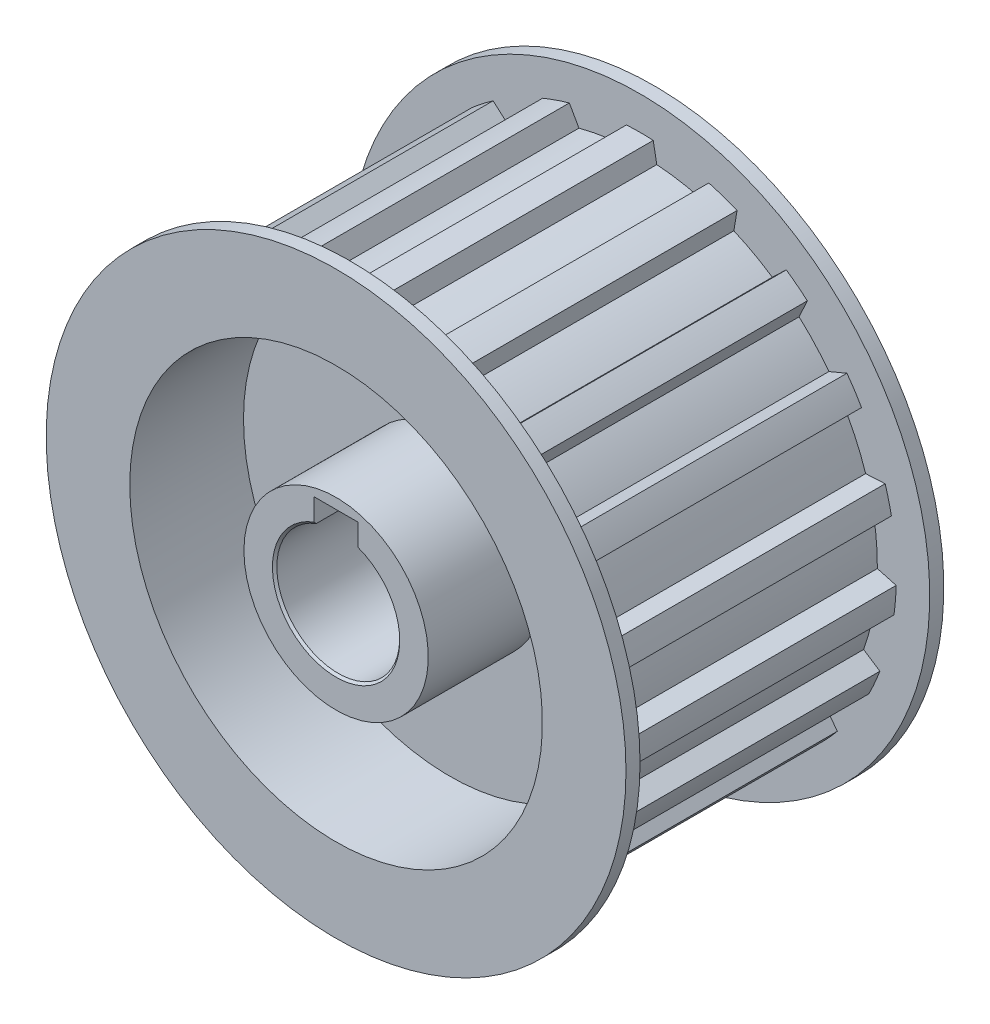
ISO-10303-21;
HEADER;
FILE_DESCRIPTION(('STEP AP214'),'2;1');
FILE_NAME('part.step','',(''),(''),'','','');
FILE_SCHEMA(('AUTOMOTIVE_DESIGN { 1 0 10303 214 1 1 1 1 }'));
ENDSEC;
DATA;
#1=APPLICATION_CONTEXT('core data for automotive mechanical design processes');
#2=APPLICATION_PROTOCOL_DEFINITION('international standard','automotive_design',2000,#1);
#3=PRODUCT_CONTEXT('',#1,'mechanical');
#4=PRODUCT('Part','Part','',(#3));
#5=PRODUCT_RELATED_PRODUCT_CATEGORY('part','',(#4));
#6=PRODUCT_DEFINITION_FORMATION('','',#4);
#7=PRODUCT_DEFINITION_CONTEXT('part definition',#1,'design');
#8=PRODUCT_DEFINITION('design','',#6,#7);
#9=PRODUCT_DEFINITION_SHAPE('','',#8);
#10=(LENGTH_UNIT() NAMED_UNIT(*) SI_UNIT(.MILLI.,.METRE.));
#11=(NAMED_UNIT(*) PLANE_ANGLE_UNIT() SI_UNIT($,.RADIAN.));
#12=(NAMED_UNIT(*) SI_UNIT($,.STERADIAN.) SOLID_ANGLE_UNIT());
#13=UNCERTAINTY_MEASURE_WITH_UNIT(LENGTH_MEASURE(1.E-05),#10,'distance_accuracy_value','');
#14=(GEOMETRIC_REPRESENTATION_CONTEXT(3) GLOBAL_UNCERTAINTY_ASSIGNED_CONTEXT((#13)) GLOBAL_UNIT_ASSIGNED_CONTEXT((#10,
#11,#12)) REPRESENTATION_CONTEXT('',''));
#15=CARTESIAN_POINT('',(0.,0.,0.));
#16=DIRECTION('',(0.,0.,1.));
#17=DIRECTION('',(1.,0.,0.));
#18=AXIS2_PLACEMENT_3D('',#15,#16,#17);
#19=CARTESIAN_POINT('',(0.,0.,-18.1));
#20=DIRECTION('',(0.,0.,1.));
#21=DIRECTION('',(1.,0.,0.));
#22=AXIS2_PLACEMENT_3D('',#19,#20,#21);
#23=CYLINDRICAL_SURFACE('',#22,23.5);
#24=CARTESIAN_POINT('',(0.,0.,-18.1));
#25=DIRECTION('',(0.,0.,1.));
#26=DIRECTION('',(1.,0.,0.));
#27=AXIS2_PLACEMENT_3D('',#24,#25,#26);
#28=CIRCLE('',#27,23.5);
#29=CARTESIAN_POINT('',(23.5,0.,-18.1));
#30=VERTEX_POINT('',#29);
#31=EDGE_CURVE('E1734',#30,#30,#28,.F.);
#32=ORIENTED_EDGE('',*,*,#31,.T.);
#33=EDGE_LOOP('',(#32));
#34=FACE_BOUND('',#33,.T.);
#35=CARTESIAN_POINT('',(0.,0.,-5.146));
#36=DIRECTION('',(0.,0.,1.));
#37=DIRECTION('',(1.,0.,0.));
#38=AXIS2_PLACEMENT_3D('',#35,#36,#37);
#39=CIRCLE('',#38,23.5);
#40=CARTESIAN_POINT('',(23.5,0.,-5.146));
#41=VERTEX_POINT('',#40);
#42=EDGE_CURVE('E19',#41,#41,#39,.T.);
#43=ORIENTED_EDGE('',*,*,#42,.T.);
#44=EDGE_LOOP('',(#43));
#45=FACE_BOUND('',#44,.T.);
#46=ADVANCED_FACE('F15',(#34,#45),#23,.F.);
#47=CARTESIAN_POINT('',(23.97,23.97,-5.146));
#48=DIRECTION('',(0.,0.,1.));
#49=DIRECTION('',(-1.,0.,0.));
#50=AXIS2_PLACEMENT_3D('',#47,#48,#49);
#51=PLANE('',#50);
#52=CARTESIAN_POINT('',(0.,0.,-5.146));
#53=DIRECTION('',(0.,0.,1.));
#54=DIRECTION('',(1.,0.,0.));
#55=AXIS2_PLACEMENT_3D('',#52,#53,#54);
#56=CIRCLE('',#55,10.5);
#57=CARTESIAN_POINT('',(10.5,0.,-5.146));
#58=VERTEX_POINT('',#57);
#59=EDGE_CURVE('E1732',#58,#58,#56,.F.);
#60=ORIENTED_EDGE('',*,*,#59,.F.);
#61=EDGE_LOOP('',(#60));
#62=FACE_BOUND('',#61,.T.);
#63=ORIENTED_EDGE('',*,*,#42,.F.);
#64=EDGE_LOOP('',(#63));
#65=FACE_BOUND('',#64,.T.);
#66=ADVANCED_FACE('F1697',(#62,#65),#51,.F.);
#67=CARTESIAN_POINT('',(33.6804,33.6804,-18.1));
#68=DIRECTION('',(0.,0.,1.));
#69=DIRECTION('',(-1.,0.,0.));
#70=AXIS2_PLACEMENT_3D('',#67,#68,#69);
#71=PLANE('',#70);
#72=ORIENTED_EDGE('',*,*,#31,.F.);
#73=EDGE_LOOP('',(#72));
#74=FACE_BOUND('',#73,.T.);
#75=CARTESIAN_POINT('',(0.,0.,-18.1));
#76=DIRECTION('',(0.,0.,-1.));
#77=DIRECTION('',(-1.,0.,0.));
#78=AXIS2_PLACEMENT_3D('',#75,#76,#77);
#79=CIRCLE('',#78,33.02);
#80=CARTESIAN_POINT('',(-33.02,0.,-18.1));
#81=VERTEX_POINT('',#80);
#82=EDGE_CURVE('E1742',#81,#81,#79,.F.);
#83=ORIENTED_EDGE('',*,*,#82,.F.);
#84=EDGE_LOOP('',(#83));
#85=FACE_BOUND('',#84,.T.);
#86=ADVANCED_FACE('F1689',(#74,#85),#71,.F.);
#87=CARTESIAN_POINT('',(0.,0.,-18.1));
#88=DIRECTION('',(0.,0.,1.));
#89=DIRECTION('',(1.,0.,0.));
#90=AXIS2_PLACEMENT_3D('',#87,#88,#89);
#91=CYLINDRICAL_SURFACE('',#90,10.5);
#92=CARTESIAN_POINT('',(0.,0.,-18.1));
#93=DIRECTION('',(0.,0.,1.));
#94=DIRECTION('',(1.,0.,0.));
#95=AXIS2_PLACEMENT_3D('',#92,#93,#94);
#96=CIRCLE('',#95,10.5);
#97=CARTESIAN_POINT('',(10.5,0.,-18.1));
#98=VERTEX_POINT('',#97);
#99=EDGE_CURVE('E1744',#98,#98,#96,.T.);
#100=ORIENTED_EDGE('',*,*,#99,.T.);
#101=EDGE_LOOP('',(#100));
#102=FACE_BOUND('',#101,.T.);
#103=ORIENTED_EDGE('',*,*,#59,.T.);
#104=EDGE_LOOP('',(#103));
#105=FACE_BOUND('',#104,.T.);
#106=ADVANCED_FACE('F1682',(#102,#105),#91,.T.);
#107=CARTESIAN_POINT('',(0.,0.,-18.1000000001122));
#108=DIRECTION('',(0.,0.,-1.));
#109=DIRECTION('',(-1.,0.,0.));
#110=AXIS2_PLACEMENT_3D('',#107,#108,#109);
#111=CONICAL_SURFACE('',#110,7.24999999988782,0.785398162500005);
#112=CARTESIAN_POINT('',(0.,0.,-18.1000000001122));
#113=DIRECTION('',(0.,0.,-1.));
#114=DIRECTION('',(-1.,0.,0.));
#115=AXIS2_PLACEMENT_3D('',#112,#113,#114);
#116=CIRCLE('',#115,7.24999999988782);
#117=CARTESIAN_POINT('',(2.49999999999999,6.80532879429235,-18.1000000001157));
#118=VERTEX_POINT('',#117);
#119=CARTESIAN_POINT('',(-2.50000000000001,6.80532879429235,-18.1000000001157));
#120=VERTEX_POINT('',#119);
#121=EDGE_CURVE('E731',#118,#120,#116,.T.);
#122=ORIENTED_EDGE('',*,*,#121,.T.);
#123=CARTESIAN_POINT('',(-2.4999999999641,6.53834841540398,-17.8499999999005));
#124=CARTESIAN_POINT('',(-2.49999999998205,6.58289637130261,-17.8916119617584));
#125=CARTESIAN_POINT('',(-2.49999999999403,6.62741871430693,-17.9332512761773));
#126=CARTESIAN_POINT('',(-2.500000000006,6.71641217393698,-18.0165846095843));
#127=CARTESIAN_POINT('',(-2.500000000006,6.76088329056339,-18.0582786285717));
#128=CARTESIAN_POINT('',(-2.50000000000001,6.80532879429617,-18.1000000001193));
#129=B_SPLINE_CURVE_WITH_KNOTS('',3,(#123,#124,#125,#126,#127,#128),.UNSPECIFIED.,.F.,.F.,(4,2,
4),(0.,0.182878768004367,0.365757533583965),.UNSPECIFIED.);
#130=CARTESIAN_POINT('',(-2.50000000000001,6.53834841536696,-17.8499999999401));
#131=VERTEX_POINT('',#130);
#132=EDGE_CURVE('E516',#131,#120,#129,.T.);
#133=ORIENTED_EDGE('',*,*,#132,.F.);
#134=CARTESIAN_POINT('',(0.,0.,-17.85));
#135=DIRECTION('',(0.,0.,-1.));
#136=DIRECTION('',(-1.,0.,0.));
#137=AXIS2_PLACEMENT_3D('',#134,#135,#136);
#138=CIRCLE('',#137,7.);
#139=CARTESIAN_POINT('',(2.49999999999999,6.53834841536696,-17.8499999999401));
#140=VERTEX_POINT('',#139);
#141=EDGE_CURVE('E728',#131,#140,#138,.F.);
#142=ORIENTED_EDGE('',*,*,#141,.T.);
#143=CARTESIAN_POINT('',(2.50000000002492,6.80532879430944,-18.1000000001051));
#144=CARTESIAN_POINT('',(2.50000000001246,6.76088329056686,-18.058278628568));
#145=CARTESIAN_POINT('',(2.50000000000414,6.71641217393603,-18.0165846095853));
#146=CARTESIAN_POINT('',(2.49999999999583,6.62741871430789,-17.9332512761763));
#147=CARTESIAN_POINT('',(2.49999999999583,6.5828963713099,-17.8916119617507));
#148=CARTESIAN_POINT('',(2.49999999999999,6.53834841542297,-17.8499999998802));
#149=B_SPLINE_CURVE_WITH_KNOTS('',3,(#143,#144,#145,#146,#147,#148),.UNSPECIFIED.,.F.,.F.,(4,2,
4),(0.,0.182878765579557,0.36575753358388),.UNSPECIFIED.);
#150=EDGE_CURVE('E1722',#118,#140,#149,.T.);
#151=ORIENTED_EDGE('',*,*,#150,.F.);
#152=EDGE_LOOP('',(#122,#133,#142,#151));
#153=FACE_BOUND('',#152,.T.);
#154=ADVANCED_FACE('F1674',(#153),#111,.F.);
#155=CARTESIAN_POINT('',(0.,0.,-16.5));
#156=DIRECTION('',(0.,0.,-1.));
#157=DIRECTION('',(-1.,0.,0.));
#158=AXIS2_PLACEMENT_3D('',#155,#156,#157);
#159=CYLINDRICAL_SURFACE('',#158,33.02);
#160=CARTESIAN_POINT('',(0.,0.,-16.5));
#161=DIRECTION('',(0.,0.,-1.));
#162=DIRECTION('',(-1.,0.,0.));
#163=AXIS2_PLACEMENT_3D('',#160,#161,#162);
#164=CIRCLE('',#163,33.02);
#165=CARTESIAN_POINT('',(-33.02,0.,-16.5));
#166=VERTEX_POINT('',#165);
#167=EDGE_CURVE('E730',#166,#166,#164,.F.);
#168=ORIENTED_EDGE('',*,*,#167,.F.);
#169=EDGE_LOOP('',(#168));
#170=FACE_BOUND('',#169,.T.);
#171=ORIENTED_EDGE('',*,*,#82,.T.);
#172=EDGE_LOOP('',(#171));
#173=FACE_BOUND('',#172,.T.);
#174=ADVANCED_FACE('F1668',(#170,#173),#159,.T.);
#175=CARTESIAN_POINT('',(10.71,10.71,-18.1));
#176=DIRECTION('',(0.,0.,1.));
#177=DIRECTION('',(-1.,0.,0.));
#178=AXIS2_PLACEMENT_3D('',#175,#176,#177);
#179=PLANE('',#178);
#180=DIRECTION('',(0.,1.,0.));
#181=VECTOR('',#180,1.);
#182=CARTESIAN_POINT('',(2.49999999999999,6.538348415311,-18.1));
#183=LINE('',#182,#181);
#184=CARTESIAN_POINT('',(2.49999999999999,9.29999999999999,-18.1));
#185=VERTEX_POINT('',#184);
#186=EDGE_CURVE('E524',#118,#185,#183,.T.);
#187=ORIENTED_EDGE('',*,*,#186,.T.);
#188=DIRECTION('',(1.,0.,0.));
#189=VECTOR('',#188,1.);
#190=CARTESIAN_POINT('',(2.49999999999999,9.29999999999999,-18.1));
#191=LINE('',#190,#189);
#192=CARTESIAN_POINT('',(-2.50000000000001,9.29999999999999,-18.1));
#193=VERTEX_POINT('',#192);
#194=EDGE_CURVE('E565',#185,#193,#191,.F.);
#195=ORIENTED_EDGE('',*,*,#194,.T.);
#196=DIRECTION('',(0.,1.,0.));
#197=VECTOR('',#196,1.);
#198=CARTESIAN_POINT('',(-2.50000000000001,9.29999999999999,-18.1));
#199=LINE('',#198,#197);
#200=EDGE_CURVE('E540',#193,#120,#199,.F.);
#201=ORIENTED_EDGE('',*,*,#200,.T.);
#202=ORIENTED_EDGE('',*,*,#121,.F.);
#203=EDGE_LOOP('',(#187,#195,#201,#202));
#204=FACE_BOUND('',#203,.T.);
#205=ORIENTED_EDGE('',*,*,#99,.F.);
#206=EDGE_LOOP('',(#205));
#207=FACE_BOUND('',#206,.T.);
#208=ADVANCED_FACE('F1660',(#204,#207),#179,.F.);
#209=CARTESIAN_POINT('',(0.,0.,18.1));
#210=DIRECTION('',(0.,0.,-1.));
#211=DIRECTION('',(-1.,0.,0.));
#212=AXIS2_PLACEMENT_3D('',#209,#210,#211);
#213=CYLINDRICAL_SURFACE('',#212,7.);
#214=DIRECTION('',(0.,0.,1.));
#215=VECTOR('',#214,1.);
#216=CARTESIAN_POINT('',(-2.50000000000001,6.538348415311,18.1));
#217=LINE('',#216,#215);
#218=CARTESIAN_POINT('',(-2.50000000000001,6.53834841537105,17.8499999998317));
#219=VERTEX_POINT('',#218);
#220=EDGE_CURVE('E543',#131,#219,#217,.T.);
#221=ORIENTED_EDGE('',*,*,#220,.T.);
#222=CARTESIAN_POINT('',(0.,0.,17.8499999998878));
#223=DIRECTION('',(0.,0.,1.));
#224=DIRECTION('',(0.357142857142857,-0.934049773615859,0.));
#225=AXIS2_PLACEMENT_3D('',#222,#223,#224);
#226=CIRCLE('',#225,7.00000000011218);
#227=CARTESIAN_POINT('',(2.49999999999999,6.53834841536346,17.8499999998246));
#228=VERTEX_POINT('',#227);
#229=EDGE_CURVE('E720',#219,#228,#226,.T.);
#230=ORIENTED_EDGE('',*,*,#229,.T.);
#231=DIRECTION('',(0.,0.,-1.));
#232=VECTOR('',#231,1.);
#233=CARTESIAN_POINT('',(2.49999999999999,6.538348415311,18.1));
#234=LINE('',#233,#232);
#235=EDGE_CURVE('E566',#228,#140,#234,.T.);
#236=ORIENTED_EDGE('',*,*,#235,.T.);
#237=ORIENTED_EDGE('',*,*,#141,.F.);
#238=EDGE_LOOP('',(#221,#230,#236,#237));
#239=FACE_BOUND('',#238,.T.);
#240=ADVANCED_FACE('F1653',(#239),#213,.F.);
#241=CARTESIAN_POINT('',(33.6804,33.6804,-16.5));
#242=DIRECTION('',(0.,0.,1.));
#243=DIRECTION('',(-1.,0.,0.));
#244=AXIS2_PLACEMENT_3D('',#241,#242,#243);
#245=PLANE('',#244);
#246=CARTESIAN_POINT('',(0.,0.,-16.5));
#247=DIRECTION('',(0.,0.,1.));
#248=DIRECTION('',(1.,0.,0.));
#249=AXIS2_PLACEMENT_3D('',#246,#247,#248);
#250=CIRCLE('',#249,27.0509993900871);
#251=CARTESIAN_POINT('',(-1.92741928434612,26.9822464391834,-16.5));
#252=VERTEX_POINT('',#251);
#253=CARTESIAN_POINT('',(-6.93813470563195,26.1461059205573,-16.5));
#254=VERTEX_POINT('',#253);
#255=EDGE_CURVE('E933',#252,#254,#250,.T.);
#256=ORIENTED_EDGE('',*,*,#255,.F.);
#257=DIRECTION('',(-0.181324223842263,-0.983423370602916,0.));
#258=VECTOR('',#257,1.);
#259=CARTESIAN_POINT('',(-1.92741928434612,26.9822464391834,-16.5));
#260=LINE('',#259,#258);
#261=CARTESIAN_POINT('',(-1.524,29.1702163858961,-16.5));
#262=VERTEX_POINT('',#261);
#263=EDGE_CURVE('E714',#262,#252,#260,.T.);
#264=ORIENTED_EDGE('',*,*,#263,.F.);
#265=CARTESIAN_POINT('',(0.,0.,-16.5));
#266=DIRECTION('',(0.,0.,1.));
#267=DIRECTION('',(1.,0.,0.));
#268=AXIS2_PLACEMENT_3D('',#265,#266,#267);
#269=CIRCLE('',#268,29.21);
#270=CARTESIAN_POINT('',(1.524,29.1702163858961,-16.5));
#271=VERTEX_POINT('',#270);
#272=EDGE_CURVE('E935',#271,#262,#269,.T.);
#273=ORIENTED_EDGE('',*,*,#272,.F.);
#274=DIRECTION('',(-0.181324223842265,0.983423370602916,0.));
#275=VECTOR('',#274,1.);
#276=CARTESIAN_POINT('',(1.524,29.1702163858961,-16.5));
#277=LINE('',#276,#275);
#278=CARTESIAN_POINT('',(1.92741928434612,26.9822464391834,-16.5));
#279=VERTEX_POINT('',#278);
#280=EDGE_CURVE('E567',#279,#271,#277,.T.);
#281=ORIENTED_EDGE('',*,*,#280,.F.);
#282=CARTESIAN_POINT('',(0.,0.,-16.5));
#283=DIRECTION('',(0.,0.,1.));
#284=DIRECTION('',(1.,0.,0.));
#285=AXIS2_PLACEMENT_3D('',#282,#283,#284);
#286=CIRCLE('',#285,27.0509993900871);
#287=CARTESIAN_POINT('',(6.93813470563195,26.1461059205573,-16.5));
#288=VERTEX_POINT('',#287);
#289=EDGE_CURVE('E861',#288,#279,#286,.T.);
#290=ORIENTED_EDGE('',*,*,#289,.F.);
#291=DIRECTION('',(-0.417295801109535,-0.908770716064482,0.));
#292=VECTOR('',#291,1.);
#293=CARTESIAN_POINT('',(6.93813470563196,26.1461059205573,-16.5));
#294=LINE('',#293,#292);
#295=CARTESIAN_POINT('',(7.85141826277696,28.1350196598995,-16.5));
#296=VERTEX_POINT('',#295);
#297=EDGE_CURVE('E570',#296,#288,#294,.T.);
#298=ORIENTED_EDGE('',*,*,#297,.F.);
#299=CARTESIAN_POINT('',(0.,0.,-16.5));
#300=DIRECTION('',(0.,0.,1.));
#301=DIRECTION('',(1.,0.,0.));
#302=AXIS2_PLACEMENT_3D('',#299,#300,#301);
#303=CIRCLE('',#302,29.21);
#304=CARTESIAN_POINT('',(11.0725078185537,27.0300512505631,-16.5));
#305=VERTEX_POINT('',#304);
#306=EDGE_CURVE('E863',#305,#296,#303,.T.);
#307=ORIENTED_EDGE('',*,*,#306,.F.);
#308=DIRECTION('',(0.164594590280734,0.986361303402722,0.));
#309=VECTOR('',#308,1.);
#310=CARTESIAN_POINT('',(11.0725078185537,27.0300512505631,-16.5));
#311=LINE('',#310,#309);
#312=CARTESIAN_POINT('',(10.7073348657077,24.8416897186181,-16.5));
#313=VERTEX_POINT('',#312);
#314=EDGE_CURVE('E574',#313,#305,#311,.T.);
#315=ORIENTED_EDGE('',*,*,#314,.F.);
#316=CARTESIAN_POINT('',(0.,0.,-16.5));
#317=DIRECTION('',(0.,0.,1.));
#318=DIRECTION('',(1.,0.,0.));
#319=AXIS2_PLACEMENT_3D('',#316,#317,#318);
#320=CIRCLE('',#319,27.0509993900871);
#321=CARTESIAN_POINT('',(15.0844039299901,22.4547840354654,-16.5));
#322=VERTEX_POINT('',#321);
#323=EDGE_CURVE('E865',#322,#313,#320,.T.);
#324=ORIENTED_EDGE('',*,*,#323,.F.);
#325=DIRECTION('',(-0.724166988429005,-0.689624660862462,0.));
#326=VECTOR('',#325,1.);
#327=CARTESIAN_POINT('',(15.0844039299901,22.4547840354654,-16.5));
#328=LINE('',#327,#326);
#329=CARTESIAN_POINT('',(16.6829866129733,23.9771152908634,-16.5));
#330=VERTEX_POINT('',#329);
#331=EDGE_CURVE('E578',#330,#322,#328,.T.);
#332=ORIENTED_EDGE('',*,*,#331,.F.);
#333=CARTESIAN_POINT('',(0.,0.,-16.5));
#334=DIRECTION('',(0.,0.,1.));
#335=DIRECTION('',(1.,0.,0.));
#336=AXIS2_PLACEMENT_3D('',#333,#334,#335);
#337=CIRCLE('',#336,29.21);
#338=CARTESIAN_POINT('',(19.07738962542,22.1196135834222,-16.5));
#339=VERTEX_POINT('',#338);
#340=EDGE_CURVE('E867',#339,#330,#337,.T.);
#341=ORIENTED_EDGE('',*,*,#340,.F.);
#342=DIRECTION('',(0.417295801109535,0.908770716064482,0.));
#343=VECTOR('',#342,1.);
#344=CARTESIAN_POINT('',(19.07738962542,22.1196135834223,-16.5));
#345=LINE('',#344,#343);
#346=CARTESIAN_POINT('',(18.1364655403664,20.0705053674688,-16.5));
#347=VERTEX_POINT('',#346);
#348=EDGE_CURVE('E582',#347,#339,#345,.T.);
#349=ORIENTED_EDGE('',*,*,#348,.F.);
#350=CARTESIAN_POINT('',(0.,0.,-16.5));
#351=DIRECTION('',(0.,0.,1.));
#352=DIRECTION('',(1.,0.,0.));
#353=AXIS2_PLACEMENT_3D('',#350,#351,#352);
#354=CIRCLE('',#353,27.0509993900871);
#355=CARTESIAN_POINT('',(21.5344337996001,16.3714608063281,-16.5));
#356=VERTEX_POINT('',#355);
#357=EDGE_CURVE('E869',#356,#347,#354,.T.);
#358=ORIENTED_EDGE('',*,*,#357,.F.);
#359=DIRECTION('',(-0.922464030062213,-0.3860830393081,0.));
#360=VECTOR('',#359,1.);
#361=CARTESIAN_POINT('',(21.5344337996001,16.3714608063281,-16.5));
#362=LINE('',#361,#360);
#363=CARTESIAN_POINT('',(23.5867783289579,17.2304378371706,-16.5));
#364=VERTEX_POINT('',#363);
#365=EDGE_CURVE('E586',#364,#356,#362,.T.);
#366=ORIENTED_EDGE('',*,*,#365,.F.);
#367=CARTESIAN_POINT('',(0.,0.,-16.5));
#368=DIRECTION('',(0.,0.,1.));
#369=DIRECTION('',(1.,0.,0.));
#370=AXIS2_PLACEMENT_3D('',#367,#368,#369);
#371=CIRCLE('',#370,29.21);
#372=CARTESIAN_POINT('',(25.2542665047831,14.6780830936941,-16.5));
#373=VERTEX_POINT('',#372);
#374=EDGE_CURVE('E871',#373,#364,#371,.T.);
#375=ORIENTED_EDGE('',*,*,#374,.F.);
#376=DIRECTION('',(0.724166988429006,0.689624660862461,0.));
#377=VECTOR('',#376,1.);
#378=CARTESIAN_POINT('',(25.2542665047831,14.6780830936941,-16.5));
#379=LINE('',#378,#377);
#380=CARTESIAN_POINT('',(23.6431241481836,13.1437912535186,-16.5));
#381=VERTEX_POINT('',#380);
#382=EDGE_CURVE('E590',#381,#373,#379,.T.);
#383=ORIENTED_EDGE('',*,*,#382,.F.);
#384=CARTESIAN_POINT('',(0.,0.,-16.5));
#385=DIRECTION('',(0.,0.,1.));
#386=DIRECTION('',(1.,0.,0.));
#387=AXIS2_PLACEMENT_3D('',#384,#385,#386);
#388=CIRCLE('',#387,27.0509993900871);
#389=CARTESIAN_POINT('',(25.7165817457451,8.39130450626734,-16.5));
#390=VERTEX_POINT('',#389);
#391=EDGE_CURVE('E873',#390,#381,#388,.T.);
#392=ORIENTED_EDGE('',*,*,#391,.F.);
#393=DIRECTION('',(-0.998638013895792,-0.052173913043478,0.));
#394=VECTOR('',#393,1.);
#395=CARTESIAN_POINT('',(25.7165817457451,8.39130450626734,-16.5));
#396=LINE('',#395,#394);
#397=CARTESIAN_POINT('',(27.9435845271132,8.50765442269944,-16.5));
#398=VERTEX_POINT('',#397);
#399=EDGE_CURVE('E594',#398,#390,#396,.T.);
#400=ORIENTED_EDGE('',*,*,#399,.F.);
#401=CARTESIAN_POINT('',(0.,0.,-16.5));
#402=DIRECTION('',(0.,0.,1.));
#403=DIRECTION('',(1.,0.,0.));
#404=AXIS2_PLACEMENT_3D('',#401,#402,#403);
#405=CIRCLE('',#404,29.21);
#406=CARTESIAN_POINT('',(28.651735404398,5.68349877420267,-16.5));
#407=VERTEX_POINT('',#406);
#408=EDGE_CURVE('E875',#407,#398,#405,.T.);
#409=ORIENTED_EDGE('',*,*,#408,.F.);
#410=DIRECTION('',(0.908818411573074,0.417191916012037,0.));
#411=VECTOR('',#410,1.);
#412=CARTESIAN_POINT('',(28.651735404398,5.68349877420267,-16.5));
#413=LINE('',#412,#411);
#414=CARTESIAN_POINT('',(26.6297503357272,4.7553091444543,-16.5));
#415=VERTEX_POINT('',#414);
#416=EDGE_CURVE('E598',#415,#407,#413,.T.);
#417=ORIENTED_EDGE('',*,*,#416,.F.);
#418=CARTESIAN_POINT('',(0.,0.,-16.5));
#419=DIRECTION('',(0.,0.,1.));
#420=DIRECTION('',(1.,0.,0.));
#421=AXIS2_PLACEMENT_3D('',#418,#419,#420);
#422=CIRCLE('',#421,27.0509993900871);
#423=CARTESIAN_POINT('',(27.0492602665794,-0.306736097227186,-16.5));
#424=VERTEX_POINT('',#423);
#425=EDGE_CURVE('E877',#424,#415,#422,.T.);
#426=ORIENTED_EDGE('',*,*,#425,.F.);
#427=DIRECTION('',(-0.965110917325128,0.261841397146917,0.));
#428=VECTOR('',#427,1.);
#429=CARTESIAN_POINT('',(27.0492602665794,-0.306736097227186,-16.5));
#430=LINE('',#429,#428);
#431=CARTESIAN_POINT('',(29.1964598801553,-0.889286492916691,-16.5));
#432=VERTEX_POINT('',#431);
#433=EDGE_CURVE('E602',#432,#424,#430,.T.);
#434=ORIENTED_EDGE('',*,*,#433,.F.);
#435=CARTESIAN_POINT('',(0.,0.,-16.5));
#436=DIRECTION('',(0.,0.,1.));
#437=DIRECTION('',(1.,0.,0.));
#438=AXIS2_PLACEMENT_3D('',#435,#436,#437);
#439=CIRCLE('',#438,29.21);
#440=CARTESIAN_POINT('',(28.9447343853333,-3.92765214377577,-16.5));
#441=VERTEX_POINT('',#440);
#442=EDGE_CURVE('E879',#441,#432,#439,.T.);
#443=ORIENTED_EDGE('',*,*,#442,.F.);
#444=DIRECTION('',(0.997458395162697,0.071251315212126,0.));
#445=VECTOR('',#444,1.);
#446=CARTESIAN_POINT('',(28.9447343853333,-3.92765214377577,-16.5));
#447=LINE('',#446,#445);
#448=CARTESIAN_POINT('',(26.7407671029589,-4.08508785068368,-16.5));
#449=VERTEX_POINT('',#448);
#450=EDGE_CURVE('E606',#449,#441,#447,.T.);
#451=ORIENTED_EDGE('',*,*,#450,.F.);
#452=CARTESIAN_POINT('',(0.,0.,-16.5));
#453=DIRECTION('',(0.,0.,1.));
#454=DIRECTION('',(1.,0.,0.));
#455=AXIS2_PLACEMENT_3D('',#452,#453,#454);
#456=CIRCLE('',#455,27.0509993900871);
#457=CARTESIAN_POINT('',(25.4838570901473,-9.07356577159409,-16.5));
#458=VERTEX_POINT('',#457);
#459=EDGE_CURVE('E881',#458,#449,#456,.T.);
#460=ORIENTED_EDGE('',*,*,#459,.F.);
#461=DIRECTION('',(-0.836967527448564,0.547252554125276,0.));
#462=VECTOR('',#461,1.);
#463=CARTESIAN_POINT('',(25.4838570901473,-9.0735657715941,-16.5));
#464=LINE('',#463,#462);
#465=CARTESIAN_POINT('',(27.3388530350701,-10.2864578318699,-16.5));
#466=VERTEX_POINT('',#465);
#467=EDGE_CURVE('E610',#466,#458,#464,.T.);
#468=ORIENTED_EDGE('',*,*,#467,.F.);
#469=CARTESIAN_POINT('',(0.,0.,-16.5));
#470=DIRECTION('',(0.,0.,1.));
#471=DIRECTION('',(1.,0.,0.));
#472=AXIS2_PLACEMENT_3D('',#469,#470,#471);
#473=CIRCLE('',#472,29.21);
#474=CARTESIAN_POINT('',(26.084094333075,-13.1470195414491,-16.5));
#475=VERTEX_POINT('',#474);
#476=EDGE_CURVE('E883',#475,#466,#473,.T.);
#477=ORIENTED_EDGE('',*,*,#476,.F.);
#478=DIRECTION('',(0.965110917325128,-0.261841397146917,0.));
#479=VECTOR('',#478,1.);
#480=CARTESIAN_POINT('',(26.084094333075,-13.1470195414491,-16.5));
#481=LINE('',#480,#479);
#482=CARTESIAN_POINT('',(23.9536332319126,-12.5690104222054,-16.5));
#483=VERTEX_POINT('',#482);
#484=EDGE_CURVE('E614',#483,#475,#481,.T.);
#485=ORIENTED_EDGE('',*,*,#484,.F.);
#486=CARTESIAN_POINT('',(0.,0.,-16.5));
#487=DIRECTION('',(0.,0.,1.));
#488=DIRECTION('',(1.,0.,0.));
#489=AXIS2_PLACEMENT_3D('',#486,#487,#488);
#490=CIRCLE('',#489,27.0509993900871);
#491=CARTESIAN_POINT('',(21.1568894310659,-16.8565298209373,-16.5));
#492=VERTEX_POINT('',#491);
#493=EDGE_CURVE('E885',#492,#483,#490,.T.);
#494=ORIENTED_EDGE('',*,*,#493,.F.);
#495=DIRECTION('',(-0.600720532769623,0.799459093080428,0.));
#496=VECTOR('',#495,1.);
#497=CARTESIAN_POINT('',(21.1568894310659,-16.8565298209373,-16.5));
#498=LINE('',#497,#496);
#499=CARTESIAN_POINT('',(22.4934027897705,-18.6352067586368,-16.5));
#500=VERTEX_POINT('',#499);
#501=EDGE_CURVE('E618',#500,#492,#498,.T.);
#502=ORIENTED_EDGE('',*,*,#501,.F.);
#503=CARTESIAN_POINT('',(0.,0.,-16.5));
#504=DIRECTION('',(0.,0.,1.));
#505=DIRECTION('',(1.,0.,0.));
#506=AXIS2_PLACEMENT_3D('',#503,#504,#505);
#507=CIRCLE('',#506,29.21);
#508=CARTESIAN_POINT('',(20.4290485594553,-20.8776932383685,-16.5));
#509=VERTEX_POINT('',#508);
#510=EDGE_CURVE('E887',#509,#500,#507,.T.);
#511=ORIENTED_EDGE('',*,*,#510,.F.);
#512=DIRECTION('',(0.846335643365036,-0.532649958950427,0.));
#513=VECTOR('',#512,1.);
#514=CARTESIAN_POINT('',(20.4290485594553,-20.8776932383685,-16.5));
#515=LINE('',#514,#513);
#516=CARTESIAN_POINT('',(18.5460783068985,-19.6926267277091,-16.5));
#517=VERTEX_POINT('',#516);
#518=EDGE_CURVE('E622',#517,#509,#515,.T.);
#519=ORIENTED_EDGE('',*,*,#518,.F.);
#520=CARTESIAN_POINT('',(0.,0.,-16.5));
#521=DIRECTION('',(0.,0.,1.));
#522=DIRECTION('',(1.,0.,0.));
#523=AXIS2_PLACEMENT_3D('',#520,#521,#522);
#524=CIRCLE('',#523,27.0509993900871);
#525=CARTESIAN_POINT('',(14.5372445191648,-22.8128273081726,-16.5));
#526=VERTEX_POINT('',#525);
#527=EDGE_CURVE('E889',#526,#517,#524,.T.);
#528=ORIENTED_EDGE('',*,*,#527,.F.);
#529=DIRECTION('',(-0.308587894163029,0.951195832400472,0.));
#530=VECTOR('',#529,1.);
#531=CARTESIAN_POINT('',(14.5372445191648,-22.8128273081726,-16.5));
#532=LINE('',#531,#530);
#533=CARTESIAN_POINT('',(15.2238064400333,-24.9290958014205,-16.5));
#534=VERTEX_POINT('',#533);
#535=EDGE_CURVE('E626',#534,#526,#532,.T.);
#536=ORIENTED_EDGE('',*,*,#535,.F.);
#537=CARTESIAN_POINT('',(0.,0.,-16.5));
#538=DIRECTION('',(0.,0.,1.));
#539=DIRECTION('',(1.,0.,0.));
#540=AXIS2_PLACEMENT_3D('',#537,#538,#539);
#541=CIRCLE('',#540,29.21);
#542=CARTESIAN_POINT('',(12.5431704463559,-26.3797834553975,-16.5));
#543=VERTEX_POINT('',#542);
#544=EDGE_CURVE('E891',#543,#534,#541,.T.);
#545=ORIENTED_EDGE('',*,*,#544,.F.);
#546=DIRECTION('',(0.627527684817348,-0.778594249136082,0.));
#547=VECTOR('',#546,1.);
#548=CARTESIAN_POINT('',(12.5431704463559,-26.3797834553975,-16.5));
#549=LINE('',#548,#547);
#550=CARTESIAN_POINT('',(11.1470151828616,-24.6475276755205,-16.5));
#551=VERTEX_POINT('',#550);
#552=EDGE_CURVE('E630',#551,#543,#549,.T.);
#553=ORIENTED_EDGE('',*,*,#552,.F.);
#554=CARTESIAN_POINT('',(0.,0.,-16.5));
#555=DIRECTION('',(0.,0.,1.));
#556=DIRECTION('',(1.,0.,0.));
#557=AXIS2_PLACEMENT_3D('',#554,#555,#556);
#558=CIRCLE('',#557,27.0509993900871);
#559=CARTESIAN_POINT('',(6.34226359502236,-26.2970009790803,-16.5));
#560=VERTEX_POINT('',#559);
#561=EDGE_CURVE('E893',#560,#551,#558,.T.);
#562=ORIENTED_EDGE('',*,*,#561,.F.);
#563=DIRECTION('',(0.016985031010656,0.99985574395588,0.));
#564=VECTOR('',#563,1.);
#565=CARTESIAN_POINT('',(6.34226359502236,-26.2970009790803,-16.5));
#566=LINE('',#565,#564);
#567=CARTESIAN_POINT('',(6.30447444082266,-28.5215304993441,-16.5));
#568=VERTEX_POINT('',#567);
#569=EDGE_CURVE('E634',#568,#560,#566,.T.);
#570=ORIENTED_EDGE('',*,*,#569,.F.);
#571=CARTESIAN_POINT('',(0.,0.,-16.5));
#572=DIRECTION('',(0.,0.,1.));
#573=DIRECTION('',(1.,0.,0.));
#574=AXIS2_PLACEMENT_3D('',#571,#572,#573);
#575=CIRCLE('',#574,29.21);
#576=CARTESIAN_POINT('',(3.29804518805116,-29.0232148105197,-16.5));
#577=VERTEX_POINT('',#576);
#578=EDGE_CURVE('E895',#577,#568,#575,.T.);
#579=ORIENTED_EDGE('',*,*,#578,.F.);
#580=DIRECTION('',(0.340717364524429,-0.940165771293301,0.));
#581=VECTOR('',#580,1.);
#582=CARTESIAN_POINT('',(3.29804518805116,-29.0232148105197,-16.5));
#583=LINE('',#582,#581);
#584=CARTESIAN_POINT('',(2.54,-26.9314865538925,-16.5));
#585=VERTEX_POINT('',#584);
#586=EDGE_CURVE('E638',#585,#577,#583,.T.);
#587=ORIENTED_EDGE('',*,*,#586,.F.);
#588=CARTESIAN_POINT('',(0.,0.,-16.5));
#589=DIRECTION('',(0.,0.,1.));
#590=DIRECTION('',(1.,0.,0.));
#591=AXIS2_PLACEMENT_3D('',#588,#589,#590);
#592=CIRCLE('',#591,27.0509993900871);
#593=CARTESIAN_POINT('',(-2.54000000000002,-26.9314865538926,-16.5));
#594=VERTEX_POINT('',#593);
#595=EDGE_CURVE('E897',#594,#585,#592,.T.);
#596=ORIENTED_EDGE('',*,*,#595,.F.);
#597=DIRECTION('',(0.340717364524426,0.940165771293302,0.));
#598=VECTOR('',#597,1.);
#599=CARTESIAN_POINT('',(-2.54000000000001,-26.9314865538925,-16.5));
#600=LINE('',#599,#598);
#601=CARTESIAN_POINT('',(-3.29804518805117,-29.0232148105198,-16.5));
#602=VERTEX_POINT('',#601);
#603=EDGE_CURVE('E642',#602,#594,#600,.T.);
#604=ORIENTED_EDGE('',*,*,#603,.F.);
#605=CARTESIAN_POINT('',(0.,0.,-16.5));
#606=DIRECTION('',(0.,0.,1.));
#607=DIRECTION('',(1.,0.,0.));
#608=AXIS2_PLACEMENT_3D('',#605,#606,#607);
#609=CIRCLE('',#608,29.21);
#610=CARTESIAN_POINT('',(-6.30447444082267,-28.5215304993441,-16.5));
#611=VERTEX_POINT('',#610);
#612=EDGE_CURVE('E899',#611,#602,#609,.T.);
#613=ORIENTED_EDGE('',*,*,#612,.F.);
#614=DIRECTION('',(0.016985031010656,-0.99985574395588,0.));
#615=VECTOR('',#614,1.);
#616=CARTESIAN_POINT('',(-6.30447444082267,-28.5215304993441,-16.5));
#617=LINE('',#616,#615);
#618=CARTESIAN_POINT('',(-6.34226359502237,-26.2970009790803,-16.5));
#619=VERTEX_POINT('',#618);
#620=EDGE_CURVE('E646',#619,#611,#617,.T.);
#621=ORIENTED_EDGE('',*,*,#620,.F.);
#622=CARTESIAN_POINT('',(0.,0.,-16.5));
#623=DIRECTION('',(0.,0.,1.));
#624=DIRECTION('',(1.,0.,0.));
#625=AXIS2_PLACEMENT_3D('',#622,#623,#624);
#626=CIRCLE('',#625,27.0509993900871);
#627=CARTESIAN_POINT('',(-11.1827363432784,-24.6313413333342,-16.5));
#628=VERTEX_POINT('',#627);
#629=EDGE_CURVE('E901',#628,#619,#626,.T.);
#630=ORIENTED_EDGE('',*,*,#629,.F.);
#631=DIRECTION('',(0.600781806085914,0.799413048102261,0.));
#632=VECTOR('',#631,1.);
#633=CARTESIAN_POINT('',(-11.1827363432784,-24.6313413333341,-16.5));
#634=LINE('',#633,#632);
#635=CARTESIAN_POINT('',(-12.5089489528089,-26.3960280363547,-16.5));
#636=VERTEX_POINT('',#635);
#637=EDGE_CURVE('E650',#636,#628,#634,.T.);
#638=ORIENTED_EDGE('',*,*,#637,.F.);
#639=CARTESIAN_POINT('',(0.,0.,-16.5));
#640=DIRECTION('',(0.,0.,1.));
#641=DIRECTION('',(1.,0.,0.));
#642=AXIS2_PLACEMENT_3D('',#639,#640,#641);
#643=CIRCLE('',#642,29.21);
#644=CARTESIAN_POINT('',(-15.2238064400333,-24.9290958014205,-16.5));
#645=VERTEX_POINT('',#644);
#646=EDGE_CURVE('E903',#645,#636,#643,.T.);
#647=ORIENTED_EDGE('',*,*,#646,.F.);
#648=DIRECTION('',(-0.30858789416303,-0.951195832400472,0.));
#649=VECTOR('',#648,1.);
#650=CARTESIAN_POINT('',(-15.2238064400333,-24.9290958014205,-16.5));
#651=LINE('',#650,#649);
#652=CARTESIAN_POINT('',(-14.5372445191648,-22.8128273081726,-16.5));
#653=VERTEX_POINT('',#652);
#654=EDGE_CURVE('E654',#653,#645,#651,.T.);
#655=ORIENTED_EDGE('',*,*,#654,.F.);
#656=CARTESIAN_POINT('',(0.,0.,-16.5));
#657=DIRECTION('',(0.,0.,1.));
#658=DIRECTION('',(1.,0.,0.));
#659=AXIS2_PLACEMENT_3D('',#656,#657,#658);
#660=CIRCLE('',#659,27.0509993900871);
#661=CARTESIAN_POINT('',(-18.5460783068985,-19.6926267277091,-16.5));
#662=VERTEX_POINT('',#661);
#663=EDGE_CURVE('E905',#662,#653,#660,.T.);
#664=ORIENTED_EDGE('',*,*,#663,.F.);
#665=DIRECTION('',(0.846335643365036,0.532649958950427,0.));
#666=VECTOR('',#665,1.);
#667=CARTESIAN_POINT('',(-18.5460783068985,-19.6926267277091,-16.5));
#668=LINE('',#667,#666);
#669=CARTESIAN_POINT('',(-20.4290485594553,-20.8776932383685,-16.5));
#670=VERTEX_POINT('',#669);
#671=EDGE_CURVE('E658',#670,#662,#668,.T.);
#672=ORIENTED_EDGE('',*,*,#671,.F.);
#673=CARTESIAN_POINT('',(0.,0.,-16.5));
#674=DIRECTION('',(0.,0.,1.));
#675=DIRECTION('',(1.,0.,0.));
#676=AXIS2_PLACEMENT_3D('',#673,#674,#675);
#677=CIRCLE('',#676,29.21);
#678=CARTESIAN_POINT('',(-22.4938981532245,-18.6346088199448,-16.5));
#679=VERTEX_POINT('',#678);
#680=EDGE_CURVE('E907',#679,#670,#677,.T.);
#681=ORIENTED_EDGE('',*,*,#680,.F.);
#682=DIRECTION('',(-0.600781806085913,-0.799413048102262,0.));
#683=VECTOR('',#682,1.);
#684=CARTESIAN_POINT('',(-22.4938981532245,-18.6346088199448,-16.5));
#685=LINE('',#684,#683);
#686=CARTESIAN_POINT('',(-21.1572658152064,-16.8560574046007,-16.5));
#687=VERTEX_POINT('',#686);
#688=EDGE_CURVE('E662',#687,#679,#685,.T.);
#689=ORIENTED_EDGE('',*,*,#688,.F.);
#690=CARTESIAN_POINT('',(0.,0.,-16.5));
#691=DIRECTION('',(0.,0.,1.));
#692=DIRECTION('',(1.,0.,0.));
#693=AXIS2_PLACEMENT_3D('',#690,#691,#692);
#694=CIRCLE('',#693,27.0509993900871);
#695=CARTESIAN_POINT('',(-23.9353860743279,-12.6037241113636,-16.5));
#696=VERTEX_POINT('',#695);
#697=EDGE_CURVE('E909',#696,#687,#694,.T.);
#698=ORIENTED_EDGE('',*,*,#697,.F.);
#699=DIRECTION('',(0.97343000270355,0.228984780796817,0.));
#700=VECTOR('',#699,1.);
#701=CARTESIAN_POINT('',(-23.9353860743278,-12.6037241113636,-16.5));
#702=LINE('',#701,#700);
#703=CARTESIAN_POINT('',(-26.1011222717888,-13.1131810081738,-16.5));
#704=VERTEX_POINT('',#703);
#705=EDGE_CURVE('E666',#704,#696,#702,.T.);
#706=ORIENTED_EDGE('',*,*,#705,.F.);
#707=CARTESIAN_POINT('',(0.,0.,-16.5));
#708=DIRECTION('',(0.,0.,1.));
#709=DIRECTION('',(1.,0.,0.));
#710=AXIS2_PLACEMENT_3D('',#707,#708,#709);
#711=CIRCLE('',#710,29.21);
#712=CARTESIAN_POINT('',(-27.3254899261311,-10.3219039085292,-16.5));
#713=VERTEX_POINT('',#712);
#714=EDGE_CURVE('E911',#713,#704,#711,.T.);
#715=ORIENTED_EDGE('',*,*,#714,.F.);
#716=DIRECTION('',(-0.827755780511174,-0.561088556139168,0.));
#717=VECTOR('',#716,1.);
#718=CARTESIAN_POINT('',(-27.325489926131,-10.3219039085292,-16.5));
#719=LINE('',#718,#717);
#720=CARTESIAN_POINT('',(-25.4838570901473,-9.0735657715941,-16.5));
#721=VERTEX_POINT('',#720);
#722=EDGE_CURVE('E670',#721,#713,#719,.T.);
#723=ORIENTED_EDGE('',*,*,#722,.F.);
#724=CARTESIAN_POINT('',(0.,0.,-16.5));
#725=DIRECTION('',(0.,0.,1.));
#726=DIRECTION('',(1.,0.,0.));
#727=AXIS2_PLACEMENT_3D('',#724,#725,#726);
#728=CIRCLE('',#727,27.0509993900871);
#729=CARTESIAN_POINT('',(-26.7308307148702,-4.14960929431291,-16.5));
#730=VERTEX_POINT('',#729);
#731=EDGE_CURVE('E913',#730,#721,#728,.T.);
#732=ORIENTED_EDGE('',*,*,#731,.F.);
#733=DIRECTION('',(0.995045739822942,-0.099418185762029,0.));
#734=VECTOR('',#733,1.);
#735=CARTESIAN_POINT('',(-26.7308307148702,-4.14960929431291,-16.5));
#736=LINE('',#735,#734);
#737=CARTESIAN_POINT('',(-28.9446299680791,-3.9284215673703,-16.5));
#738=VERTEX_POINT('',#737);
#739=EDGE_CURVE('E674',#738,#730,#736,.T.);
#740=ORIENTED_EDGE('',*,*,#739,.F.);
#741=CARTESIAN_POINT('',(0.,0.,-16.5));
#742=DIRECTION('',(0.,0.,1.));
#743=DIRECTION('',(1.,0.,0.));
#744=AXIS2_PLACEMENT_3D('',#741,#742,#743);
#745=CIRCLE('',#744,29.21);
#746=CARTESIAN_POINT('',(-29.1964362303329,-0.890062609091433,-16.5));
#747=VERTEX_POINT('',#746);
#748=EDGE_CURVE('E915',#747,#738,#745,.T.);
#749=ORIENTED_EDGE('',*,*,#748,.F.);
#750=DIRECTION('',(-0.965090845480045,-0.261915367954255,0.));
#751=VECTOR('',#750,1.);
#752=CARTESIAN_POINT('',(-29.1964362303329,-0.890062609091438,-16.5));
#753=LINE('',#752,#751);
#754=CARTESIAN_POINT('',(-27.0492534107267,-0.307340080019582,-16.5));
#755=VERTEX_POINT('',#754);
#756=EDGE_CURVE('E678',#755,#747,#753,.T.);
#757=ORIENTED_EDGE('',*,*,#756,.F.);
#758=CARTESIAN_POINT('',(0.,0.,-16.5));
#759=DIRECTION('',(0.,0.,1.));
#760=DIRECTION('',(1.,0.,0.));
#761=AXIS2_PLACEMENT_3D('',#758,#759,#760);
#762=CIRCLE('',#761,27.0509993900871);
#763=CARTESIAN_POINT('',(-26.6295919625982,4.75619594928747,-16.5));
#764=VERTEX_POINT('',#763);
#765=EDGE_CURVE('E917',#764,#755,#762,.T.);
#766=ORIENTED_EDGE('',*,*,#765,.F.);
#767=DIRECTION('',(0.908770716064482,-0.417295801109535,0.));
#768=VECTOR('',#767,1.);
#769=CARTESIAN_POINT('',(-26.6295919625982,4.75619594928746,-16.5));
#770=LINE('',#769,#768);
#771=CARTESIAN_POINT('',(-28.6515100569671,5.68463468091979,-16.5));
#772=VERTEX_POINT('',#771);
#773=EDGE_CURVE('E682',#772,#764,#770,.T.);
#774=ORIENTED_EDGE('',*,*,#773,.F.);
#775=CARTESIAN_POINT('',(0.,0.,-16.5));
#776=DIRECTION('',(0.,0.,1.));
#777=DIRECTION('',(1.,0.,0.));
#778=AXIS2_PLACEMENT_3D('',#775,#776,#777);
#779=CIRCLE('',#778,29.21);
#780=CARTESIAN_POINT('',(-27.8922695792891,8.67441051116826,-16.5));
#781=VERTEX_POINT('',#780);
#782=EDGE_CURVE('E919',#781,#772,#779,.T.);
#783=ORIENTED_EDGE('',*,*,#782,.F.);
#784=DIRECTION('',(-0.995045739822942,0.0994181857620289,0.));
#785=VECTOR('',#784,1.);
#786=CARTESIAN_POINT('',(-27.8922695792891,8.67441051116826,-16.5));
#787=LINE('',#786,#785);
#788=CARTESIAN_POINT('',(-25.6957280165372,8.4549470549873,-16.5));
#789=VERTEX_POINT('',#788);
#790=EDGE_CURVE('E686',#789,#781,#787,.T.);
#791=ORIENTED_EDGE('',*,*,#790,.F.);
#792=CARTESIAN_POINT('',(0.,0.,-16.5));
#793=DIRECTION('',(0.,0.,1.));
#794=DIRECTION('',(1.,0.,0.));
#795=AXIS2_PLACEMENT_3D('',#792,#793,#794);
#796=CIRCLE('',#795,27.0509993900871);
#797=CARTESIAN_POINT('',(-23.6428306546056,13.1443191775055,-16.5));
#798=VERTEX_POINT('',#797);
#799=EDGE_CURVE('E921',#798,#789,#796,.T.);
#800=ORIENTED_EDGE('',*,*,#799,.F.);
#801=DIRECTION('',(0.724114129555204,-0.689680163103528,0.));
#802=VECTOR('',#801,1.);
#803=CARTESIAN_POINT('',(-23.6428306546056,13.1443191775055,-16.5));
#804=LINE('',#803,#802);
#805=CARTESIAN_POINT('',(-25.2538763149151,14.6787544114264,-16.5));
#806=VERTEX_POINT('',#805);
#807=EDGE_CURVE('E690',#806,#798,#804,.T.);
#808=ORIENTED_EDGE('',*,*,#807,.F.);
#809=CARTESIAN_POINT('',(0.,0.,-16.5));
#810=DIRECTION('',(0.,0.,1.));
#811=DIRECTION('',(1.,0.,0.));
#812=AXIS2_PLACEMENT_3D('',#809,#810,#811);
#813=CIRCLE('',#812,29.21);
#814=CARTESIAN_POINT('',(-23.5867783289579,17.2304378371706,-16.5));
#815=VERTEX_POINT('',#814);
#816=EDGE_CURVE('E923',#815,#806,#813,.T.);
#817=ORIENTED_EDGE('',*,*,#816,.F.);
#818=DIRECTION('',(-0.922464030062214,0.3860830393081,0.));
#819=VECTOR('',#818,1.);
#820=CARTESIAN_POINT('',(-23.5867783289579,17.2304378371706,-16.5));
#821=LINE('',#820,#819);
#822=CARTESIAN_POINT('',(-21.5344337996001,16.3714608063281,-16.5));
#823=VERTEX_POINT('',#822);
#824=EDGE_CURVE('E694',#823,#815,#821,.T.);
#825=ORIENTED_EDGE('',*,*,#824,.F.);
#826=CARTESIAN_POINT('',(0.,0.,-16.5));
#827=DIRECTION('',(0.,0.,1.));
#828=DIRECTION('',(1.,0.,0.));
#829=AXIS2_PLACEMENT_3D('',#826,#827,#828);
#830=CIRCLE('',#829,27.0509993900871);
#831=CARTESIAN_POINT('',(-18.0938434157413,20.1089382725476,-16.5));
#832=VERTEX_POINT('',#831);
#833=EDGE_CURVE('E925',#832,#823,#830,.T.);
#834=ORIENTED_EDGE('',*,*,#833,.F.);
#835=DIRECTION('',(0.460940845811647,-0.887430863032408,0.));
#836=VECTOR('',#835,1.);
#837=CARTESIAN_POINT('',(-18.0938434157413,20.1089382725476,-16.5));
#838=LINE('',#837,#836);
#839=CARTESIAN_POINT('',(-19.1193678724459,22.08333924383,-16.5));
#840=VERTEX_POINT('',#839);
#841=EDGE_CURVE('E698',#840,#832,#838,.T.);
#842=ORIENTED_EDGE('',*,*,#841,.F.);
#843=CARTESIAN_POINT('',(0.,0.,-16.5));
#844=DIRECTION('',(0.,0.,1.));
#845=DIRECTION('',(1.,0.,0.));
#846=AXIS2_PLACEMENT_3D('',#843,#844,#845);
#847=CIRCLE('',#846,29.21);
#848=CARTESIAN_POINT('',(-16.7140675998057,23.9554595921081,-16.5));
#849=VERTEX_POINT('',#848);
#850=EDGE_CURVE('E927',#849,#840,#847,.T.);
#851=ORIENTED_EDGE('',*,*,#850,.F.);
#852=DIRECTION('',(-0.747121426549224,0.664687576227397,0.));
#853=VECTOR('',#852,1.);
#854=CARTESIAN_POINT('',(-16.7140675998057,23.9554595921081,-16.5));
#855=LINE('',#854,#853);
#856=CARTESIAN_POINT('',(-15.0518341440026,22.4766291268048,-16.5));
#857=VERTEX_POINT('',#856);
#858=EDGE_CURVE('E702',#857,#849,#855,.T.);
#859=ORIENTED_EDGE('',*,*,#858,.F.);
#860=CARTESIAN_POINT('',(0.,0.,-16.5));
#861=DIRECTION('',(0.,0.,1.));
#862=DIRECTION('',(1.,0.,0.));
#863=AXIS2_PLACEMENT_3D('',#860,#861,#862);
#864=CIRCLE('',#863,27.0509993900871);
#865=CARTESIAN_POINT('',(-10.7073348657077,24.8416897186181,-16.5));
#866=VERTEX_POINT('',#865);
#867=EDGE_CURVE('E929',#866,#857,#864,.T.);
#868=ORIENTED_EDGE('',*,*,#867,.F.);
#869=DIRECTION('',(0.164594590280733,-0.986361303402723,0.));
#870=VECTOR('',#869,1.);
#871=CARTESIAN_POINT('',(-10.7073348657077,24.8416897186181,-16.5));
#872=LINE('',#871,#870);
#873=CARTESIAN_POINT('',(-11.0725078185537,27.0300512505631,-16.5));
#874=VERTEX_POINT('',#873);
#875=EDGE_CURVE('E706',#874,#866,#872,.T.);
#876=ORIENTED_EDGE('',*,*,#875,.F.);
#877=CARTESIAN_POINT('',(0.,0.,-16.5));
#878=DIRECTION('',(0.,0.,1.));
#879=DIRECTION('',(1.,0.,0.));
#880=AXIS2_PLACEMENT_3D('',#877,#878,#879);
#881=CIRCLE('',#880,29.21);
#882=CARTESIAN_POINT('',(-8.03012830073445,28.0845355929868,-16.5));
#883=VERTEX_POINT('',#882);
#884=EDGE_CURVE('E931',#883,#874,#881,.T.);
#885=ORIENTED_EDGE('',*,*,#884,.F.);
#886=DIRECTION('',(-0.490816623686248,0.871262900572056,0.));
#887=VECTOR('',#886,1.);
#888=CARTESIAN_POINT('',(-8.03012830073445,28.0845355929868,-16.5));
#889=LINE('',#888,#887);
#890=EDGE_CURVE('E710',#254,#883,#889,.T.);
#891=ORIENTED_EDGE('',*,*,#890,.F.);
#892=EDGE_LOOP('',(#256,#264,#273,#281,#290,#298,#307,#315,#324,#332,#341,#349,#358,#366,#375,
#383,#392,#400,#409,#417,#426,#434,#443,#451,#460,#468,#477,#485,#494,#502,#511,#519,#528,#536,
#545,#553,#562,#570,#579,#587,#596,#604,#613,#621,#630,#638,#647,#655,#664,#672,#681,#689,#698,
#706,#715,#723,#732,#740,#749,#757,#766,#774,#783,#791,#800,#808,#817,#825,#834,#842,#851,#859,
#868,#876,#885,#891));
#893=FACE_BOUND('',#892,.T.);
#894=ORIENTED_EDGE('',*,*,#167,.T.);
#895=EDGE_LOOP('',(#894));
#896=FACE_BOUND('',#895,.T.);
#897=ADVANCED_FACE('F17',(#893,#896),#245,.T.);
#898=CARTESIAN_POINT('',(2.49999999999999,6.538348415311,18.1));
#899=DIRECTION('',(1.,0.,0.));
#900=DIRECTION('',(0.,0.,-1.));
#901=AXIS2_PLACEMENT_3D('',#898,#899,#900);
#902=PLANE('',#901);
#903=ORIENTED_EDGE('',*,*,#235,.F.);
#904=CARTESIAN_POINT('',(2.49999999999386,6.5383484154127,17.8499999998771));
#905=CARTESIAN_POINT('',(2.49999999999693,6.58289637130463,17.8916119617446));
#906=CARTESIAN_POINT('',(2.49999999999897,6.62741871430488,17.9332512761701));
#907=CARTESIAN_POINT('',(2.50000000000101,6.71641217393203,18.0165846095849));
#908=CARTESIAN_POINT('',(2.50000000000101,6.7608832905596,18.0582786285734));
#909=CARTESIAN_POINT('',(2.49999999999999,6.80532879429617,18.1000000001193));
#910=B_SPLINE_CURVE_WITH_KNOTS('',3,(#904,#905,#906,#907,#908,#909),.UNSPECIFIED.,.F.,.F.,(4,2,
4),(0.,0.182878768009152,0.365757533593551),.UNSPECIFIED.);
#911=CARTESIAN_POINT('',(2.49999999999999,6.8053287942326,18.1000000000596));
#912=VERTEX_POINT('',#911);
#913=EDGE_CURVE('E723',#228,#912,#910,.T.);
#914=ORIENTED_EDGE('',*,*,#913,.T.);
#915=DIRECTION('',(0.,1.,0.));
#916=VECTOR('',#915,1.);
#917=CARTESIAN_POINT('',(2.49999999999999,0.,18.1));
#918=LINE('',#917,#916);
#919=CARTESIAN_POINT('',(2.49999999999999,9.29999999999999,18.1));
#920=VERTEX_POINT('',#919);
#921=EDGE_CURVE('E558',#912,#920,#918,.T.);
#922=ORIENTED_EDGE('',*,*,#921,.T.);
#923=DIRECTION('',(0.,0.,1.));
#924=VECTOR('',#923,1.);
#925=CARTESIAN_POINT('',(2.49999999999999,9.29999999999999,18.1));
#926=LINE('',#925,#924);
#927=EDGE_CURVE('E557',#920,#185,#926,.F.);
#928=ORIENTED_EDGE('',*,*,#927,.T.);
#929=ORIENTED_EDGE('',*,*,#186,.F.);
#930=ORIENTED_EDGE('',*,*,#150,.T.);
#931=EDGE_LOOP('',(#903,#914,#922,#928,#929,#930));
#932=FACE_BOUND('',#931,.T.);
#933=ADVANCED_FACE('F1641',(#932),#902,.F.);
#934=CARTESIAN_POINT('',(2.49999999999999,9.29999999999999,18.1));
#935=DIRECTION('',(0.,1.,0.));
#936=DIRECTION('',(0.,0.,1.));
#937=AXIS2_PLACEMENT_3D('',#934,#935,#936);
#938=PLANE('',#937);
#939=ORIENTED_EDGE('',*,*,#927,.F.);
#940=DIRECTION('',(-1.,0.,0.));
#941=VECTOR('',#940,1.);
#942=CARTESIAN_POINT('',(0.,9.29999999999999,18.1));
#943=LINE('',#942,#941);
#944=CARTESIAN_POINT('',(-2.50000000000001,9.29999999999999,18.1));
#945=VERTEX_POINT('',#944);
#946=EDGE_CURVE('E550',#920,#945,#943,.T.);
#947=ORIENTED_EDGE('',*,*,#946,.T.);
#948=DIRECTION('',(0.,0.,1.));
#949=VECTOR('',#948,1.);
#950=CARTESIAN_POINT('',(-2.50000000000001,9.29999999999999,18.1));
#951=LINE('',#950,#949);
#952=EDGE_CURVE('E534',#945,#193,#951,.F.);
#953=ORIENTED_EDGE('',*,*,#952,.T.);
#954=ORIENTED_EDGE('',*,*,#194,.F.);
#955=EDGE_LOOP('',(#939,#947,#953,#954));
#956=FACE_BOUND('',#955,.T.);
#957=ADVANCED_FACE('F555',(#956),#938,.F.);
#958=CARTESIAN_POINT('',(-2.50000000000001,9.29999999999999,18.1));
#959=DIRECTION('',(-1.,0.,0.));
#960=DIRECTION('',(0.,0.,1.));
#961=AXIS2_PLACEMENT_3D('',#958,#959,#960);
#962=PLANE('',#961);
#963=ORIENTED_EDGE('',*,*,#200,.F.);
#964=ORIENTED_EDGE('',*,*,#952,.F.);
#965=DIRECTION('',(0.,1.,0.));
#966=VECTOR('',#965,1.);
#967=CARTESIAN_POINT('',(-2.50000000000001,0.,18.1));
#968=LINE('',#967,#966);
#969=CARTESIAN_POINT('',(-2.50000000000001,6.80532879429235,18.1000000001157));
#970=VERTEX_POINT('',#969);
#971=EDGE_CURVE('E538',#945,#970,#968,.F.);
#972=ORIENTED_EDGE('',*,*,#971,.T.);
#973=CARTESIAN_POINT('',(-2.50000000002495,6.80532879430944,18.1000000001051));
#974=CARTESIAN_POINT('',(-2.50000000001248,6.76088329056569,18.0582786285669));
#975=CARTESIAN_POINT('',(-2.50000000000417,6.71641217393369,18.0165846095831));
#976=CARTESIAN_POINT('',(-2.49999999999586,6.6274187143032,17.9332512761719));
#977=CARTESIAN_POINT('',(-2.49999999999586,6.58289637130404,17.8916119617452));
#978=CARTESIAN_POINT('',(-2.50000000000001,6.53834841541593,17.8499999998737));
#979=B_SPLINE_CURVE_WITH_KNOTS('',3,(#973,#974,#975,#976,#977,#978),.UNSPECIFIED.,.F.,.F.,(4,2,
4),(0.,0.182878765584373,0.365757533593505),.UNSPECIFIED.);
#980=EDGE_CURVE('E937',#970,#219,#979,.T.);
#981=ORIENTED_EDGE('',*,*,#980,.T.);
#982=ORIENTED_EDGE('',*,*,#220,.F.);
#983=ORIENTED_EDGE('',*,*,#132,.T.);
#984=EDGE_LOOP('',(#963,#964,#972,#981,#982,#983));
#985=FACE_BOUND('',#984,.T.);
#986=ADVANCED_FACE('F536',(#985),#962,.F.);
#987=CARTESIAN_POINT('',(0.,0.,18.1000000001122));
#988=DIRECTION('',(0.,0.,1.));
#989=DIRECTION('',(1.,0.,0.));
#990=AXIS2_PLACEMENT_3D('',#987,#988,#989);
#991=CONICAL_SURFACE('',#990,7.24999999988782,0.785398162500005);
#992=CARTESIAN_POINT('',(0.,0.,18.1000000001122));
#993=DIRECTION('',(0.,0.,1.));
#994=DIRECTION('',(1.,0.,0.));
#995=AXIS2_PLACEMENT_3D('',#992,#993,#994);
#996=CIRCLE('',#995,7.24999999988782);
#997=EDGE_CURVE('E553',#970,#912,#996,.T.);
#998=ORIENTED_EDGE('',*,*,#997,.T.);
#999=ORIENTED_EDGE('',*,*,#913,.F.);
#1000=ORIENTED_EDGE('',*,*,#229,.F.);
#1001=ORIENTED_EDGE('',*,*,#980,.F.);
#1002=EDGE_LOOP('',(#998,#999,#1000,#1001));
#1003=FACE_BOUND('',#1002,.T.);
#1004=ADVANCED_FACE('F951',(#1003),#991,.F.);
#1005=CARTESIAN_POINT('',(0.,0.,0.));
#1006=DIRECTION('',(0.,0.,1.));
#1007=DIRECTION('',(1.,0.,0.));
#1008=AXIS2_PLACEMENT_3D('',#1005,#1006,#1007);
#1009=CYLINDRICAL_SURFACE('',#1008,29.21);
#1010=ORIENTED_EDGE('',*,*,#272,.T.);
#1011=DIRECTION('',(0.,0.,1.));
#1012=VECTOR('',#1011,1.);
#1013=CARTESIAN_POINT('',(-1.524,29.1702163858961,0.));
#1014=LINE('',#1013,#1012);
#1015=CARTESIAN_POINT('',(-1.524,29.1702163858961,16.5));
#1016=VERTEX_POINT('',#1015);
#1017=EDGE_CURVE('E717',#1016,#262,#1014,.F.);
#1018=ORIENTED_EDGE('',*,*,#1017,.F.);
#1019=CARTESIAN_POINT('',(0.,0.,16.5));
#1020=DIRECTION('',(0.,0.,1.));
#1021=DIRECTION('',(1.,0.,0.));
#1022=AXIS2_PLACEMENT_3D('',#1019,#1020,#1021);
#1023=CIRCLE('',#1022,29.21);
#1024=CARTESIAN_POINT('',(1.524,29.1702163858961,16.5));
#1025=VERTEX_POINT('',#1024);
#1026=EDGE_CURVE('E858',#1025,#1016,#1023,.T.);
#1027=ORIENTED_EDGE('',*,*,#1026,.F.);
#1028=DIRECTION('',(0.,0.,1.));
#1029=VECTOR('',#1028,1.);
#1030=CARTESIAN_POINT('',(1.524,29.1702163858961,0.));
#1031=LINE('',#1030,#1029);
#1032=EDGE_CURVE('E560',#271,#1025,#1031,.T.);
#1033=ORIENTED_EDGE('',*,*,#1032,.F.);
#1034=EDGE_LOOP('',(#1010,#1018,#1027,#1033));
#1035=FACE_BOUND('',#1034,.T.);
#1036=ADVANCED_FACE('F955',(#1035),#1009,.T.);
#1037=CARTESIAN_POINT('',(-1.92741928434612,26.9822464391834,0.));
#1038=DIRECTION('',(-0.983423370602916,0.181324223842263,0.));
#1039=DIRECTION('',(-0.181324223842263,-0.983423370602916,0.));
#1040=AXIS2_PLACEMENT_3D('',#1037,#1038,#1039);
#1041=PLANE('',#1040);
#1042=ORIENTED_EDGE('',*,*,#263,.T.);
#1043=DIRECTION('',(0.,0.,1.));
#1044=VECTOR('',#1043,1.);
#1045=CARTESIAN_POINT('',(-1.92741928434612,26.9822464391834,0.));
#1046=LINE('',#1045,#1044);
#1047=CARTESIAN_POINT('',(-1.92741928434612,26.9822464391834,16.5));
#1048=VERTEX_POINT('',#1047);
#1049=EDGE_CURVE('E716',#1048,#252,#1046,.F.);
#1050=ORIENTED_EDGE('',*,*,#1049,.F.);
#1051=DIRECTION('',(-0.181324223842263,-0.983423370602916,0.));
#1052=VECTOR('',#1051,1.);
#1053=CARTESIAN_POINT('',(-1.524,29.1702163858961,16.5));
#1054=LINE('',#1053,#1052);
#1055=EDGE_CURVE('E857',#1016,#1048,#1054,.T.);
#1056=ORIENTED_EDGE('',*,*,#1055,.F.);
#1057=ORIENTED_EDGE('',*,*,#1017,.T.);
#1058=EDGE_LOOP('',(#1042,#1050,#1056,#1057));
#1059=FACE_BOUND('',#1058,.T.);
#1060=ADVANCED_FACE('F960',(#1059),#1041,.T.);
#1061=CARTESIAN_POINT('',(0.,0.,0.));
#1062=DIRECTION('',(0.,0.,1.));
#1063=DIRECTION('',(1.,0.,0.));
#1064=AXIS2_PLACEMENT_3D('',#1061,#1062,#1063);
#1065=CYLINDRICAL_SURFACE('',#1064,27.0509993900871);
#1066=ORIENTED_EDGE('',*,*,#255,.T.);
#1067=DIRECTION('',(0.,0.,1.));
#1068=VECTOR('',#1067,1.);
#1069=CARTESIAN_POINT('',(-6.93813470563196,26.1461059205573,0.));
#1070=LINE('',#1069,#1068);
#1071=CARTESIAN_POINT('',(-6.93813470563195,26.1461059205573,16.5));
#1072=VERTEX_POINT('',#1071);
#1073=EDGE_CURVE('E713',#1072,#254,#1070,.F.);
#1074=ORIENTED_EDGE('',*,*,#1073,.F.);
#1075=CARTESIAN_POINT('',(0.,0.,16.5));
#1076=DIRECTION('',(0.,0.,1.));
#1077=DIRECTION('',(1.,0.,0.));
#1078=AXIS2_PLACEMENT_3D('',#1075,#1076,#1077);
#1079=CIRCLE('',#1078,27.0509993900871);
#1080=EDGE_CURVE('E855',#1048,#1072,#1079,.T.);
#1081=ORIENTED_EDGE('',*,*,#1080,.F.);
#1082=ORIENTED_EDGE('',*,*,#1049,.T.);
#1083=EDGE_LOOP('',(#1066,#1074,#1081,#1082));
#1084=FACE_BOUND('',#1083,.T.);
#1085=ADVANCED_FACE('F964',(#1084),#1065,.T.);
#1086=CARTESIAN_POINT('',(-8.03012830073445,28.0845355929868,0.));
#1087=DIRECTION('',(0.871262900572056,0.490816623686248,0.));
#1088=DIRECTION('',(-0.490816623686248,0.871262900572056,0.));
#1089=AXIS2_PLACEMENT_3D('',#1086,#1087,#1088);
#1090=PLANE('',#1089);
#1091=ORIENTED_EDGE('',*,*,#890,.T.);
#1092=DIRECTION('',(0.,0.,1.));
#1093=VECTOR('',#1092,1.);
#1094=CARTESIAN_POINT('',(-8.03012830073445,28.0845355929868,0.));
#1095=LINE('',#1094,#1093);
#1096=CARTESIAN_POINT('',(-8.03012830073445,28.0845355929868,16.5));
#1097=VERTEX_POINT('',#1096);
#1098=EDGE_CURVE('E712',#1097,#883,#1095,.F.);
#1099=ORIENTED_EDGE('',*,*,#1098,.F.);
#1100=DIRECTION('',(-0.490816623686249,0.871262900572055,0.));
#1101=VECTOR('',#1100,1.);
#1102=CARTESIAN_POINT('',(-6.93813470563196,26.1461059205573,16.5));
#1103=LINE('',#1102,#1101);
#1104=EDGE_CURVE('E854',#1072,#1097,#1103,.T.);
#1105=ORIENTED_EDGE('',*,*,#1104,.F.);
#1106=ORIENTED_EDGE('',*,*,#1073,.T.);
#1107=EDGE_LOOP('',(#1091,#1099,#1105,#1106));
#1108=FACE_BOUND('',#1107,.T.);
#1109=ADVANCED_FACE('F968',(#1108),#1090,.T.);
#1110=CARTESIAN_POINT('',(0.,0.,0.));
#1111=DIRECTION('',(0.,0.,1.));
#1112=DIRECTION('',(1.,0.,0.));
#1113=AXIS2_PLACEMENT_3D('',#1110,#1111,#1112);
#1114=CYLINDRICAL_SURFACE('',#1113,29.21);
#1115=ORIENTED_EDGE('',*,*,#884,.T.);
#1116=DIRECTION('',(0.,0.,1.));
#1117=VECTOR('',#1116,1.);
#1118=CARTESIAN_POINT('',(-11.0725078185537,27.0300512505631,0.));
#1119=LINE('',#1118,#1117);
#1120=CARTESIAN_POINT('',(-11.0725078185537,27.0300512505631,16.5));
#1121=VERTEX_POINT('',#1120);
#1122=EDGE_CURVE('E709',#1121,#874,#1119,.F.);
#1123=ORIENTED_EDGE('',*,*,#1122,.F.);
#1124=CARTESIAN_POINT('',(0.,0.,16.5));
#1125=DIRECTION('',(0.,0.,1.));
#1126=DIRECTION('',(1.,0.,0.));
#1127=AXIS2_PLACEMENT_3D('',#1124,#1125,#1126);
#1128=CIRCLE('',#1127,29.21);
#1129=EDGE_CURVE('E852',#1097,#1121,#1128,.T.);
#1130=ORIENTED_EDGE('',*,*,#1129,.F.);
#1131=ORIENTED_EDGE('',*,*,#1098,.T.);
#1132=EDGE_LOOP('',(#1115,#1123,#1130,#1131));
#1133=FACE_BOUND('',#1132,.T.);
#1134=ADVANCED_FACE('F972',(#1133),#1114,.T.);
#1135=CARTESIAN_POINT('',(-10.7073348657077,24.8416897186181,0.));
#1136=DIRECTION('',(-0.986361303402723,-0.164594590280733,0.));
#1137=DIRECTION('',(0.164594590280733,-0.986361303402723,0.));
#1138=AXIS2_PLACEMENT_3D('',#1135,#1136,#1137);
#1139=PLANE('',#1138);
#1140=ORIENTED_EDGE('',*,*,#875,.T.);
#1141=DIRECTION('',(0.,0.,1.));
#1142=VECTOR('',#1141,1.);
#1143=CARTESIAN_POINT('',(-10.7073348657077,24.8416897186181,0.));
#1144=LINE('',#1143,#1142);
#1145=CARTESIAN_POINT('',(-10.7073348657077,24.8416897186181,16.5));
#1146=VERTEX_POINT('',#1145);
#1147=EDGE_CURVE('E708',#1146,#866,#1144,.F.);
#1148=ORIENTED_EDGE('',*,*,#1147,.F.);
#1149=DIRECTION('',(0.164594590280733,-0.986361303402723,0.));
#1150=VECTOR('',#1149,1.);
#1151=CARTESIAN_POINT('',(-11.0725078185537,27.0300512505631,16.5));
#1152=LINE('',#1151,#1150);
#1153=EDGE_CURVE('E851',#1121,#1146,#1152,.T.);
#1154=ORIENTED_EDGE('',*,*,#1153,.F.);
#1155=ORIENTED_EDGE('',*,*,#1122,.T.);
#1156=EDGE_LOOP('',(#1140,#1148,#1154,#1155));
#1157=FACE_BOUND('',#1156,.T.);
#1158=ADVANCED_FACE('F976',(#1157),#1139,.T.);
#1159=CARTESIAN_POINT('',(0.,0.,0.));
#1160=DIRECTION('',(0.,0.,1.));
#1161=DIRECTION('',(1.,0.,0.));
#1162=AXIS2_PLACEMENT_3D('',#1159,#1160,#1161);
#1163=CYLINDRICAL_SURFACE('',#1162,27.0509993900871);
#1164=ORIENTED_EDGE('',*,*,#867,.T.);
#1165=DIRECTION('',(0.,0.,1.));
#1166=VECTOR('',#1165,1.);
#1167=CARTESIAN_POINT('',(-15.0518341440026,22.4766291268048,0.));
#1168=LINE('',#1167,#1166);
#1169=CARTESIAN_POINT('',(-15.0518341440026,22.4766291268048,16.5));
#1170=VERTEX_POINT('',#1169);
#1171=EDGE_CURVE('E705',#1170,#857,#1168,.F.);
#1172=ORIENTED_EDGE('',*,*,#1171,.F.);
#1173=CARTESIAN_POINT('',(0.,0.,16.5));
#1174=DIRECTION('',(0.,0.,1.));
#1175=DIRECTION('',(1.,0.,0.));
#1176=AXIS2_PLACEMENT_3D('',#1173,#1174,#1175);
#1177=CIRCLE('',#1176,27.0509993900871);
#1178=EDGE_CURVE('E849',#1146,#1170,#1177,.T.);
#1179=ORIENTED_EDGE('',*,*,#1178,.F.);
#1180=ORIENTED_EDGE('',*,*,#1147,.T.);
#1181=EDGE_LOOP('',(#1164,#1172,#1179,#1180));
#1182=FACE_BOUND('',#1181,.T.);
#1183=ADVANCED_FACE('F980',(#1182),#1163,.T.);
#1184=CARTESIAN_POINT('',(-16.7140675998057,23.9554595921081,0.));
#1185=DIRECTION('',(0.664687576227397,0.747121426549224,0.));
#1186=DIRECTION('',(-0.747121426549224,0.664687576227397,0.));
#1187=AXIS2_PLACEMENT_3D('',#1184,#1185,#1186);
#1188=PLANE('',#1187);
#1189=ORIENTED_EDGE('',*,*,#858,.T.);
#1190=DIRECTION('',(0.,0.,1.));
#1191=VECTOR('',#1190,1.);
#1192=CARTESIAN_POINT('',(-16.7140675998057,23.9554595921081,0.));
#1193=LINE('',#1192,#1191);
#1194=CARTESIAN_POINT('',(-16.7140675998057,23.9554595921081,16.5));
#1195=VERTEX_POINT('',#1194);
#1196=EDGE_CURVE('E704',#1195,#849,#1193,.F.);
#1197=ORIENTED_EDGE('',*,*,#1196,.F.);
#1198=DIRECTION('',(-0.747121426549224,0.664687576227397,0.));
#1199=VECTOR('',#1198,1.);
#1200=CARTESIAN_POINT('',(-15.0518341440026,22.4766291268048,16.5));
#1201=LINE('',#1200,#1199);
#1202=EDGE_CURVE('E848',#1170,#1195,#1201,.T.);
#1203=ORIENTED_EDGE('',*,*,#1202,.F.);
#1204=ORIENTED_EDGE('',*,*,#1171,.T.);
#1205=EDGE_LOOP('',(#1189,#1197,#1203,#1204));
#1206=FACE_BOUND('',#1205,.T.);
#1207=ADVANCED_FACE('F984',(#1206),#1188,.T.);
#1208=CARTESIAN_POINT('',(0.,0.,0.));
#1209=DIRECTION('',(0.,0.,1.));
#1210=DIRECTION('',(1.,0.,0.));
#1211=AXIS2_PLACEMENT_3D('',#1208,#1209,#1210);
#1212=CYLINDRICAL_SURFACE('',#1211,29.21);
#1213=ORIENTED_EDGE('',*,*,#850,.T.);
#1214=DIRECTION('',(0.,0.,1.));
#1215=VECTOR('',#1214,1.);
#1216=CARTESIAN_POINT('',(-19.1193678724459,22.08333924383,0.));
#1217=LINE('',#1216,#1215);
#1218=CARTESIAN_POINT('',(-19.1193678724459,22.08333924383,16.5));
#1219=VERTEX_POINT('',#1218);
#1220=EDGE_CURVE('E701',#1219,#840,#1217,.F.);
#1221=ORIENTED_EDGE('',*,*,#1220,.F.);
#1222=CARTESIAN_POINT('',(0.,0.,16.5));
#1223=DIRECTION('',(0.,0.,1.));
#1224=DIRECTION('',(1.,0.,0.));
#1225=AXIS2_PLACEMENT_3D('',#1222,#1223,#1224);
#1226=CIRCLE('',#1225,29.21);
#1227=EDGE_CURVE('E846',#1195,#1219,#1226,.T.);
#1228=ORIENTED_EDGE('',*,*,#1227,.F.);
#1229=ORIENTED_EDGE('',*,*,#1196,.T.);
#1230=EDGE_LOOP('',(#1213,#1221,#1228,#1229));
#1231=FACE_BOUND('',#1230,.T.);
#1232=ADVANCED_FACE('F988',(#1231),#1212,.T.);
#1233=CARTESIAN_POINT('',(-18.0938434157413,20.1089382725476,0.));
#1234=DIRECTION('',(-0.887430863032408,-0.460940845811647,0.));
#1235=DIRECTION('',(0.460940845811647,-0.887430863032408,0.));
#1236=AXIS2_PLACEMENT_3D('',#1233,#1234,#1235);
#1237=PLANE('',#1236);
#1238=ORIENTED_EDGE('',*,*,#841,.T.);
#1239=DIRECTION('',(0.,0.,1.));
#1240=VECTOR('',#1239,1.);
#1241=CARTESIAN_POINT('',(-18.0938434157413,20.1089382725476,0.));
#1242=LINE('',#1241,#1240);
#1243=CARTESIAN_POINT('',(-18.0938434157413,20.1089382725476,16.5));
#1244=VERTEX_POINT('',#1243);
#1245=EDGE_CURVE('E700',#1244,#832,#1242,.F.);
#1246=ORIENTED_EDGE('',*,*,#1245,.F.);
#1247=DIRECTION('',(0.460940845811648,-0.887430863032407,0.));
#1248=VECTOR('',#1247,1.);
#1249=CARTESIAN_POINT('',(-19.1193678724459,22.08333924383,16.5));
#1250=LINE('',#1249,#1248);
#1251=EDGE_CURVE('E845',#1219,#1244,#1250,.T.);
#1252=ORIENTED_EDGE('',*,*,#1251,.F.);
#1253=ORIENTED_EDGE('',*,*,#1220,.T.);
#1254=EDGE_LOOP('',(#1238,#1246,#1252,#1253));
#1255=FACE_BOUND('',#1254,.T.);
#1256=ADVANCED_FACE('F992',(#1255),#1237,.T.);
#1257=CARTESIAN_POINT('',(0.,0.,0.));
#1258=DIRECTION('',(0.,0.,1.));
#1259=DIRECTION('',(1.,0.,0.));
#1260=AXIS2_PLACEMENT_3D('',#1257,#1258,#1259);
#1261=CYLINDRICAL_SURFACE('',#1260,27.0509993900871);
#1262=ORIENTED_EDGE('',*,*,#833,.T.);
#1263=DIRECTION('',(0.,0.,1.));
#1264=VECTOR('',#1263,1.);
#1265=CARTESIAN_POINT('',(-21.5344337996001,16.3714608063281,0.));
#1266=LINE('',#1265,#1264);
#1267=CARTESIAN_POINT('',(-21.5344337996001,16.3714608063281,16.5));
#1268=VERTEX_POINT('',#1267);
#1269=EDGE_CURVE('E697',#1268,#823,#1266,.F.);
#1270=ORIENTED_EDGE('',*,*,#1269,.F.);
#1271=CARTESIAN_POINT('',(0.,0.,16.5));
#1272=DIRECTION('',(0.,0.,1.));
#1273=DIRECTION('',(1.,0.,0.));
#1274=AXIS2_PLACEMENT_3D('',#1271,#1272,#1273);
#1275=CIRCLE('',#1274,27.0509993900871);
#1276=EDGE_CURVE('E843',#1244,#1268,#1275,.T.);
#1277=ORIENTED_EDGE('',*,*,#1276,.F.);
#1278=ORIENTED_EDGE('',*,*,#1245,.T.);
#1279=EDGE_LOOP('',(#1262,#1270,#1277,#1278));
#1280=FACE_BOUND('',#1279,.T.);
#1281=ADVANCED_FACE('F996',(#1280),#1261,.T.);
#1282=CARTESIAN_POINT('',(-23.5867783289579,17.2304378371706,0.));
#1283=DIRECTION('',(0.3860830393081,0.922464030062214,0.));
#1284=DIRECTION('',(-0.922464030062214,0.3860830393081,0.));
#1285=AXIS2_PLACEMENT_3D('',#1282,#1283,#1284);
#1286=PLANE('',#1285);
#1287=ORIENTED_EDGE('',*,*,#824,.T.);
#1288=DIRECTION('',(0.,0.,1.));
#1289=VECTOR('',#1288,1.);
#1290=CARTESIAN_POINT('',(-23.5867783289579,17.2304378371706,0.));
#1291=LINE('',#1290,#1289);
#1292=CARTESIAN_POINT('',(-23.5867783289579,17.2304378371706,16.5));
#1293=VERTEX_POINT('',#1292);
#1294=EDGE_CURVE('E696',#1293,#815,#1291,.F.);
#1295=ORIENTED_EDGE('',*,*,#1294,.F.);
#1296=DIRECTION('',(-0.922464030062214,0.386083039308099,0.));
#1297=VECTOR('',#1296,1.);
#1298=CARTESIAN_POINT('',(-21.5344337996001,16.3714608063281,16.5));
#1299=LINE('',#1298,#1297);
#1300=EDGE_CURVE('E842',#1268,#1293,#1299,.T.);
#1301=ORIENTED_EDGE('',*,*,#1300,.F.);
#1302=ORIENTED_EDGE('',*,*,#1269,.T.);
#1303=EDGE_LOOP('',(#1287,#1295,#1301,#1302));
#1304=FACE_BOUND('',#1303,.T.);
#1305=ADVANCED_FACE('F1000',(#1304),#1286,.T.);
#1306=CARTESIAN_POINT('',(0.,0.,0.));
#1307=DIRECTION('',(0.,0.,1.));
#1308=DIRECTION('',(1.,0.,0.));
#1309=AXIS2_PLACEMENT_3D('',#1306,#1307,#1308);
#1310=CYLINDRICAL_SURFACE('',#1309,29.21);
#1311=ORIENTED_EDGE('',*,*,#816,.T.);
#1312=DIRECTION('',(0.,0.,1.));
#1313=VECTOR('',#1312,1.);
#1314=CARTESIAN_POINT('',(-25.2538763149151,14.6787544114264,0.));
#1315=LINE('',#1314,#1313);
#1316=CARTESIAN_POINT('',(-25.2538763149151,14.6787544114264,16.5));
#1317=VERTEX_POINT('',#1316);
#1318=EDGE_CURVE('E693',#1317,#806,#1315,.F.);
#1319=ORIENTED_EDGE('',*,*,#1318,.F.);
#1320=CARTESIAN_POINT('',(0.,0.,16.5));
#1321=DIRECTION('',(0.,0.,1.));
#1322=DIRECTION('',(1.,0.,0.));
#1323=AXIS2_PLACEMENT_3D('',#1320,#1321,#1322);
#1324=CIRCLE('',#1323,29.21);
#1325=EDGE_CURVE('E840',#1293,#1317,#1324,.T.);
#1326=ORIENTED_EDGE('',*,*,#1325,.F.);
#1327=ORIENTED_EDGE('',*,*,#1294,.T.);
#1328=EDGE_LOOP('',(#1311,#1319,#1326,#1327));
#1329=FACE_BOUND('',#1328,.T.);
#1330=ADVANCED_FACE('F1004',(#1329),#1310,.T.);
#1331=CARTESIAN_POINT('',(-23.6428306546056,13.1443191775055,0.));
#1332=DIRECTION('',(-0.689680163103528,-0.724114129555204,0.));
#1333=DIRECTION('',(0.724114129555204,-0.689680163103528,0.));
#1334=AXIS2_PLACEMENT_3D('',#1331,#1332,#1333);
#1335=PLANE('',#1334);
#1336=ORIENTED_EDGE('',*,*,#807,.T.);
#1337=DIRECTION('',(0.,0.,1.));
#1338=VECTOR('',#1337,1.);
#1339=CARTESIAN_POINT('',(-23.6428306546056,13.1443191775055,0.));
#1340=LINE('',#1339,#1338);
#1341=CARTESIAN_POINT('',(-23.6428306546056,13.1443191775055,16.5));
#1342=VERTEX_POINT('',#1341);
#1343=EDGE_CURVE('E692',#1342,#798,#1340,.F.);
#1344=ORIENTED_EDGE('',*,*,#1343,.F.);
#1345=DIRECTION('',(0.724114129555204,-0.689680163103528,0.));
#1346=VECTOR('',#1345,1.);
#1347=CARTESIAN_POINT('',(-25.2538763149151,14.6787544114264,16.5));
#1348=LINE('',#1347,#1346);
#1349=EDGE_CURVE('E839',#1317,#1342,#1348,.T.);
#1350=ORIENTED_EDGE('',*,*,#1349,.F.);
#1351=ORIENTED_EDGE('',*,*,#1318,.T.);
#1352=EDGE_LOOP('',(#1336,#1344,#1350,#1351));
#1353=FACE_BOUND('',#1352,.T.);
#1354=ADVANCED_FACE('F1008',(#1353),#1335,.T.);
#1355=CARTESIAN_POINT('',(0.,0.,0.));
#1356=DIRECTION('',(0.,0.,1.));
#1357=DIRECTION('',(1.,0.,0.));
#1358=AXIS2_PLACEMENT_3D('',#1355,#1356,#1357);
#1359=CYLINDRICAL_SURFACE('',#1358,27.0509993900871);
#1360=ORIENTED_EDGE('',*,*,#799,.T.);
#1361=DIRECTION('',(0.,0.,1.));
#1362=VECTOR('',#1361,1.);
#1363=CARTESIAN_POINT('',(-25.6957280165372,8.4549470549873,0.));
#1364=LINE('',#1363,#1362);
#1365=CARTESIAN_POINT('',(-25.6957280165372,8.4549470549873,16.5));
#1366=VERTEX_POINT('',#1365);
#1367=EDGE_CURVE('E689',#1366,#789,#1364,.F.);
#1368=ORIENTED_EDGE('',*,*,#1367,.F.);
#1369=CARTESIAN_POINT('',(0.,0.,16.5));
#1370=DIRECTION('',(0.,0.,1.));
#1371=DIRECTION('',(1.,0.,0.));
#1372=AXIS2_PLACEMENT_3D('',#1369,#1370,#1371);
#1373=CIRCLE('',#1372,27.0509993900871);
#1374=EDGE_CURVE('E837',#1342,#1366,#1373,.T.);
#1375=ORIENTED_EDGE('',*,*,#1374,.F.);
#1376=ORIENTED_EDGE('',*,*,#1343,.T.);
#1377=EDGE_LOOP('',(#1360,#1368,#1375,#1376));
#1378=FACE_BOUND('',#1377,.T.);
#1379=ADVANCED_FACE('F1012',(#1378),#1359,.T.);
#1380=CARTESIAN_POINT('',(-27.8922695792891,8.67441051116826,0.));
#1381=DIRECTION('',(0.0994181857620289,0.995045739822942,0.));
#1382=DIRECTION('',(-0.995045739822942,0.0994181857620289,0.));
#1383=AXIS2_PLACEMENT_3D('',#1380,#1381,#1382);
#1384=PLANE('',#1383);
#1385=ORIENTED_EDGE('',*,*,#790,.T.);
#1386=DIRECTION('',(0.,0.,1.));
#1387=VECTOR('',#1386,1.);
#1388=CARTESIAN_POINT('',(-27.8922695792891,8.67441051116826,0.));
#1389=LINE('',#1388,#1387);
#1390=CARTESIAN_POINT('',(-27.8922695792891,8.67441051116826,16.5));
#1391=VERTEX_POINT('',#1390);
#1392=EDGE_CURVE('E688',#1391,#781,#1389,.F.);
#1393=ORIENTED_EDGE('',*,*,#1392,.F.);
#1394=DIRECTION('',(-0.995045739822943,0.0994181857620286,0.));
#1395=VECTOR('',#1394,1.);
#1396=CARTESIAN_POINT('',(-25.6957280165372,8.4549470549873,16.5));
#1397=LINE('',#1396,#1395);
#1398=EDGE_CURVE('E836',#1366,#1391,#1397,.T.);
#1399=ORIENTED_EDGE('',*,*,#1398,.F.);
#1400=ORIENTED_EDGE('',*,*,#1367,.T.);
#1401=EDGE_LOOP('',(#1385,#1393,#1399,#1400));
#1402=FACE_BOUND('',#1401,.T.);
#1403=ADVANCED_FACE('F1016',(#1402),#1384,.T.);
#1404=CARTESIAN_POINT('',(0.,0.,0.));
#1405=DIRECTION('',(0.,0.,1.));
#1406=DIRECTION('',(1.,0.,0.));
#1407=AXIS2_PLACEMENT_3D('',#1404,#1405,#1406);
#1408=CYLINDRICAL_SURFACE('',#1407,29.21);
#1409=ORIENTED_EDGE('',*,*,#782,.T.);
#1410=DIRECTION('',(0.,0.,1.));
#1411=VECTOR('',#1410,1.);
#1412=CARTESIAN_POINT('',(-28.651510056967,5.68463468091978,0.));
#1413=LINE('',#1412,#1411);
#1414=CARTESIAN_POINT('',(-28.6515100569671,5.68463468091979,16.5));
#1415=VERTEX_POINT('',#1414);
#1416=EDGE_CURVE('E685',#1415,#772,#1413,.F.);
#1417=ORIENTED_EDGE('',*,*,#1416,.F.);
#1418=CARTESIAN_POINT('',(0.,0.,16.5));
#1419=DIRECTION('',(0.,0.,1.));
#1420=DIRECTION('',(1.,0.,0.));
#1421=AXIS2_PLACEMENT_3D('',#1418,#1419,#1420);
#1422=CIRCLE('',#1421,29.21);
#1423=EDGE_CURVE('E834',#1391,#1415,#1422,.T.);
#1424=ORIENTED_EDGE('',*,*,#1423,.F.);
#1425=ORIENTED_EDGE('',*,*,#1392,.T.);
#1426=EDGE_LOOP('',(#1409,#1417,#1424,#1425));
#1427=FACE_BOUND('',#1426,.T.);
#1428=ADVANCED_FACE('F1020',(#1427),#1408,.T.);
#1429=CARTESIAN_POINT('',(-26.6295919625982,4.75619594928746,0.));
#1430=DIRECTION('',(-0.417295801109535,-0.908770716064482,0.));
#1431=DIRECTION('',(0.908770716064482,-0.417295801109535,0.));
#1432=AXIS2_PLACEMENT_3D('',#1429,#1430,#1431);
#1433=PLANE('',#1432);
#1434=ORIENTED_EDGE('',*,*,#773,.T.);
#1435=DIRECTION('',(0.,0.,1.));
#1436=VECTOR('',#1435,1.);
#1437=CARTESIAN_POINT('',(-26.6295919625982,4.75619594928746,0.));
#1438=LINE('',#1437,#1436);
#1439=CARTESIAN_POINT('',(-26.6295919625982,4.75619594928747,16.5));
#1440=VERTEX_POINT('',#1439);
#1441=EDGE_CURVE('E684',#1440,#764,#1438,.F.);
#1442=ORIENTED_EDGE('',*,*,#1441,.F.);
#1443=DIRECTION('',(0.908770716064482,-0.417295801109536,0.));
#1444=VECTOR('',#1443,1.);
#1445=CARTESIAN_POINT('',(-28.651510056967,5.68463468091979,16.5));
#1446=LINE('',#1445,#1444);
#1447=EDGE_CURVE('E833',#1415,#1440,#1446,.T.);
#1448=ORIENTED_EDGE('',*,*,#1447,.F.);
#1449=ORIENTED_EDGE('',*,*,#1416,.T.);
#1450=EDGE_LOOP('',(#1434,#1442,#1448,#1449));
#1451=FACE_BOUND('',#1450,.T.);
#1452=ADVANCED_FACE('F1024',(#1451),#1433,.T.);
#1453=CARTESIAN_POINT('',(0.,0.,0.));
#1454=DIRECTION('',(0.,0.,1.));
#1455=DIRECTION('',(1.,0.,0.));
#1456=AXIS2_PLACEMENT_3D('',#1453,#1454,#1455);
#1457=CYLINDRICAL_SURFACE('',#1456,27.0509993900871);
#1458=ORIENTED_EDGE('',*,*,#765,.T.);
#1459=DIRECTION('',(0.,0.,1.));
#1460=VECTOR('',#1459,1.);
#1461=CARTESIAN_POINT('',(-27.0492534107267,-0.30734008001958,0.));
#1462=LINE('',#1461,#1460);
#1463=CARTESIAN_POINT('',(-27.0492534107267,-0.307340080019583,16.5));
#1464=VERTEX_POINT('',#1463);
#1465=EDGE_CURVE('E681',#1464,#755,#1462,.F.);
#1466=ORIENTED_EDGE('',*,*,#1465,.F.);
#1467=CARTESIAN_POINT('',(0.,0.,16.5));
#1468=DIRECTION('',(0.,0.,1.));
#1469=DIRECTION('',(1.,0.,0.));
#1470=AXIS2_PLACEMENT_3D('',#1467,#1468,#1469);
#1471=CIRCLE('',#1470,27.0509993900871);
#1472=EDGE_CURVE('E831',#1440,#1464,#1471,.T.);
#1473=ORIENTED_EDGE('',*,*,#1472,.F.);
#1474=ORIENTED_EDGE('',*,*,#1441,.T.);
#1475=EDGE_LOOP('',(#1458,#1466,#1473,#1474));
#1476=FACE_BOUND('',#1475,.T.);
#1477=ADVANCED_FACE('F1028',(#1476),#1457,.T.);
#1478=CARTESIAN_POINT('',(-29.1964362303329,-0.890062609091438,0.));
#1479=DIRECTION('',(-0.261915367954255,0.965090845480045,0.));
#1480=DIRECTION('',(-0.965090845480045,-0.261915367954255,0.));
#1481=AXIS2_PLACEMENT_3D('',#1478,#1479,#1480);
#1482=PLANE('',#1481);
#1483=ORIENTED_EDGE('',*,*,#756,.T.);
#1484=DIRECTION('',(0.,0.,1.));
#1485=VECTOR('',#1484,1.);
#1486=CARTESIAN_POINT('',(-29.1964362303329,-0.890062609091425,0.));
#1487=LINE('',#1486,#1485);
#1488=CARTESIAN_POINT('',(-29.1964362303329,-0.890062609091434,16.5));
#1489=VERTEX_POINT('',#1488);
#1490=EDGE_CURVE('E680',#1489,#747,#1487,.F.);
#1491=ORIENTED_EDGE('',*,*,#1490,.F.);
#1492=DIRECTION('',(-0.965090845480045,-0.261915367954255,0.));
#1493=VECTOR('',#1492,1.);
#1494=CARTESIAN_POINT('',(-27.0492534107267,-0.30734008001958,16.5));
#1495=LINE('',#1494,#1493);
#1496=EDGE_CURVE('E830',#1464,#1489,#1495,.T.);
#1497=ORIENTED_EDGE('',*,*,#1496,.F.);
#1498=ORIENTED_EDGE('',*,*,#1465,.T.);
#1499=EDGE_LOOP('',(#1483,#1491,#1497,#1498));
#1500=FACE_BOUND('',#1499,.T.);
#1501=ADVANCED_FACE('F1032',(#1500),#1482,.T.);
#1502=CARTESIAN_POINT('',(0.,0.,0.));
#1503=DIRECTION('',(0.,0.,1.));
#1504=DIRECTION('',(1.,0.,0.));
#1505=AXIS2_PLACEMENT_3D('',#1502,#1503,#1504);
#1506=CYLINDRICAL_SURFACE('',#1505,29.21);
#1507=ORIENTED_EDGE('',*,*,#748,.T.);
#1508=DIRECTION('',(0.,0.,1.));
#1509=VECTOR('',#1508,1.);
#1510=CARTESIAN_POINT('',(-28.944629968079,-3.92842156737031,0.));
#1511=LINE('',#1510,#1509);
#1512=CARTESIAN_POINT('',(-28.9446299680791,-3.92842156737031,16.5));
#1513=VERTEX_POINT('',#1512);
#1514=EDGE_CURVE('E677',#1513,#738,#1511,.F.);
#1515=ORIENTED_EDGE('',*,*,#1514,.F.);
#1516=CARTESIAN_POINT('',(0.,0.,16.5));
#1517=DIRECTION('',(0.,0.,1.));
#1518=DIRECTION('',(1.,0.,0.));
#1519=AXIS2_PLACEMENT_3D('',#1516,#1517,#1518);
#1520=CIRCLE('',#1519,29.21);
#1521=EDGE_CURVE('E828',#1489,#1513,#1520,.T.);
#1522=ORIENTED_EDGE('',*,*,#1521,.F.);
#1523=ORIENTED_EDGE('',*,*,#1490,.T.);
#1524=EDGE_LOOP('',(#1507,#1515,#1522,#1523));
#1525=FACE_BOUND('',#1524,.T.);
#1526=ADVANCED_FACE('F1036',(#1525),#1506,.T.);
#1527=CARTESIAN_POINT('',(-26.7308307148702,-4.14960929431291,0.));
#1528=DIRECTION('',(-0.099418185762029,-0.995045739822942,0.));
#1529=DIRECTION('',(0.995045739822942,-0.099418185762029,0.));
#1530=AXIS2_PLACEMENT_3D('',#1527,#1528,#1529);
#1531=PLANE('',#1530);
#1532=ORIENTED_EDGE('',*,*,#739,.T.);
#1533=DIRECTION('',(0.,0.,1.));
#1534=VECTOR('',#1533,1.);
#1535=CARTESIAN_POINT('',(-26.7308307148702,-4.14960929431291,0.));
#1536=LINE('',#1535,#1534);
#1537=CARTESIAN_POINT('',(-26.7308307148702,-4.14960929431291,16.5));
#1538=VERTEX_POINT('',#1537);
#1539=EDGE_CURVE('E676',#1538,#730,#1536,.F.);
#1540=ORIENTED_EDGE('',*,*,#1539,.F.);
#1541=DIRECTION('',(0.995045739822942,-0.099418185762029,0.));
#1542=VECTOR('',#1541,1.);
#1543=CARTESIAN_POINT('',(-28.944629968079,-3.92842156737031,16.5));
#1544=LINE('',#1543,#1542);
#1545=EDGE_CURVE('E827',#1513,#1538,#1544,.T.);
#1546=ORIENTED_EDGE('',*,*,#1545,.F.);
#1547=ORIENTED_EDGE('',*,*,#1514,.T.);
#1548=EDGE_LOOP('',(#1532,#1540,#1546,#1547));
#1549=FACE_BOUND('',#1548,.T.);
#1550=ADVANCED_FACE('F1040',(#1549),#1531,.T.);
#1551=CARTESIAN_POINT('',(0.,0.,0.));
#1552=DIRECTION('',(0.,0.,1.));
#1553=DIRECTION('',(1.,0.,0.));
#1554=AXIS2_PLACEMENT_3D('',#1551,#1552,#1553);
#1555=CYLINDRICAL_SURFACE('',#1554,27.0509993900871);
#1556=ORIENTED_EDGE('',*,*,#731,.T.);
#1557=DIRECTION('',(0.,0.,1.));
#1558=VECTOR('',#1557,1.);
#1559=CARTESIAN_POINT('',(-25.4838570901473,-9.07356577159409,0.));
#1560=LINE('',#1559,#1558);
#1561=CARTESIAN_POINT('',(-25.4838570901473,-9.0735657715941,16.5));
#1562=VERTEX_POINT('',#1561);
#1563=EDGE_CURVE('E673',#1562,#721,#1560,.F.);
#1564=ORIENTED_EDGE('',*,*,#1563,.F.);
#1565=CARTESIAN_POINT('',(0.,0.,16.5));
#1566=DIRECTION('',(0.,0.,1.));
#1567=DIRECTION('',(1.,0.,0.));
#1568=AXIS2_PLACEMENT_3D('',#1565,#1566,#1567);
#1569=CIRCLE('',#1568,27.0509993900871);
#1570=EDGE_CURVE('E825',#1538,#1562,#1569,.T.);
#1571=ORIENTED_EDGE('',*,*,#1570,.F.);
#1572=ORIENTED_EDGE('',*,*,#1539,.T.);
#1573=EDGE_LOOP('',(#1556,#1564,#1571,#1572));
#1574=FACE_BOUND('',#1573,.T.);
#1575=ADVANCED_FACE('F1044',(#1574),#1555,.T.);
#1576=CARTESIAN_POINT('',(-27.325489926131,-10.3219039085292,0.));
#1577=DIRECTION('',(-0.561088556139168,0.827755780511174,0.));
#1578=DIRECTION('',(-0.827755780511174,-0.561088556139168,0.));
#1579=AXIS2_PLACEMENT_3D('',#1576,#1577,#1578);
#1580=PLANE('',#1579);
#1581=ORIENTED_EDGE('',*,*,#722,.T.);
#1582=DIRECTION('',(0.,0.,1.));
#1583=VECTOR('',#1582,1.);
#1584=CARTESIAN_POINT('',(-27.3254899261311,-10.3219039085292,0.));
#1585=LINE('',#1584,#1583);
#1586=CARTESIAN_POINT('',(-27.3254899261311,-10.3219039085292,16.5));
#1587=VERTEX_POINT('',#1586);
#1588=EDGE_CURVE('E672',#1587,#713,#1585,.F.);
#1589=ORIENTED_EDGE('',*,*,#1588,.F.);
#1590=DIRECTION('',(-0.827755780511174,-0.561088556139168,0.));
#1591=VECTOR('',#1590,1.);
#1592=CARTESIAN_POINT('',(-25.4838570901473,-9.07356577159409,16.5));
#1593=LINE('',#1592,#1591);
#1594=EDGE_CURVE('E824',#1562,#1587,#1593,.T.);
#1595=ORIENTED_EDGE('',*,*,#1594,.F.);
#1596=ORIENTED_EDGE('',*,*,#1563,.T.);
#1597=EDGE_LOOP('',(#1581,#1589,#1595,#1596));
#1598=FACE_BOUND('',#1597,.T.);
#1599=ADVANCED_FACE('F1048',(#1598),#1580,.T.);
#1600=CARTESIAN_POINT('',(0.,0.,0.));
#1601=DIRECTION('',(0.,0.,1.));
#1602=DIRECTION('',(1.,0.,0.));
#1603=AXIS2_PLACEMENT_3D('',#1600,#1601,#1602);
#1604=CYLINDRICAL_SURFACE('',#1603,29.21);
#1605=ORIENTED_EDGE('',*,*,#714,.T.);
#1606=DIRECTION('',(0.,0.,1.));
#1607=VECTOR('',#1606,1.);
#1608=CARTESIAN_POINT('',(-26.1011222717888,-13.1131810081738,0.));
#1609=LINE('',#1608,#1607);
#1610=CARTESIAN_POINT('',(-26.1011222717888,-13.1131810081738,16.5));
#1611=VERTEX_POINT('',#1610);
#1612=EDGE_CURVE('E669',#1611,#704,#1609,.F.);
#1613=ORIENTED_EDGE('',*,*,#1612,.F.);
#1614=CARTESIAN_POINT('',(0.,0.,16.5));
#1615=DIRECTION('',(0.,0.,1.));
#1616=DIRECTION('',(1.,0.,0.));
#1617=AXIS2_PLACEMENT_3D('',#1614,#1615,#1616);
#1618=CIRCLE('',#1617,29.21);
#1619=EDGE_CURVE('E822',#1587,#1611,#1618,.T.);
#1620=ORIENTED_EDGE('',*,*,#1619,.F.);
#1621=ORIENTED_EDGE('',*,*,#1588,.T.);
#1622=EDGE_LOOP('',(#1605,#1613,#1620,#1621));
#1623=FACE_BOUND('',#1622,.T.);
#1624=ADVANCED_FACE('F1052',(#1623),#1604,.T.);
#1625=CARTESIAN_POINT('',(-23.9353860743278,-12.6037241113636,0.));
#1626=DIRECTION('',(0.228984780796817,-0.97343000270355,0.));
#1627=DIRECTION('',(0.97343000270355,0.228984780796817,0.));
#1628=AXIS2_PLACEMENT_3D('',#1625,#1626,#1627);
#1629=PLANE('',#1628);
#1630=ORIENTED_EDGE('',*,*,#705,.T.);
#1631=DIRECTION('',(0.,0.,1.));
#1632=VECTOR('',#1631,1.);
#1633=CARTESIAN_POINT('',(-23.9353860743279,-12.6037241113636,0.));
#1634=LINE('',#1633,#1632);
#1635=CARTESIAN_POINT('',(-23.9353860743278,-12.6037241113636,16.5));
#1636=VERTEX_POINT('',#1635);
#1637=EDGE_CURVE('E668',#1636,#696,#1634,.F.);
#1638=ORIENTED_EDGE('',*,*,#1637,.F.);
#1639=DIRECTION('',(0.97343000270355,0.228984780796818,0.));
#1640=VECTOR('',#1639,1.);
#1641=CARTESIAN_POINT('',(-26.1011222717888,-13.1131810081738,16.5));
#1642=LINE('',#1641,#1640);
#1643=EDGE_CURVE('E821',#1611,#1636,#1642,.T.);
#1644=ORIENTED_EDGE('',*,*,#1643,.F.);
#1645=ORIENTED_EDGE('',*,*,#1612,.T.);
#1646=EDGE_LOOP('',(#1630,#1638,#1644,#1645));
#1647=FACE_BOUND('',#1646,.T.);
#1648=ADVANCED_FACE('F1056',(#1647),#1629,.T.);
#1649=CARTESIAN_POINT('',(0.,0.,0.));
#1650=DIRECTION('',(0.,0.,1.));
#1651=DIRECTION('',(1.,0.,0.));
#1652=AXIS2_PLACEMENT_3D('',#1649,#1650,#1651);
#1653=CYLINDRICAL_SURFACE('',#1652,27.0509993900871);
#1654=ORIENTED_EDGE('',*,*,#697,.T.);
#1655=DIRECTION('',(0.,0.,1.));
#1656=VECTOR('',#1655,1.);
#1657=CARTESIAN_POINT('',(-21.1572658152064,-16.8560574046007,0.));
#1658=LINE('',#1657,#1656);
#1659=CARTESIAN_POINT('',(-21.1572658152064,-16.8560574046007,16.5));
#1660=VERTEX_POINT('',#1659);
#1661=EDGE_CURVE('E665',#1660,#687,#1658,.F.);
#1662=ORIENTED_EDGE('',*,*,#1661,.F.);
#1663=CARTESIAN_POINT('',(0.,0.,16.5));
#1664=DIRECTION('',(0.,0.,1.));
#1665=DIRECTION('',(1.,0.,0.));
#1666=AXIS2_PLACEMENT_3D('',#1663,#1664,#1665);
#1667=CIRCLE('',#1666,27.0509993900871);
#1668=EDGE_CURVE('E819',#1636,#1660,#1667,.T.);
#1669=ORIENTED_EDGE('',*,*,#1668,.F.);
#1670=ORIENTED_EDGE('',*,*,#1637,.T.);
#1671=EDGE_LOOP('',(#1654,#1662,#1669,#1670));
#1672=FACE_BOUND('',#1671,.T.);
#1673=ADVANCED_FACE('F1060',(#1672),#1653,.T.);
#1674=CARTESIAN_POINT('',(-22.4938981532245,-18.6346088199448,0.));
#1675=DIRECTION('',(-0.799413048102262,0.600781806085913,0.));
#1676=DIRECTION('',(-0.600781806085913,-0.799413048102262,0.));
#1677=AXIS2_PLACEMENT_3D('',#1674,#1675,#1676);
#1678=PLANE('',#1677);
#1679=ORIENTED_EDGE('',*,*,#688,.T.);
#1680=DIRECTION('',(0.,0.,1.));
#1681=VECTOR('',#1680,1.);
#1682=CARTESIAN_POINT('',(-22.4938981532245,-18.6346088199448,0.));
#1683=LINE('',#1682,#1681);
#1684=CARTESIAN_POINT('',(-22.4938981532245,-18.6346088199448,16.5));
#1685=VERTEX_POINT('',#1684);
#1686=EDGE_CURVE('E664',#1685,#679,#1683,.F.);
#1687=ORIENTED_EDGE('',*,*,#1686,.F.);
#1688=DIRECTION('',(-0.600781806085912,-0.799413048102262,0.));
#1689=VECTOR('',#1688,1.);
#1690=CARTESIAN_POINT('',(-21.1572658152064,-16.8560574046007,16.5));
#1691=LINE('',#1690,#1689);
#1692=EDGE_CURVE('E818',#1660,#1685,#1691,.T.);
#1693=ORIENTED_EDGE('',*,*,#1692,.F.);
#1694=ORIENTED_EDGE('',*,*,#1661,.T.);
#1695=EDGE_LOOP('',(#1679,#1687,#1693,#1694));
#1696=FACE_BOUND('',#1695,.T.);
#1697=ADVANCED_FACE('F1064',(#1696),#1678,.T.);
#1698=CARTESIAN_POINT('',(0.,0.,0.));
#1699=DIRECTION('',(0.,0.,1.));
#1700=DIRECTION('',(1.,0.,0.));
#1701=AXIS2_PLACEMENT_3D('',#1698,#1699,#1700);
#1702=CYLINDRICAL_SURFACE('',#1701,29.21);
#1703=ORIENTED_EDGE('',*,*,#680,.T.);
#1704=DIRECTION('',(0.,0.,1.));
#1705=VECTOR('',#1704,1.);
#1706=CARTESIAN_POINT('',(-20.4290485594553,-20.8776932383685,0.));
#1707=LINE('',#1706,#1705);
#1708=CARTESIAN_POINT('',(-20.4290485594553,-20.8776932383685,16.5));
#1709=VERTEX_POINT('',#1708);
#1710=EDGE_CURVE('E661',#1709,#670,#1707,.F.);
#1711=ORIENTED_EDGE('',*,*,#1710,.F.);
#1712=CARTESIAN_POINT('',(0.,0.,16.5));
#1713=DIRECTION('',(0.,0.,1.));
#1714=DIRECTION('',(1.,0.,0.));
#1715=AXIS2_PLACEMENT_3D('',#1712,#1713,#1714);
#1716=CIRCLE('',#1715,29.21);
#1717=EDGE_CURVE('E816',#1685,#1709,#1716,.T.);
#1718=ORIENTED_EDGE('',*,*,#1717,.F.);
#1719=ORIENTED_EDGE('',*,*,#1686,.T.);
#1720=EDGE_LOOP('',(#1703,#1711,#1718,#1719));
#1721=FACE_BOUND('',#1720,.T.);
#1722=ADVANCED_FACE('F1068',(#1721),#1702,.T.);
#1723=CARTESIAN_POINT('',(-18.5460783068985,-19.6926267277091,0.));
#1724=DIRECTION('',(0.532649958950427,-0.846335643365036,0.));
#1725=DIRECTION('',(0.846335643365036,0.532649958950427,0.));
#1726=AXIS2_PLACEMENT_3D('',#1723,#1724,#1725);
#1727=PLANE('',#1726);
#1728=ORIENTED_EDGE('',*,*,#671,.T.);
#1729=DIRECTION('',(0.,0.,1.));
#1730=VECTOR('',#1729,1.);
#1731=CARTESIAN_POINT('',(-18.5460783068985,-19.6926267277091,0.));
#1732=LINE('',#1731,#1730);
#1733=CARTESIAN_POINT('',(-18.5460783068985,-19.6926267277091,16.5));
#1734=VERTEX_POINT('',#1733);
#1735=EDGE_CURVE('E660',#1734,#662,#1732,.F.);
#1736=ORIENTED_EDGE('',*,*,#1735,.F.);
#1737=DIRECTION('',(0.846335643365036,0.532649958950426,0.));
#1738=VECTOR('',#1737,1.);
#1739=CARTESIAN_POINT('',(-20.4290485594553,-20.8776932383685,16.5));
#1740=LINE('',#1739,#1738);
#1741=EDGE_CURVE('E815',#1709,#1734,#1740,.T.);
#1742=ORIENTED_EDGE('',*,*,#1741,.F.);
#1743=ORIENTED_EDGE('',*,*,#1710,.T.);
#1744=EDGE_LOOP('',(#1728,#1736,#1742,#1743));
#1745=FACE_BOUND('',#1744,.T.);
#1746=ADVANCED_FACE('F1072',(#1745),#1727,.T.);
#1747=CARTESIAN_POINT('',(0.,0.,0.));
#1748=DIRECTION('',(0.,0.,1.));
#1749=DIRECTION('',(1.,0.,0.));
#1750=AXIS2_PLACEMENT_3D('',#1747,#1748,#1749);
#1751=CYLINDRICAL_SURFACE('',#1750,27.0509993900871);
#1752=ORIENTED_EDGE('',*,*,#663,.T.);
#1753=DIRECTION('',(0.,0.,1.));
#1754=VECTOR('',#1753,1.);
#1755=CARTESIAN_POINT('',(-14.5372445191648,-22.8128273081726,0.));
#1756=LINE('',#1755,#1754);
#1757=CARTESIAN_POINT('',(-14.5372445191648,-22.8128273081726,16.5));
#1758=VERTEX_POINT('',#1757);
#1759=EDGE_CURVE('E657',#1758,#653,#1756,.F.);
#1760=ORIENTED_EDGE('',*,*,#1759,.F.);
#1761=CARTESIAN_POINT('',(0.,0.,16.5));
#1762=DIRECTION('',(0.,0.,1.));
#1763=DIRECTION('',(1.,0.,0.));
#1764=AXIS2_PLACEMENT_3D('',#1761,#1762,#1763);
#1765=CIRCLE('',#1764,27.0509993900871);
#1766=EDGE_CURVE('E813',#1734,#1758,#1765,.T.);
#1767=ORIENTED_EDGE('',*,*,#1766,.F.);
#1768=ORIENTED_EDGE('',*,*,#1735,.T.);
#1769=EDGE_LOOP('',(#1752,#1760,#1767,#1768));
#1770=FACE_BOUND('',#1769,.T.);
#1771=ADVANCED_FACE('F1076',(#1770),#1751,.T.);
#1772=CARTESIAN_POINT('',(-15.2238064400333,-24.9290958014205,0.));
#1773=DIRECTION('',(-0.951195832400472,0.30858789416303,0.));
#1774=DIRECTION('',(-0.30858789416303,-0.951195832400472,0.));
#1775=AXIS2_PLACEMENT_3D('',#1772,#1773,#1774);
#1776=PLANE('',#1775);
#1777=ORIENTED_EDGE('',*,*,#654,.T.);
#1778=DIRECTION('',(0.,0.,1.));
#1779=VECTOR('',#1778,1.);
#1780=CARTESIAN_POINT('',(-15.2238064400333,-24.9290958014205,0.));
#1781=LINE('',#1780,#1779);
#1782=CARTESIAN_POINT('',(-15.2238064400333,-24.9290958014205,16.5));
#1783=VERTEX_POINT('',#1782);
#1784=EDGE_CURVE('E656',#1783,#645,#1781,.F.);
#1785=ORIENTED_EDGE('',*,*,#1784,.F.);
#1786=DIRECTION('',(-0.308587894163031,-0.951195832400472,0.));
#1787=VECTOR('',#1786,1.);
#1788=CARTESIAN_POINT('',(-14.5372445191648,-22.8128273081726,16.5));
#1789=LINE('',#1788,#1787);
#1790=EDGE_CURVE('E812',#1758,#1783,#1789,.T.);
#1791=ORIENTED_EDGE('',*,*,#1790,.F.);
#1792=ORIENTED_EDGE('',*,*,#1759,.T.);
#1793=EDGE_LOOP('',(#1777,#1785,#1791,#1792));
#1794=FACE_BOUND('',#1793,.T.);
#1795=ADVANCED_FACE('F1080',(#1794),#1776,.T.);
#1796=CARTESIAN_POINT('',(0.,0.,0.));
#1797=DIRECTION('',(0.,0.,1.));
#1798=DIRECTION('',(1.,0.,0.));
#1799=AXIS2_PLACEMENT_3D('',#1796,#1797,#1798);
#1800=CYLINDRICAL_SURFACE('',#1799,29.21);
#1801=ORIENTED_EDGE('',*,*,#646,.T.);
#1802=DIRECTION('',(0.,0.,1.));
#1803=VECTOR('',#1802,1.);
#1804=CARTESIAN_POINT('',(-12.5089489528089,-26.3960280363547,0.));
#1805=LINE('',#1804,#1803);
#1806=CARTESIAN_POINT('',(-12.5089489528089,-26.3960280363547,16.5));
#1807=VERTEX_POINT('',#1806);
#1808=EDGE_CURVE('E653',#1807,#636,#1805,.F.);
#1809=ORIENTED_EDGE('',*,*,#1808,.F.);
#1810=CARTESIAN_POINT('',(0.,0.,16.5));
#1811=DIRECTION('',(0.,0.,1.));
#1812=DIRECTION('',(1.,0.,0.));
#1813=AXIS2_PLACEMENT_3D('',#1810,#1811,#1812);
#1814=CIRCLE('',#1813,29.21);
#1815=EDGE_CURVE('E810',#1783,#1807,#1814,.T.);
#1816=ORIENTED_EDGE('',*,*,#1815,.F.);
#1817=ORIENTED_EDGE('',*,*,#1784,.T.);
#1818=EDGE_LOOP('',(#1801,#1809,#1816,#1817));
#1819=FACE_BOUND('',#1818,.T.);
#1820=ADVANCED_FACE('F1084',(#1819),#1800,.T.);
#1821=CARTESIAN_POINT('',(-11.1827363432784,-24.6313413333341,0.));
#1822=DIRECTION('',(0.799413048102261,-0.600781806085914,0.));
#1823=DIRECTION('',(0.600781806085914,0.799413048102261,0.));
#1824=AXIS2_PLACEMENT_3D('',#1821,#1822,#1823);
#1825=PLANE('',#1824);
#1826=ORIENTED_EDGE('',*,*,#637,.T.);
#1827=DIRECTION('',(0.,0.,1.));
#1828=VECTOR('',#1827,1.);
#1829=CARTESIAN_POINT('',(-11.1827363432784,-24.6313413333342,0.));
#1830=LINE('',#1829,#1828);
#1831=CARTESIAN_POINT('',(-11.1827363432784,-24.6313413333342,16.5));
#1832=VERTEX_POINT('',#1831);
#1833=EDGE_CURVE('E652',#1832,#628,#1830,.F.);
#1834=ORIENTED_EDGE('',*,*,#1833,.F.);
#1835=DIRECTION('',(0.600781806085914,0.799413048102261,0.));
#1836=VECTOR('',#1835,1.);
#1837=CARTESIAN_POINT('',(-12.5089489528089,-26.3960280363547,16.5));
#1838=LINE('',#1837,#1836);
#1839=EDGE_CURVE('E809',#1807,#1832,#1838,.T.);
#1840=ORIENTED_EDGE('',*,*,#1839,.F.);
#1841=ORIENTED_EDGE('',*,*,#1808,.T.);
#1842=EDGE_LOOP('',(#1826,#1834,#1840,#1841));
#1843=FACE_BOUND('',#1842,.T.);
#1844=ADVANCED_FACE('F1088',(#1843),#1825,.T.);
#1845=CARTESIAN_POINT('',(0.,0.,0.));
#1846=DIRECTION('',(0.,0.,1.));
#1847=DIRECTION('',(1.,0.,0.));
#1848=AXIS2_PLACEMENT_3D('',#1845,#1846,#1847);
#1849=CYLINDRICAL_SURFACE('',#1848,27.0509993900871);
#1850=ORIENTED_EDGE('',*,*,#629,.T.);
#1851=DIRECTION('',(0.,0.,1.));
#1852=VECTOR('',#1851,1.);
#1853=CARTESIAN_POINT('',(-6.34226359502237,-26.2970009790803,0.));
#1854=LINE('',#1853,#1852);
#1855=CARTESIAN_POINT('',(-6.34226359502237,-26.2970009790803,16.5));
#1856=VERTEX_POINT('',#1855);
#1857=EDGE_CURVE('E649',#1856,#619,#1854,.F.);
#1858=ORIENTED_EDGE('',*,*,#1857,.F.);
#1859=CARTESIAN_POINT('',(0.,0.,16.5));
#1860=DIRECTION('',(0.,0.,1.));
#1861=DIRECTION('',(1.,0.,0.));
#1862=AXIS2_PLACEMENT_3D('',#1859,#1860,#1861);
#1863=CIRCLE('',#1862,27.0509993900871);
#1864=EDGE_CURVE('E807',#1832,#1856,#1863,.T.);
#1865=ORIENTED_EDGE('',*,*,#1864,.F.);
#1866=ORIENTED_EDGE('',*,*,#1833,.T.);
#1867=EDGE_LOOP('',(#1850,#1858,#1865,#1866));
#1868=FACE_BOUND('',#1867,.T.);
#1869=ADVANCED_FACE('F1092',(#1868),#1849,.T.);
#1870=CARTESIAN_POINT('',(-6.30447444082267,-28.5215304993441,0.));
#1871=DIRECTION('',(-0.99985574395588,-0.016985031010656,0.));
#1872=DIRECTION('',(0.016985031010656,-0.99985574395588,0.));
#1873=AXIS2_PLACEMENT_3D('',#1870,#1871,#1872);
#1874=PLANE('',#1873);
#1875=ORIENTED_EDGE('',*,*,#620,.T.);
#1876=DIRECTION('',(0.,0.,1.));
#1877=VECTOR('',#1876,1.);
#1878=CARTESIAN_POINT('',(-6.30447444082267,-28.5215304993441,0.));
#1879=LINE('',#1878,#1877);
#1880=CARTESIAN_POINT('',(-6.30447444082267,-28.5215304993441,16.5));
#1881=VERTEX_POINT('',#1880);
#1882=EDGE_CURVE('E648',#1881,#611,#1879,.F.);
#1883=ORIENTED_EDGE('',*,*,#1882,.F.);
#1884=DIRECTION('',(0.0169850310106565,-0.99985574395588,0.));
#1885=VECTOR('',#1884,1.);
#1886=CARTESIAN_POINT('',(-6.34226359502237,-26.2970009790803,16.5));
#1887=LINE('',#1886,#1885);
#1888=EDGE_CURVE('E806',#1856,#1881,#1887,.T.);
#1889=ORIENTED_EDGE('',*,*,#1888,.F.);
#1890=ORIENTED_EDGE('',*,*,#1857,.T.);
#1891=EDGE_LOOP('',(#1875,#1883,#1889,#1890));
#1892=FACE_BOUND('',#1891,.T.);
#1893=ADVANCED_FACE('F1096',(#1892),#1874,.T.);
#1894=CARTESIAN_POINT('',(0.,0.,0.));
#1895=DIRECTION('',(0.,0.,1.));
#1896=DIRECTION('',(1.,0.,0.));
#1897=AXIS2_PLACEMENT_3D('',#1894,#1895,#1896);
#1898=CYLINDRICAL_SURFACE('',#1897,29.21);
#1899=ORIENTED_EDGE('',*,*,#612,.T.);
#1900=DIRECTION('',(0.,0.,1.));
#1901=VECTOR('',#1900,1.);
#1902=CARTESIAN_POINT('',(-3.29804518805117,-29.0232148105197,0.));
#1903=LINE('',#1902,#1901);
#1904=CARTESIAN_POINT('',(-3.29804518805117,-29.0232148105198,16.5));
#1905=VERTEX_POINT('',#1904);
#1906=EDGE_CURVE('E645',#1905,#602,#1903,.F.);
#1907=ORIENTED_EDGE('',*,*,#1906,.F.);
#1908=CARTESIAN_POINT('',(0.,0.,16.5));
#1909=DIRECTION('',(0.,0.,1.));
#1910=DIRECTION('',(1.,0.,0.));
#1911=AXIS2_PLACEMENT_3D('',#1908,#1909,#1910);
#1912=CIRCLE('',#1911,29.21);
#1913=EDGE_CURVE('E804',#1881,#1905,#1912,.T.);
#1914=ORIENTED_EDGE('',*,*,#1913,.F.);
#1915=ORIENTED_EDGE('',*,*,#1882,.T.);
#1916=EDGE_LOOP('',(#1899,#1907,#1914,#1915));
#1917=FACE_BOUND('',#1916,.T.);
#1918=ADVANCED_FACE('F1100',(#1917),#1898,.T.);
#1919=CARTESIAN_POINT('',(-2.54000000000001,-26.9314865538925,0.));
#1920=DIRECTION('',(0.940165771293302,-0.340717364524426,0.));
#1921=DIRECTION('',(0.340717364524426,0.940165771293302,0.));
#1922=AXIS2_PLACEMENT_3D('',#1919,#1920,#1921);
#1923=PLANE('',#1922);
#1924=ORIENTED_EDGE('',*,*,#603,.T.);
#1925=DIRECTION('',(0.,0.,1.));
#1926=VECTOR('',#1925,1.);
#1927=CARTESIAN_POINT('',(-2.54000000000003,-26.9314865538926,0.));
#1928=LINE('',#1927,#1926);
#1929=CARTESIAN_POINT('',(-2.54000000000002,-26.9314865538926,16.5));
#1930=VERTEX_POINT('',#1929);
#1931=EDGE_CURVE('E644',#1930,#594,#1928,.F.);
#1932=ORIENTED_EDGE('',*,*,#1931,.F.);
#1933=DIRECTION('',(0.340717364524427,0.940165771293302,0.));
#1934=VECTOR('',#1933,1.);
#1935=CARTESIAN_POINT('',(-3.29804518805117,-29.0232148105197,16.5));
#1936=LINE('',#1935,#1934);
#1937=EDGE_CURVE('E803',#1905,#1930,#1936,.T.);
#1938=ORIENTED_EDGE('',*,*,#1937,.F.);
#1939=ORIENTED_EDGE('',*,*,#1906,.T.);
#1940=EDGE_LOOP('',(#1924,#1932,#1938,#1939));
#1941=FACE_BOUND('',#1940,.T.);
#1942=ADVANCED_FACE('F1104',(#1941),#1923,.T.);
#1943=CARTESIAN_POINT('',(0.,0.,0.));
#1944=DIRECTION('',(0.,0.,1.));
#1945=DIRECTION('',(1.,0.,0.));
#1946=AXIS2_PLACEMENT_3D('',#1943,#1944,#1945);
#1947=CYLINDRICAL_SURFACE('',#1946,27.0509993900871);
#1948=ORIENTED_EDGE('',*,*,#595,.T.);
#1949=DIRECTION('',(0.,0.,1.));
#1950=VECTOR('',#1949,1.);
#1951=CARTESIAN_POINT('',(2.54,-26.9314865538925,0.));
#1952=LINE('',#1951,#1950);
#1953=CARTESIAN_POINT('',(2.54,-26.9314865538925,16.5));
#1954=VERTEX_POINT('',#1953);
#1955=EDGE_CURVE('E641',#1954,#585,#1952,.F.);
#1956=ORIENTED_EDGE('',*,*,#1955,.F.);
#1957=CARTESIAN_POINT('',(0.,0.,16.5));
#1958=DIRECTION('',(0.,0.,1.));
#1959=DIRECTION('',(1.,0.,0.));
#1960=AXIS2_PLACEMENT_3D('',#1957,#1958,#1959);
#1961=CIRCLE('',#1960,27.0509993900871);
#1962=EDGE_CURVE('E801',#1930,#1954,#1961,.T.);
#1963=ORIENTED_EDGE('',*,*,#1962,.F.);
#1964=ORIENTED_EDGE('',*,*,#1931,.T.);
#1965=EDGE_LOOP('',(#1948,#1956,#1963,#1964));
#1966=FACE_BOUND('',#1965,.T.);
#1967=ADVANCED_FACE('F1108',(#1966),#1947,.T.);
#1968=CARTESIAN_POINT('',(3.29804518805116,-29.0232148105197,0.));
#1969=DIRECTION('',(-0.940165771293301,-0.340717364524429,0.));
#1970=DIRECTION('',(0.340717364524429,-0.940165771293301,0.));
#1971=AXIS2_PLACEMENT_3D('',#1968,#1969,#1970);
#1972=PLANE('',#1971);
#1973=ORIENTED_EDGE('',*,*,#586,.T.);
#1974=DIRECTION('',(0.,0.,1.));
#1975=VECTOR('',#1974,1.);
#1976=CARTESIAN_POINT('',(3.29804518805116,-29.0232148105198,0.));
#1977=LINE('',#1976,#1975);
#1978=CARTESIAN_POINT('',(3.29804518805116,-29.0232148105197,16.5));
#1979=VERTEX_POINT('',#1978);
#1980=EDGE_CURVE('E640',#1979,#577,#1977,.F.);
#1981=ORIENTED_EDGE('',*,*,#1980,.F.);
#1982=DIRECTION('',(0.340717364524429,-0.940165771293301,0.));
#1983=VECTOR('',#1982,1.);
#1984=CARTESIAN_POINT('',(2.54,-26.9314865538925,16.5));
#1985=LINE('',#1984,#1983);
#1986=EDGE_CURVE('E800',#1954,#1979,#1985,.T.);
#1987=ORIENTED_EDGE('',*,*,#1986,.F.);
#1988=ORIENTED_EDGE('',*,*,#1955,.T.);
#1989=EDGE_LOOP('',(#1973,#1981,#1987,#1988));
#1990=FACE_BOUND('',#1989,.T.);
#1991=ADVANCED_FACE('F1112',(#1990),#1972,.T.);
#1992=CARTESIAN_POINT('',(0.,0.,0.));
#1993=DIRECTION('',(0.,0.,1.));
#1994=DIRECTION('',(1.,0.,0.));
#1995=AXIS2_PLACEMENT_3D('',#1992,#1993,#1994);
#1996=CYLINDRICAL_SURFACE('',#1995,29.21);
#1997=ORIENTED_EDGE('',*,*,#578,.T.);
#1998=DIRECTION('',(0.,0.,1.));
#1999=VECTOR('',#1998,1.);
#2000=CARTESIAN_POINT('',(6.30447444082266,-28.5215304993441,0.));
#2001=LINE('',#2000,#1999);
#2002=CARTESIAN_POINT('',(6.30447444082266,-28.5215304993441,16.5));
#2003=VERTEX_POINT('',#2002);
#2004=EDGE_CURVE('E637',#2003,#568,#2001,.F.);
#2005=ORIENTED_EDGE('',*,*,#2004,.F.);
#2006=CARTESIAN_POINT('',(0.,0.,16.5));
#2007=DIRECTION('',(0.,0.,1.));
#2008=DIRECTION('',(1.,0.,0.));
#2009=AXIS2_PLACEMENT_3D('',#2006,#2007,#2008);
#2010=CIRCLE('',#2009,29.21);
#2011=EDGE_CURVE('E798',#1979,#2003,#2010,.T.);
#2012=ORIENTED_EDGE('',*,*,#2011,.F.);
#2013=ORIENTED_EDGE('',*,*,#1980,.T.);
#2014=EDGE_LOOP('',(#1997,#2005,#2012,#2013));
#2015=FACE_BOUND('',#2014,.T.);
#2016=ADVANCED_FACE('F1116',(#2015),#1996,.T.);
#2017=CARTESIAN_POINT('',(6.34226359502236,-26.2970009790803,0.));
#2018=DIRECTION('',(0.99985574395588,-0.016985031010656,0.));
#2019=DIRECTION('',(0.016985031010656,0.99985574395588,0.));
#2020=AXIS2_PLACEMENT_3D('',#2017,#2018,#2019);
#2021=PLANE('',#2020);
#2022=ORIENTED_EDGE('',*,*,#569,.T.);
#2023=DIRECTION('',(0.,0.,1.));
#2024=VECTOR('',#2023,1.);
#2025=CARTESIAN_POINT('',(6.34226359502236,-26.2970009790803,0.));
#2026=LINE('',#2025,#2024);
#2027=CARTESIAN_POINT('',(6.34226359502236,-26.2970009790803,16.5));
#2028=VERTEX_POINT('',#2027);
#2029=EDGE_CURVE('E636',#2028,#560,#2026,.F.);
#2030=ORIENTED_EDGE('',*,*,#2029,.F.);
#2031=DIRECTION('',(0.0169850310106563,0.99985574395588,0.));
#2032=VECTOR('',#2031,1.);
#2033=CARTESIAN_POINT('',(6.30447444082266,-28.5215304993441,16.5));
#2034=LINE('',#2033,#2032);
#2035=EDGE_CURVE('E797',#2003,#2028,#2034,.T.);
#2036=ORIENTED_EDGE('',*,*,#2035,.F.);
#2037=ORIENTED_EDGE('',*,*,#2004,.T.);
#2038=EDGE_LOOP('',(#2022,#2030,#2036,#2037));
#2039=FACE_BOUND('',#2038,.T.);
#2040=ADVANCED_FACE('F1120',(#2039),#2021,.T.);
#2041=CARTESIAN_POINT('',(0.,0.,0.));
#2042=DIRECTION('',(0.,0.,1.));
#2043=DIRECTION('',(1.,0.,0.));
#2044=AXIS2_PLACEMENT_3D('',#2041,#2042,#2043);
#2045=CYLINDRICAL_SURFACE('',#2044,27.0509993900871);
#2046=ORIENTED_EDGE('',*,*,#561,.T.);
#2047=DIRECTION('',(0.,0.,1.));
#2048=VECTOR('',#2047,1.);
#2049=CARTESIAN_POINT('',(11.1470151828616,-24.6475276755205,0.));
#2050=LINE('',#2049,#2048);
#2051=CARTESIAN_POINT('',(11.1470151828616,-24.6475276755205,16.5));
#2052=VERTEX_POINT('',#2051);
#2053=EDGE_CURVE('E633',#2052,#551,#2050,.F.);
#2054=ORIENTED_EDGE('',*,*,#2053,.F.);
#2055=CARTESIAN_POINT('',(0.,0.,16.5));
#2056=DIRECTION('',(0.,0.,1.));
#2057=DIRECTION('',(1.,0.,0.));
#2058=AXIS2_PLACEMENT_3D('',#2055,#2056,#2057);
#2059=CIRCLE('',#2058,27.0509993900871);
#2060=EDGE_CURVE('E795',#2028,#2052,#2059,.T.);
#2061=ORIENTED_EDGE('',*,*,#2060,.F.);
#2062=ORIENTED_EDGE('',*,*,#2029,.T.);
#2063=EDGE_LOOP('',(#2046,#2054,#2061,#2062));
#2064=FACE_BOUND('',#2063,.T.);
#2065=ADVANCED_FACE('F1124',(#2064),#2045,.T.);
#2066=CARTESIAN_POINT('',(12.5431704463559,-26.3797834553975,0.));
#2067=DIRECTION('',(-0.778594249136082,-0.627527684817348,0.));
#2068=DIRECTION('',(0.627527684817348,-0.778594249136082,0.));
#2069=AXIS2_PLACEMENT_3D('',#2066,#2067,#2068);
#2070=PLANE('',#2069);
#2071=ORIENTED_EDGE('',*,*,#552,.T.);
#2072=DIRECTION('',(0.,0.,1.));
#2073=VECTOR('',#2072,1.);
#2074=CARTESIAN_POINT('',(12.5431704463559,-26.3797834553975,0.));
#2075=LINE('',#2074,#2073);
#2076=CARTESIAN_POINT('',(12.5431704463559,-26.3797834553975,16.5));
#2077=VERTEX_POINT('',#2076);
#2078=EDGE_CURVE('E632',#2077,#543,#2075,.F.);
#2079=ORIENTED_EDGE('',*,*,#2078,.F.);
#2080=DIRECTION('',(0.627527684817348,-0.778594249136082,0.));
#2081=VECTOR('',#2080,1.);
#2082=CARTESIAN_POINT('',(11.1470151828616,-24.6475276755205,16.5));
#2083=LINE('',#2082,#2081);
#2084=EDGE_CURVE('E794',#2052,#2077,#2083,.T.);
#2085=ORIENTED_EDGE('',*,*,#2084,.F.);
#2086=ORIENTED_EDGE('',*,*,#2053,.T.);
#2087=EDGE_LOOP('',(#2071,#2079,#2085,#2086));
#2088=FACE_BOUND('',#2087,.T.);
#2089=ADVANCED_FACE('F1128',(#2088),#2070,.T.);
#2090=CARTESIAN_POINT('',(0.,0.,0.));
#2091=DIRECTION('',(0.,0.,1.));
#2092=DIRECTION('',(1.,0.,0.));
#2093=AXIS2_PLACEMENT_3D('',#2090,#2091,#2092);
#2094=CYLINDRICAL_SURFACE('',#2093,29.21);
#2095=ORIENTED_EDGE('',*,*,#544,.T.);
#2096=DIRECTION('',(0.,0.,1.));
#2097=VECTOR('',#2096,1.);
#2098=CARTESIAN_POINT('',(15.2238064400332,-24.9290958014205,0.));
#2099=LINE('',#2098,#2097);
#2100=CARTESIAN_POINT('',(15.2238064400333,-24.9290958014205,16.5));
#2101=VERTEX_POINT('',#2100);
#2102=EDGE_CURVE('E629',#2101,#534,#2099,.F.);
#2103=ORIENTED_EDGE('',*,*,#2102,.F.);
#2104=CARTESIAN_POINT('',(0.,0.,16.5));
#2105=DIRECTION('',(0.,0.,1.));
#2106=DIRECTION('',(1.,0.,0.));
#2107=AXIS2_PLACEMENT_3D('',#2104,#2105,#2106);
#2108=CIRCLE('',#2107,29.21);
#2109=EDGE_CURVE('E792',#2077,#2101,#2108,.T.);
#2110=ORIENTED_EDGE('',*,*,#2109,.F.);
#2111=ORIENTED_EDGE('',*,*,#2078,.T.);
#2112=EDGE_LOOP('',(#2095,#2103,#2110,#2111));
#2113=FACE_BOUND('',#2112,.T.);
#2114=ADVANCED_FACE('F1132',(#2113),#2094,.T.);
#2115=CARTESIAN_POINT('',(14.5372445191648,-22.8128273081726,0.));
#2116=DIRECTION('',(0.951195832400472,0.308587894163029,0.));
#2117=DIRECTION('',(-0.308587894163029,0.951195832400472,0.));
#2118=AXIS2_PLACEMENT_3D('',#2115,#2116,#2117);
#2119=PLANE('',#2118);
#2120=ORIENTED_EDGE('',*,*,#535,.T.);
#2121=DIRECTION('',(0.,0.,1.));
#2122=VECTOR('',#2121,1.);
#2123=CARTESIAN_POINT('',(14.5372445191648,-22.8128273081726,0.));
#2124=LINE('',#2123,#2122);
#2125=CARTESIAN_POINT('',(14.5372445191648,-22.8128273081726,16.5));
#2126=VERTEX_POINT('',#2125);
#2127=EDGE_CURVE('E628',#2126,#526,#2124,.F.);
#2128=ORIENTED_EDGE('',*,*,#2127,.F.);
#2129=DIRECTION('',(-0.30858789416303,0.951195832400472,0.));
#2130=VECTOR('',#2129,1.);
#2131=CARTESIAN_POINT('',(15.2238064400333,-24.9290958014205,16.5));
#2132=LINE('',#2131,#2130);
#2133=EDGE_CURVE('E791',#2101,#2126,#2132,.T.);
#2134=ORIENTED_EDGE('',*,*,#2133,.F.);
#2135=ORIENTED_EDGE('',*,*,#2102,.T.);
#2136=EDGE_LOOP('',(#2120,#2128,#2134,#2135));
#2137=FACE_BOUND('',#2136,.T.);
#2138=ADVANCED_FACE('F1136',(#2137),#2119,.T.);
#2139=CARTESIAN_POINT('',(0.,0.,0.));
#2140=DIRECTION('',(0.,0.,1.));
#2141=DIRECTION('',(1.,0.,0.));
#2142=AXIS2_PLACEMENT_3D('',#2139,#2140,#2141);
#2143=CYLINDRICAL_SURFACE('',#2142,27.0509993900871);
#2144=ORIENTED_EDGE('',*,*,#527,.T.);
#2145=DIRECTION('',(0.,0.,1.));
#2146=VECTOR('',#2145,1.);
#2147=CARTESIAN_POINT('',(18.5460783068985,-19.6926267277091,0.));
#2148=LINE('',#2147,#2146);
#2149=CARTESIAN_POINT('',(18.5460783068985,-19.6926267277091,16.5));
#2150=VERTEX_POINT('',#2149);
#2151=EDGE_CURVE('E625',#2150,#517,#2148,.F.);
#2152=ORIENTED_EDGE('',*,*,#2151,.F.);
#2153=CARTESIAN_POINT('',(0.,0.,16.5));
#2154=DIRECTION('',(0.,0.,1.));
#2155=DIRECTION('',(1.,0.,0.));
#2156=AXIS2_PLACEMENT_3D('',#2153,#2154,#2155);
#2157=CIRCLE('',#2156,27.0509993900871);
#2158=EDGE_CURVE('E789',#2126,#2150,#2157,.T.);
#2159=ORIENTED_EDGE('',*,*,#2158,.F.);
#2160=ORIENTED_EDGE('',*,*,#2127,.T.);
#2161=EDGE_LOOP('',(#2144,#2152,#2159,#2160));
#2162=FACE_BOUND('',#2161,.T.);
#2163=ADVANCED_FACE('F1140',(#2162),#2143,.T.);
#2164=CARTESIAN_POINT('',(20.4290485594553,-20.8776932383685,0.));
#2165=DIRECTION('',(-0.532649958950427,-0.846335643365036,0.));
#2166=DIRECTION('',(0.846335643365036,-0.532649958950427,0.));
#2167=AXIS2_PLACEMENT_3D('',#2164,#2165,#2166);
#2168=PLANE('',#2167);
#2169=ORIENTED_EDGE('',*,*,#518,.T.);
#2170=DIRECTION('',(0.,0.,1.));
#2171=VECTOR('',#2170,1.);
#2172=CARTESIAN_POINT('',(20.4290485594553,-20.8776932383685,0.));
#2173=LINE('',#2172,#2171);
#2174=CARTESIAN_POINT('',(20.4290485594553,-20.8776932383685,16.5));
#2175=VERTEX_POINT('',#2174);
#2176=EDGE_CURVE('E624',#2175,#509,#2173,.F.);
#2177=ORIENTED_EDGE('',*,*,#2176,.F.);
#2178=DIRECTION('',(0.846335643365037,-0.532649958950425,0.));
#2179=VECTOR('',#2178,1.);
#2180=CARTESIAN_POINT('',(18.5460783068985,-19.6926267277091,16.5));
#2181=LINE('',#2180,#2179);
#2182=EDGE_CURVE('E788',#2150,#2175,#2181,.T.);
#2183=ORIENTED_EDGE('',*,*,#2182,.F.);
#2184=ORIENTED_EDGE('',*,*,#2151,.T.);
#2185=EDGE_LOOP('',(#2169,#2177,#2183,#2184));
#2186=FACE_BOUND('',#2185,.T.);
#2187=ADVANCED_FACE('F1144',(#2186),#2168,.T.);
#2188=CARTESIAN_POINT('',(0.,0.,0.));
#2189=DIRECTION('',(0.,0.,1.));
#2190=DIRECTION('',(1.,0.,0.));
#2191=AXIS2_PLACEMENT_3D('',#2188,#2189,#2190);
#2192=CYLINDRICAL_SURFACE('',#2191,29.21);
#2193=ORIENTED_EDGE('',*,*,#510,.T.);
#2194=DIRECTION('',(0.,0.,1.));
#2195=VECTOR('',#2194,1.);
#2196=CARTESIAN_POINT('',(22.4934027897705,-18.6352067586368,0.));
#2197=LINE('',#2196,#2195);
#2198=CARTESIAN_POINT('',(22.4934027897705,-18.6352067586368,16.5));
#2199=VERTEX_POINT('',#2198);
#2200=EDGE_CURVE('E621',#2199,#500,#2197,.F.);
#2201=ORIENTED_EDGE('',*,*,#2200,.F.);
#2202=CARTESIAN_POINT('',(0.,0.,16.5));
#2203=DIRECTION('',(0.,0.,1.));
#2204=DIRECTION('',(1.,0.,0.));
#2205=AXIS2_PLACEMENT_3D('',#2202,#2203,#2204);
#2206=CIRCLE('',#2205,29.21);
#2207=EDGE_CURVE('E786',#2175,#2199,#2206,.T.);
#2208=ORIENTED_EDGE('',*,*,#2207,.F.);
#2209=ORIENTED_EDGE('',*,*,#2176,.T.);
#2210=EDGE_LOOP('',(#2193,#2201,#2208,#2209));
#2211=FACE_BOUND('',#2210,.T.);
#2212=ADVANCED_FACE('F1148',(#2211),#2192,.T.);
#2213=CARTESIAN_POINT('',(21.1568894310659,-16.8565298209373,0.));
#2214=DIRECTION('',(0.799459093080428,0.600720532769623,0.));
#2215=DIRECTION('',(-0.600720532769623,0.799459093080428,0.));
#2216=AXIS2_PLACEMENT_3D('',#2213,#2214,#2215);
#2217=PLANE('',#2216);
#2218=ORIENTED_EDGE('',*,*,#501,.T.);
#2219=DIRECTION('',(0.,0.,1.));
#2220=VECTOR('',#2219,1.);
#2221=CARTESIAN_POINT('',(21.1568894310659,-16.8565298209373,0.));
#2222=LINE('',#2221,#2220);
#2223=CARTESIAN_POINT('',(21.1568894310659,-16.8565298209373,16.5));
#2224=VERTEX_POINT('',#2223);
#2225=EDGE_CURVE('E620',#2224,#492,#2222,.F.);
#2226=ORIENTED_EDGE('',*,*,#2225,.F.);
#2227=DIRECTION('',(-0.600720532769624,0.799459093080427,0.));
#2228=VECTOR('',#2227,1.);
#2229=CARTESIAN_POINT('',(22.4934027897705,-18.6352067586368,16.5));
#2230=LINE('',#2229,#2228);
#2231=EDGE_CURVE('E785',#2199,#2224,#2230,.T.);
#2232=ORIENTED_EDGE('',*,*,#2231,.F.);
#2233=ORIENTED_EDGE('',*,*,#2200,.T.);
#2234=EDGE_LOOP('',(#2218,#2226,#2232,#2233));
#2235=FACE_BOUND('',#2234,.T.);
#2236=ADVANCED_FACE('F1152',(#2235),#2217,.T.);
#2237=CARTESIAN_POINT('',(0.,0.,0.));
#2238=DIRECTION('',(0.,0.,1.));
#2239=DIRECTION('',(1.,0.,0.));
#2240=AXIS2_PLACEMENT_3D('',#2237,#2238,#2239);
#2241=CYLINDRICAL_SURFACE('',#2240,27.0509993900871);
#2242=ORIENTED_EDGE('',*,*,#493,.T.);
#2243=DIRECTION('',(0.,0.,1.));
#2244=VECTOR('',#2243,1.);
#2245=CARTESIAN_POINT('',(23.9536332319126,-12.5690104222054,0.));
#2246=LINE('',#2245,#2244);
#2247=CARTESIAN_POINT('',(23.9536332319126,-12.5690104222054,16.5));
#2248=VERTEX_POINT('',#2247);
#2249=EDGE_CURVE('E617',#2248,#483,#2246,.F.);
#2250=ORIENTED_EDGE('',*,*,#2249,.F.);
#2251=CARTESIAN_POINT('',(0.,0.,16.5));
#2252=DIRECTION('',(0.,0.,1.));
#2253=DIRECTION('',(1.,0.,0.));
#2254=AXIS2_PLACEMENT_3D('',#2251,#2252,#2253);
#2255=CIRCLE('',#2254,27.0509993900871);
#2256=EDGE_CURVE('E783',#2224,#2248,#2255,.T.);
#2257=ORIENTED_EDGE('',*,*,#2256,.F.);
#2258=ORIENTED_EDGE('',*,*,#2225,.T.);
#2259=EDGE_LOOP('',(#2242,#2250,#2257,#2258));
#2260=FACE_BOUND('',#2259,.T.);
#2261=ADVANCED_FACE('F1156',(#2260),#2241,.T.);
#2262=CARTESIAN_POINT('',(26.084094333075,-13.1470195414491,0.));
#2263=DIRECTION('',(-0.261841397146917,-0.965110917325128,0.));
#2264=DIRECTION('',(0.965110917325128,-0.261841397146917,0.));
#2265=AXIS2_PLACEMENT_3D('',#2262,#2263,#2264);
#2266=PLANE('',#2265);
#2267=ORIENTED_EDGE('',*,*,#484,.T.);
#2268=DIRECTION('',(0.,0.,1.));
#2269=VECTOR('',#2268,1.);
#2270=CARTESIAN_POINT('',(26.084094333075,-13.1470195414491,0.));
#2271=LINE('',#2270,#2269);
#2272=CARTESIAN_POINT('',(26.084094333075,-13.1470195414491,16.5));
#2273=VERTEX_POINT('',#2272);
#2274=EDGE_CURVE('E616',#2273,#475,#2271,.F.);
#2275=ORIENTED_EDGE('',*,*,#2274,.F.);
#2276=DIRECTION('',(0.965110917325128,-0.261841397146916,0.));
#2277=VECTOR('',#2276,1.);
#2278=CARTESIAN_POINT('',(23.9536332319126,-12.5690104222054,16.5));
#2279=LINE('',#2278,#2277);
#2280=EDGE_CURVE('E782',#2248,#2273,#2279,.T.);
#2281=ORIENTED_EDGE('',*,*,#2280,.F.);
#2282=ORIENTED_EDGE('',*,*,#2249,.T.);
#2283=EDGE_LOOP('',(#2267,#2275,#2281,#2282));
#2284=FACE_BOUND('',#2283,.T.);
#2285=ADVANCED_FACE('F1160',(#2284),#2266,.T.);
#2286=CARTESIAN_POINT('',(0.,0.,0.));
#2287=DIRECTION('',(0.,0.,1.));
#2288=DIRECTION('',(1.,0.,0.));
#2289=AXIS2_PLACEMENT_3D('',#2286,#2287,#2288);
#2290=CYLINDRICAL_SURFACE('',#2289,29.21);
#2291=ORIENTED_EDGE('',*,*,#476,.T.);
#2292=DIRECTION('',(0.,0.,1.));
#2293=VECTOR('',#2292,1.);
#2294=CARTESIAN_POINT('',(27.3388530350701,-10.2864578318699,0.));
#2295=LINE('',#2294,#2293);
#2296=CARTESIAN_POINT('',(27.3388530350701,-10.2864578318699,16.5));
#2297=VERTEX_POINT('',#2296);
#2298=EDGE_CURVE('E613',#2297,#466,#2295,.F.);
#2299=ORIENTED_EDGE('',*,*,#2298,.F.);
#2300=CARTESIAN_POINT('',(0.,0.,16.5));
#2301=DIRECTION('',(0.,0.,1.));
#2302=DIRECTION('',(1.,0.,0.));
#2303=AXIS2_PLACEMENT_3D('',#2300,#2301,#2302);
#2304=CIRCLE('',#2303,29.21);
#2305=EDGE_CURVE('E780',#2273,#2297,#2304,.T.);
#2306=ORIENTED_EDGE('',*,*,#2305,.F.);
#2307=ORIENTED_EDGE('',*,*,#2274,.T.);
#2308=EDGE_LOOP('',(#2291,#2299,#2306,#2307));
#2309=FACE_BOUND('',#2308,.T.);
#2310=ADVANCED_FACE('F1164',(#2309),#2290,.T.);
#2311=CARTESIAN_POINT('',(25.4838570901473,-9.0735657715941,0.));
#2312=DIRECTION('',(0.547252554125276,0.836967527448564,0.));
#2313=DIRECTION('',(-0.836967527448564,0.547252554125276,0.));
#2314=AXIS2_PLACEMENT_3D('',#2311,#2312,#2313);
#2315=PLANE('',#2314);
#2316=ORIENTED_EDGE('',*,*,#467,.T.);
#2317=DIRECTION('',(0.,0.,1.));
#2318=VECTOR('',#2317,1.);
#2319=CARTESIAN_POINT('',(25.4838570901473,-9.07356577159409,0.));
#2320=LINE('',#2319,#2318);
#2321=CARTESIAN_POINT('',(25.4838570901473,-9.07356577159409,16.5));
#2322=VERTEX_POINT('',#2321);
#2323=EDGE_CURVE('E612',#2322,#458,#2320,.F.);
#2324=ORIENTED_EDGE('',*,*,#2323,.F.);
#2325=DIRECTION('',(-0.836967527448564,0.547252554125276,0.));
#2326=VECTOR('',#2325,1.);
#2327=CARTESIAN_POINT('',(27.3388530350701,-10.2864578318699,16.5));
#2328=LINE('',#2327,#2326);
#2329=EDGE_CURVE('E779',#2297,#2322,#2328,.T.);
#2330=ORIENTED_EDGE('',*,*,#2329,.F.);
#2331=ORIENTED_EDGE('',*,*,#2298,.T.);
#2332=EDGE_LOOP('',(#2316,#2324,#2330,#2331));
#2333=FACE_BOUND('',#2332,.T.);
#2334=ADVANCED_FACE('F1168',(#2333),#2315,.T.);
#2335=CARTESIAN_POINT('',(0.,0.,0.));
#2336=DIRECTION('',(0.,0.,1.));
#2337=DIRECTION('',(1.,0.,0.));
#2338=AXIS2_PLACEMENT_3D('',#2335,#2336,#2337);
#2339=CYLINDRICAL_SURFACE('',#2338,27.0509993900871);
#2340=ORIENTED_EDGE('',*,*,#459,.T.);
#2341=DIRECTION('',(0.,0.,1.));
#2342=VECTOR('',#2341,1.);
#2343=CARTESIAN_POINT('',(26.7407671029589,-4.08508785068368,0.));
#2344=LINE('',#2343,#2342);
#2345=CARTESIAN_POINT('',(26.7407671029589,-4.08508785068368,16.5));
#2346=VERTEX_POINT('',#2345);
#2347=EDGE_CURVE('E609',#2346,#449,#2344,.F.);
#2348=ORIENTED_EDGE('',*,*,#2347,.F.);
#2349=CARTESIAN_POINT('',(0.,0.,16.5));
#2350=DIRECTION('',(0.,0.,1.));
#2351=DIRECTION('',(1.,0.,0.));
#2352=AXIS2_PLACEMENT_3D('',#2349,#2350,#2351);
#2353=CIRCLE('',#2352,27.0509993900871);
#2354=EDGE_CURVE('E777',#2322,#2346,#2353,.T.);
#2355=ORIENTED_EDGE('',*,*,#2354,.F.);
#2356=ORIENTED_EDGE('',*,*,#2323,.T.);
#2357=EDGE_LOOP('',(#2340,#2348,#2355,#2356));
#2358=FACE_BOUND('',#2357,.T.);
#2359=ADVANCED_FACE('F1172',(#2358),#2339,.T.);
#2360=CARTESIAN_POINT('',(28.9447343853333,-3.92765214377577,0.));
#2361=DIRECTION('',(0.071251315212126,-0.997458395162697,0.));
#2362=DIRECTION('',(0.997458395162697,0.071251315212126,0.));
#2363=AXIS2_PLACEMENT_3D('',#2360,#2361,#2362);
#2364=PLANE('',#2363);
#2365=ORIENTED_EDGE('',*,*,#450,.T.);
#2366=DIRECTION('',(0.,0.,1.));
#2367=VECTOR('',#2366,1.);
#2368=CARTESIAN_POINT('',(28.9447343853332,-3.92765214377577,0.));
#2369=LINE('',#2368,#2367);
#2370=CARTESIAN_POINT('',(28.9447343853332,-3.92765214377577,16.5));
#2371=VERTEX_POINT('',#2370);
#2372=EDGE_CURVE('E608',#2371,#441,#2369,.F.);
#2373=ORIENTED_EDGE('',*,*,#2372,.F.);
#2374=DIRECTION('',(0.997458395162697,0.0712513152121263,0.));
#2375=VECTOR('',#2374,1.);
#2376=CARTESIAN_POINT('',(26.7407671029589,-4.08508785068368,16.5));
#2377=LINE('',#2376,#2375);
#2378=EDGE_CURVE('E776',#2346,#2371,#2377,.T.);
#2379=ORIENTED_EDGE('',*,*,#2378,.F.);
#2380=ORIENTED_EDGE('',*,*,#2347,.T.);
#2381=EDGE_LOOP('',(#2365,#2373,#2379,#2380));
#2382=FACE_BOUND('',#2381,.T.);
#2383=ADVANCED_FACE('F1176',(#2382),#2364,.T.);
#2384=CARTESIAN_POINT('',(0.,0.,0.));
#2385=DIRECTION('',(0.,0.,1.));
#2386=DIRECTION('',(1.,0.,0.));
#2387=AXIS2_PLACEMENT_3D('',#2384,#2385,#2386);
#2388=CYLINDRICAL_SURFACE('',#2387,29.21);
#2389=ORIENTED_EDGE('',*,*,#442,.T.);
#2390=DIRECTION('',(0.,0.,1.));
#2391=VECTOR('',#2390,1.);
#2392=CARTESIAN_POINT('',(29.1964598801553,-0.889286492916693,0.));
#2393=LINE('',#2392,#2391);
#2394=CARTESIAN_POINT('',(29.1964598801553,-0.889286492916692,16.5));
#2395=VERTEX_POINT('',#2394);
#2396=EDGE_CURVE('E605',#2395,#432,#2393,.F.);
#2397=ORIENTED_EDGE('',*,*,#2396,.F.);
#2398=CARTESIAN_POINT('',(0.,0.,16.5));
#2399=DIRECTION('',(0.,0.,1.));
#2400=DIRECTION('',(1.,0.,0.));
#2401=AXIS2_PLACEMENT_3D('',#2398,#2399,#2400);
#2402=CIRCLE('',#2401,29.21);
#2403=EDGE_CURVE('E774',#2371,#2395,#2402,.T.);
#2404=ORIENTED_EDGE('',*,*,#2403,.F.);
#2405=ORIENTED_EDGE('',*,*,#2372,.T.);
#2406=EDGE_LOOP('',(#2389,#2397,#2404,#2405));
#2407=FACE_BOUND('',#2406,.T.);
#2408=ADVANCED_FACE('F1180',(#2407),#2388,.T.);
#2409=CARTESIAN_POINT('',(27.0492602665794,-0.306736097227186,0.));
#2410=DIRECTION('',(0.261841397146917,0.965110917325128,0.));
#2411=DIRECTION('',(-0.965110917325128,0.261841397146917,0.));
#2412=AXIS2_PLACEMENT_3D('',#2409,#2410,#2411);
#2413=PLANE('',#2412);
#2414=ORIENTED_EDGE('',*,*,#433,.T.);
#2415=DIRECTION('',(0.,0.,1.));
#2416=VECTOR('',#2415,1.);
#2417=CARTESIAN_POINT('',(27.0492602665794,-0.306736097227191,0.));
#2418=LINE('',#2417,#2416);
#2419=CARTESIAN_POINT('',(27.0492602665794,-0.306736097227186,16.5));
#2420=VERTEX_POINT('',#2419);
#2421=EDGE_CURVE('E604',#2420,#424,#2418,.F.);
#2422=ORIENTED_EDGE('',*,*,#2421,.F.);
#2423=DIRECTION('',(-0.965110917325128,0.261841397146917,0.));
#2424=VECTOR('',#2423,1.);
#2425=CARTESIAN_POINT('',(29.1964598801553,-0.889286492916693,16.5));
#2426=LINE('',#2425,#2424);
#2427=EDGE_CURVE('E773',#2395,#2420,#2426,.T.);
#2428=ORIENTED_EDGE('',*,*,#2427,.F.);
#2429=ORIENTED_EDGE('',*,*,#2396,.T.);
#2430=EDGE_LOOP('',(#2414,#2422,#2428,#2429));
#2431=FACE_BOUND('',#2430,.T.);
#2432=ADVANCED_FACE('F1184',(#2431),#2413,.T.);
#2433=CARTESIAN_POINT('',(0.,0.,0.));
#2434=DIRECTION('',(0.,0.,1.));
#2435=DIRECTION('',(1.,0.,0.));
#2436=AXIS2_PLACEMENT_3D('',#2433,#2434,#2435);
#2437=CYLINDRICAL_SURFACE('',#2436,27.0509993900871);
#2438=ORIENTED_EDGE('',*,*,#425,.T.);
#2439=DIRECTION('',(0.,0.,1.));
#2440=VECTOR('',#2439,1.);
#2441=CARTESIAN_POINT('',(26.6297503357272,4.7553091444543,0.));
#2442=LINE('',#2441,#2440);
#2443=CARTESIAN_POINT('',(26.6297503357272,4.7553091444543,16.5));
#2444=VERTEX_POINT('',#2443);
#2445=EDGE_CURVE('E601',#2444,#415,#2442,.F.);
#2446=ORIENTED_EDGE('',*,*,#2445,.F.);
#2447=CARTESIAN_POINT('',(0.,0.,16.5));
#2448=DIRECTION('',(0.,0.,1.));
#2449=DIRECTION('',(1.,0.,0.));
#2450=AXIS2_PLACEMENT_3D('',#2447,#2448,#2449);
#2451=CIRCLE('',#2450,27.0509993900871);
#2452=EDGE_CURVE('E771',#2420,#2444,#2451,.T.);
#2453=ORIENTED_EDGE('',*,*,#2452,.F.);
#2454=ORIENTED_EDGE('',*,*,#2421,.T.);
#2455=EDGE_LOOP('',(#2438,#2446,#2453,#2454));
#2456=FACE_BOUND('',#2455,.T.);
#2457=ADVANCED_FACE('F1188',(#2456),#2437,.T.);
#2458=CARTESIAN_POINT('',(28.651735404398,5.68349877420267,0.));
#2459=DIRECTION('',(0.417191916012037,-0.908818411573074,0.));
#2460=DIRECTION('',(0.908818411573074,0.417191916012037,0.));
#2461=AXIS2_PLACEMENT_3D('',#2458,#2459,#2460);
#2462=PLANE('',#2461);
#2463=ORIENTED_EDGE('',*,*,#416,.T.);
#2464=DIRECTION('',(0.,0.,1.));
#2465=VECTOR('',#2464,1.);
#2466=CARTESIAN_POINT('',(28.651735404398,5.68349877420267,0.));
#2467=LINE('',#2466,#2465);
#2468=CARTESIAN_POINT('',(28.651735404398,5.68349877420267,16.5));
#2469=VERTEX_POINT('',#2468);
#2470=EDGE_CURVE('E600',#2469,#407,#2467,.F.);
#2471=ORIENTED_EDGE('',*,*,#2470,.F.);
#2472=DIRECTION('',(0.908818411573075,0.417191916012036,0.));
#2473=VECTOR('',#2472,1.);
#2474=CARTESIAN_POINT('',(26.6297503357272,4.7553091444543,16.5));
#2475=LINE('',#2474,#2473);
#2476=EDGE_CURVE('E770',#2444,#2469,#2475,.T.);
#2477=ORIENTED_EDGE('',*,*,#2476,.F.);
#2478=ORIENTED_EDGE('',*,*,#2445,.T.);
#2479=EDGE_LOOP('',(#2463,#2471,#2477,#2478));
#2480=FACE_BOUND('',#2479,.T.);
#2481=ADVANCED_FACE('F1192',(#2480),#2462,.T.);
#2482=CARTESIAN_POINT('',(0.,0.,0.));
#2483=DIRECTION('',(0.,0.,1.));
#2484=DIRECTION('',(1.,0.,0.));
#2485=AXIS2_PLACEMENT_3D('',#2482,#2483,#2484);
#2486=CYLINDRICAL_SURFACE('',#2485,29.21);
#2487=ORIENTED_EDGE('',*,*,#408,.T.);
#2488=DIRECTION('',(0.,0.,1.));
#2489=VECTOR('',#2488,1.);
#2490=CARTESIAN_POINT('',(27.9435845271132,8.50765442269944,0.));
#2491=LINE('',#2490,#2489);
#2492=CARTESIAN_POINT('',(27.9435845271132,8.50765442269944,16.5));
#2493=VERTEX_POINT('',#2492);
#2494=EDGE_CURVE('E597',#2493,#398,#2491,.F.);
#2495=ORIENTED_EDGE('',*,*,#2494,.F.);
#2496=CARTESIAN_POINT('',(0.,0.,16.5));
#2497=DIRECTION('',(0.,0.,1.));
#2498=DIRECTION('',(1.,0.,0.));
#2499=AXIS2_PLACEMENT_3D('',#2496,#2497,#2498);
#2500=CIRCLE('',#2499,29.21);
#2501=EDGE_CURVE('E768',#2469,#2493,#2500,.T.);
#2502=ORIENTED_EDGE('',*,*,#2501,.F.);
#2503=ORIENTED_EDGE('',*,*,#2470,.T.);
#2504=EDGE_LOOP('',(#2487,#2495,#2502,#2503));
#2505=FACE_BOUND('',#2504,.T.);
#2506=ADVANCED_FACE('F1196',(#2505),#2486,.T.);
#2507=CARTESIAN_POINT('',(25.7165817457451,8.39130450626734,0.));
#2508=DIRECTION('',(-0.052173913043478,0.998638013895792,0.));
#2509=DIRECTION('',(-0.998638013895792,-0.052173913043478,0.));
#2510=AXIS2_PLACEMENT_3D('',#2507,#2508,#2509);
#2511=PLANE('',#2510);
#2512=ORIENTED_EDGE('',*,*,#399,.T.);
#2513=DIRECTION('',(0.,0.,1.));
#2514=VECTOR('',#2513,1.);
#2515=CARTESIAN_POINT('',(25.7165817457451,8.39130450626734,0.));
#2516=LINE('',#2515,#2514);
#2517=CARTESIAN_POINT('',(25.7165817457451,8.39130450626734,16.5));
#2518=VERTEX_POINT('',#2517);
#2519=EDGE_CURVE('E596',#2518,#390,#2516,.F.);
#2520=ORIENTED_EDGE('',*,*,#2519,.F.);
#2521=DIRECTION('',(-0.998638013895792,-0.0521739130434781,0.));
#2522=VECTOR('',#2521,1.);
#2523=CARTESIAN_POINT('',(27.9435845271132,8.50765442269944,16.5));
#2524=LINE('',#2523,#2522);
#2525=EDGE_CURVE('E767',#2493,#2518,#2524,.T.);
#2526=ORIENTED_EDGE('',*,*,#2525,.F.);
#2527=ORIENTED_EDGE('',*,*,#2494,.T.);
#2528=EDGE_LOOP('',(#2512,#2520,#2526,#2527));
#2529=FACE_BOUND('',#2528,.T.);
#2530=ADVANCED_FACE('F1200',(#2529),#2511,.T.);
#2531=CARTESIAN_POINT('',(0.,0.,0.));
#2532=DIRECTION('',(0.,0.,1.));
#2533=DIRECTION('',(1.,0.,0.));
#2534=AXIS2_PLACEMENT_3D('',#2531,#2532,#2533);
#2535=CYLINDRICAL_SURFACE('',#2534,27.0509993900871);
#2536=ORIENTED_EDGE('',*,*,#391,.T.);
#2537=DIRECTION('',(0.,0.,1.));
#2538=VECTOR('',#2537,1.);
#2539=CARTESIAN_POINT('',(23.6431241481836,13.1437912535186,0.));
#2540=LINE('',#2539,#2538);
#2541=CARTESIAN_POINT('',(23.6431241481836,13.1437912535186,16.5));
#2542=VERTEX_POINT('',#2541);
#2543=EDGE_CURVE('E593',#2542,#381,#2540,.F.);
#2544=ORIENTED_EDGE('',*,*,#2543,.F.);
#2545=CARTESIAN_POINT('',(0.,0.,16.5));
#2546=DIRECTION('',(0.,0.,1.));
#2547=DIRECTION('',(1.,0.,0.));
#2548=AXIS2_PLACEMENT_3D('',#2545,#2546,#2547);
#2549=CIRCLE('',#2548,27.0509993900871);
#2550=EDGE_CURVE('E765',#2518,#2542,#2549,.T.);
#2551=ORIENTED_EDGE('',*,*,#2550,.F.);
#2552=ORIENTED_EDGE('',*,*,#2519,.T.);
#2553=EDGE_LOOP('',(#2536,#2544,#2551,#2552));
#2554=FACE_BOUND('',#2553,.T.);
#2555=ADVANCED_FACE('F1204',(#2554),#2535,.T.);
#2556=CARTESIAN_POINT('',(25.2542665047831,14.6780830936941,0.));
#2557=DIRECTION('',(0.689624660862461,-0.724166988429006,0.));
#2558=DIRECTION('',(0.724166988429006,0.689624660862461,0.));
#2559=AXIS2_PLACEMENT_3D('',#2556,#2557,#2558);
#2560=PLANE('',#2559);
#2561=ORIENTED_EDGE('',*,*,#382,.T.);
#2562=DIRECTION('',(0.,0.,1.));
#2563=VECTOR('',#2562,1.);
#2564=CARTESIAN_POINT('',(25.2542665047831,14.6780830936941,0.));
#2565=LINE('',#2564,#2563);
#2566=CARTESIAN_POINT('',(25.2542665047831,14.6780830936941,16.5));
#2567=VERTEX_POINT('',#2566);
#2568=EDGE_CURVE('E592',#2567,#373,#2565,.F.);
#2569=ORIENTED_EDGE('',*,*,#2568,.F.);
#2570=DIRECTION('',(0.724166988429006,0.689624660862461,0.));
#2571=VECTOR('',#2570,1.);
#2572=CARTESIAN_POINT('',(23.6431241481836,13.1437912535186,16.5));
#2573=LINE('',#2572,#2571);
#2574=EDGE_CURVE('E764',#2542,#2567,#2573,.T.);
#2575=ORIENTED_EDGE('',*,*,#2574,.F.);
#2576=ORIENTED_EDGE('',*,*,#2543,.T.);
#2577=EDGE_LOOP('',(#2561,#2569,#2575,#2576));
#2578=FACE_BOUND('',#2577,.T.);
#2579=ADVANCED_FACE('F1208',(#2578),#2560,.T.);
#2580=CARTESIAN_POINT('',(0.,0.,0.));
#2581=DIRECTION('',(0.,0.,1.));
#2582=DIRECTION('',(1.,0.,0.));
#2583=AXIS2_PLACEMENT_3D('',#2580,#2581,#2582);
#2584=CYLINDRICAL_SURFACE('',#2583,29.21);
#2585=ORIENTED_EDGE('',*,*,#374,.T.);
#2586=DIRECTION('',(0.,0.,1.));
#2587=VECTOR('',#2586,1.);
#2588=CARTESIAN_POINT('',(23.586778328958,17.2304378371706,0.));
#2589=LINE('',#2588,#2587);
#2590=CARTESIAN_POINT('',(23.5867783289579,17.2304378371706,16.5));
#2591=VERTEX_POINT('',#2590);
#2592=EDGE_CURVE('E589',#2591,#364,#2589,.F.);
#2593=ORIENTED_EDGE('',*,*,#2592,.F.);
#2594=CARTESIAN_POINT('',(0.,0.,16.5));
#2595=DIRECTION('',(0.,0.,1.));
#2596=DIRECTION('',(1.,0.,0.));
#2597=AXIS2_PLACEMENT_3D('',#2594,#2595,#2596);
#2598=CIRCLE('',#2597,29.21);
#2599=EDGE_CURVE('E762',#2567,#2591,#2598,.T.);
#2600=ORIENTED_EDGE('',*,*,#2599,.F.);
#2601=ORIENTED_EDGE('',*,*,#2568,.T.);
#2602=EDGE_LOOP('',(#2585,#2593,#2600,#2601));
#2603=FACE_BOUND('',#2602,.T.);
#2604=ADVANCED_FACE('F1212',(#2603),#2584,.T.);
#2605=CARTESIAN_POINT('',(21.5344337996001,16.3714608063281,0.));
#2606=DIRECTION('',(-0.3860830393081,0.922464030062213,0.));
#2607=DIRECTION('',(-0.922464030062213,-0.3860830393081,0.));
#2608=AXIS2_PLACEMENT_3D('',#2605,#2606,#2607);
#2609=PLANE('',#2608);
#2610=ORIENTED_EDGE('',*,*,#365,.T.);
#2611=DIRECTION('',(0.,0.,1.));
#2612=VECTOR('',#2611,1.);
#2613=CARTESIAN_POINT('',(21.5344337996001,16.3714608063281,0.));
#2614=LINE('',#2613,#2612);
#2615=CARTESIAN_POINT('',(21.5344337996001,16.3714608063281,16.5));
#2616=VERTEX_POINT('',#2615);
#2617=EDGE_CURVE('E588',#2616,#356,#2614,.F.);
#2618=ORIENTED_EDGE('',*,*,#2617,.F.);
#2619=DIRECTION('',(-0.922464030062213,-0.3860830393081,0.));
#2620=VECTOR('',#2619,1.);
#2621=CARTESIAN_POINT('',(23.586778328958,17.2304378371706,16.5));
#2622=LINE('',#2621,#2620);
#2623=EDGE_CURVE('E761',#2591,#2616,#2622,.T.);
#2624=ORIENTED_EDGE('',*,*,#2623,.F.);
#2625=ORIENTED_EDGE('',*,*,#2592,.T.);
#2626=EDGE_LOOP('',(#2610,#2618,#2624,#2625));
#2627=FACE_BOUND('',#2626,.T.);
#2628=ADVANCED_FACE('F1216',(#2627),#2609,.T.);
#2629=CARTESIAN_POINT('',(0.,0.,0.));
#2630=DIRECTION('',(0.,0.,1.));
#2631=DIRECTION('',(1.,0.,0.));
#2632=AXIS2_PLACEMENT_3D('',#2629,#2630,#2631);
#2633=CYLINDRICAL_SURFACE('',#2632,27.0509993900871);
#2634=ORIENTED_EDGE('',*,*,#357,.T.);
#2635=DIRECTION('',(0.,0.,1.));
#2636=VECTOR('',#2635,1.);
#2637=CARTESIAN_POINT('',(18.1364655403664,20.0705053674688,0.));
#2638=LINE('',#2637,#2636);
#2639=CARTESIAN_POINT('',(18.1364655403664,20.0705053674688,16.5));
#2640=VERTEX_POINT('',#2639);
#2641=EDGE_CURVE('E585',#2640,#347,#2638,.F.);
#2642=ORIENTED_EDGE('',*,*,#2641,.F.);
#2643=CARTESIAN_POINT('',(0.,0.,16.5));
#2644=DIRECTION('',(0.,0.,1.));
#2645=DIRECTION('',(1.,0.,0.));
#2646=AXIS2_PLACEMENT_3D('',#2643,#2644,#2645);
#2647=CIRCLE('',#2646,27.0509993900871);
#2648=EDGE_CURVE('E759',#2616,#2640,#2647,.T.);
#2649=ORIENTED_EDGE('',*,*,#2648,.F.);
#2650=ORIENTED_EDGE('',*,*,#2617,.T.);
#2651=EDGE_LOOP('',(#2634,#2642,#2649,#2650));
#2652=FACE_BOUND('',#2651,.T.);
#2653=ADVANCED_FACE('F1220',(#2652),#2633,.T.);
#2654=CARTESIAN_POINT('',(19.07738962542,22.1196135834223,0.));
#2655=DIRECTION('',(0.908770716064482,-0.417295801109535,0.));
#2656=DIRECTION('',(0.417295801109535,0.908770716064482,0.));
#2657=AXIS2_PLACEMENT_3D('',#2654,#2655,#2656);
#2658=PLANE('',#2657);
#2659=ORIENTED_EDGE('',*,*,#348,.T.);
#2660=DIRECTION('',(0.,0.,1.));
#2661=VECTOR('',#2660,1.);
#2662=CARTESIAN_POINT('',(19.07738962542,22.1196135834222,0.));
#2663=LINE('',#2662,#2661);
#2664=CARTESIAN_POINT('',(19.07738962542,22.1196135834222,16.5));
#2665=VERTEX_POINT('',#2664);
#2666=EDGE_CURVE('E584',#2665,#339,#2663,.F.);
#2667=ORIENTED_EDGE('',*,*,#2666,.F.);
#2668=DIRECTION('',(0.417295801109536,0.908770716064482,0.));
#2669=VECTOR('',#2668,1.);
#2670=CARTESIAN_POINT('',(18.1364655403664,20.0705053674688,16.5));
#2671=LINE('',#2670,#2669);
#2672=EDGE_CURVE('E758',#2640,#2665,#2671,.T.);
#2673=ORIENTED_EDGE('',*,*,#2672,.F.);
#2674=ORIENTED_EDGE('',*,*,#2641,.T.);
#2675=EDGE_LOOP('',(#2659,#2667,#2673,#2674));
#2676=FACE_BOUND('',#2675,.T.);
#2677=ADVANCED_FACE('F1224',(#2676),#2658,.T.);
#2678=CARTESIAN_POINT('',(0.,0.,0.));
#2679=DIRECTION('',(0.,0.,1.));
#2680=DIRECTION('',(1.,0.,0.));
#2681=AXIS2_PLACEMENT_3D('',#2678,#2679,#2680);
#2682=CYLINDRICAL_SURFACE('',#2681,29.21);
#2683=ORIENTED_EDGE('',*,*,#340,.T.);
#2684=DIRECTION('',(0.,0.,1.));
#2685=VECTOR('',#2684,1.);
#2686=CARTESIAN_POINT('',(16.6829866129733,23.9771152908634,0.));
#2687=LINE('',#2686,#2685);
#2688=CARTESIAN_POINT('',(16.6829866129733,23.9771152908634,16.5));
#2689=VERTEX_POINT('',#2688);
#2690=EDGE_CURVE('E581',#2689,#330,#2687,.F.);
#2691=ORIENTED_EDGE('',*,*,#2690,.F.);
#2692=CARTESIAN_POINT('',(0.,0.,16.5));
#2693=DIRECTION('',(0.,0.,1.));
#2694=DIRECTION('',(1.,0.,0.));
#2695=AXIS2_PLACEMENT_3D('',#2692,#2693,#2694);
#2696=CIRCLE('',#2695,29.21);
#2697=EDGE_CURVE('E756',#2665,#2689,#2696,.T.);
#2698=ORIENTED_EDGE('',*,*,#2697,.F.);
#2699=ORIENTED_EDGE('',*,*,#2666,.T.);
#2700=EDGE_LOOP('',(#2683,#2691,#2698,#2699));
#2701=FACE_BOUND('',#2700,.T.);
#2702=ADVANCED_FACE('F1228',(#2701),#2682,.T.);
#2703=CARTESIAN_POINT('',(15.0844039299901,22.4547840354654,0.));
#2704=DIRECTION('',(-0.689624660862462,0.724166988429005,0.));
#2705=DIRECTION('',(-0.724166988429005,-0.689624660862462,0.));
#2706=AXIS2_PLACEMENT_3D('',#2703,#2704,#2705);
#2707=PLANE('',#2706);
#2708=ORIENTED_EDGE('',*,*,#331,.T.);
#2709=DIRECTION('',(0.,0.,1.));
#2710=VECTOR('',#2709,1.);
#2711=CARTESIAN_POINT('',(15.0844039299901,22.4547840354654,0.));
#2712=LINE('',#2711,#2710);
#2713=CARTESIAN_POINT('',(15.0844039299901,22.4547840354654,16.5));
#2714=VERTEX_POINT('',#2713);
#2715=EDGE_CURVE('E580',#2714,#322,#2712,.F.);
#2716=ORIENTED_EDGE('',*,*,#2715,.F.);
#2717=DIRECTION('',(-0.724166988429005,-0.689624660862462,0.));
#2718=VECTOR('',#2717,1.);
#2719=CARTESIAN_POINT('',(16.6829866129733,23.9771152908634,16.5));
#2720=LINE('',#2719,#2718);
#2721=EDGE_CURVE('E755',#2689,#2714,#2720,.T.);
#2722=ORIENTED_EDGE('',*,*,#2721,.F.);
#2723=ORIENTED_EDGE('',*,*,#2690,.T.);
#2724=EDGE_LOOP('',(#2708,#2716,#2722,#2723));
#2725=FACE_BOUND('',#2724,.T.);
#2726=ADVANCED_FACE('F1232',(#2725),#2707,.T.);
#2727=CARTESIAN_POINT('',(0.,0.,0.));
#2728=DIRECTION('',(0.,0.,1.));
#2729=DIRECTION('',(1.,0.,0.));
#2730=AXIS2_PLACEMENT_3D('',#2727,#2728,#2729);
#2731=CYLINDRICAL_SURFACE('',#2730,27.0509993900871);
#2732=ORIENTED_EDGE('',*,*,#323,.T.);
#2733=DIRECTION('',(0.,0.,1.));
#2734=VECTOR('',#2733,1.);
#2735=CARTESIAN_POINT('',(10.7073348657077,24.8416897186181,0.));
#2736=LINE('',#2735,#2734);
#2737=CARTESIAN_POINT('',(10.7073348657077,24.8416897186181,16.5));
#2738=VERTEX_POINT('',#2737);
#2739=EDGE_CURVE('E577',#2738,#313,#2736,.F.);
#2740=ORIENTED_EDGE('',*,*,#2739,.F.);
#2741=CARTESIAN_POINT('',(0.,0.,16.5));
#2742=DIRECTION('',(0.,0.,1.));
#2743=DIRECTION('',(1.,0.,0.));
#2744=AXIS2_PLACEMENT_3D('',#2741,#2742,#2743);
#2745=CIRCLE('',#2744,27.0509993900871);
#2746=EDGE_CURVE('E753',#2714,#2738,#2745,.T.);
#2747=ORIENTED_EDGE('',*,*,#2746,.F.);
#2748=ORIENTED_EDGE('',*,*,#2715,.T.);
#2749=EDGE_LOOP('',(#2732,#2740,#2747,#2748));
#2750=FACE_BOUND('',#2749,.T.);
#2751=ADVANCED_FACE('F1236',(#2750),#2731,.T.);
#2752=CARTESIAN_POINT('',(11.0725078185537,27.0300512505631,0.));
#2753=DIRECTION('',(0.986361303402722,-0.164594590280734,0.));
#2754=DIRECTION('',(0.164594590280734,0.986361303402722,0.));
#2755=AXIS2_PLACEMENT_3D('',#2752,#2753,#2754);
#2756=PLANE('',#2755);
#2757=ORIENTED_EDGE('',*,*,#314,.T.);
#2758=DIRECTION('',(0.,0.,1.));
#2759=VECTOR('',#2758,1.);
#2760=CARTESIAN_POINT('',(11.0725078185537,27.0300512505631,0.));
#2761=LINE('',#2760,#2759);
#2762=CARTESIAN_POINT('',(11.0725078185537,27.0300512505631,16.5));
#2763=VERTEX_POINT('',#2762);
#2764=EDGE_CURVE('E576',#2763,#305,#2761,.F.);
#2765=ORIENTED_EDGE('',*,*,#2764,.F.);
#2766=DIRECTION('',(0.164594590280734,0.986361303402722,0.));
#2767=VECTOR('',#2766,1.);
#2768=CARTESIAN_POINT('',(10.7073348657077,24.8416897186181,16.5));
#2769=LINE('',#2768,#2767);
#2770=EDGE_CURVE('E752',#2738,#2763,#2769,.T.);
#2771=ORIENTED_EDGE('',*,*,#2770,.F.);
#2772=ORIENTED_EDGE('',*,*,#2739,.T.);
#2773=EDGE_LOOP('',(#2757,#2765,#2771,#2772));
#2774=FACE_BOUND('',#2773,.T.);
#2775=ADVANCED_FACE('F1240',(#2774),#2756,.T.);
#2776=CARTESIAN_POINT('',(0.,0.,0.));
#2777=DIRECTION('',(0.,0.,1.));
#2778=DIRECTION('',(1.,0.,0.));
#2779=AXIS2_PLACEMENT_3D('',#2776,#2777,#2778);
#2780=CYLINDRICAL_SURFACE('',#2779,29.21);
#2781=ORIENTED_EDGE('',*,*,#306,.T.);
#2782=DIRECTION('',(0.,0.,1.));
#2783=VECTOR('',#2782,1.);
#2784=CARTESIAN_POINT('',(7.85141826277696,28.1350196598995,0.));
#2785=LINE('',#2784,#2783);
#2786=CARTESIAN_POINT('',(7.85141826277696,28.1350196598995,16.5));
#2787=VERTEX_POINT('',#2786);
#2788=EDGE_CURVE('E573',#2787,#296,#2785,.F.);
#2789=ORIENTED_EDGE('',*,*,#2788,.F.);
#2790=CARTESIAN_POINT('',(0.,0.,16.5));
#2791=DIRECTION('',(0.,0.,1.));
#2792=DIRECTION('',(1.,0.,0.));
#2793=AXIS2_PLACEMENT_3D('',#2790,#2791,#2792);
#2794=CIRCLE('',#2793,29.21);
#2795=EDGE_CURVE('E750',#2763,#2787,#2794,.T.);
#2796=ORIENTED_EDGE('',*,*,#2795,.F.);
#2797=ORIENTED_EDGE('',*,*,#2764,.T.);
#2798=EDGE_LOOP('',(#2781,#2789,#2796,#2797));
#2799=FACE_BOUND('',#2798,.T.);
#2800=ADVANCED_FACE('F1244',(#2799),#2780,.T.);
#2801=CARTESIAN_POINT('',(6.93813470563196,26.1461059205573,0.));
#2802=DIRECTION('',(-0.908770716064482,0.417295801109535,0.));
#2803=DIRECTION('',(-0.417295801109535,-0.908770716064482,0.));
#2804=AXIS2_PLACEMENT_3D('',#2801,#2802,#2803);
#2805=PLANE('',#2804);
#2806=ORIENTED_EDGE('',*,*,#297,.T.);
#2807=DIRECTION('',(0.,0.,1.));
#2808=VECTOR('',#2807,1.);
#2809=CARTESIAN_POINT('',(6.93813470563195,26.1461059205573,0.));
#2810=LINE('',#2809,#2808);
#2811=CARTESIAN_POINT('',(6.93813470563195,26.1461059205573,16.5));
#2812=VERTEX_POINT('',#2811);
#2813=EDGE_CURVE('E572',#2812,#288,#2810,.F.);
#2814=ORIENTED_EDGE('',*,*,#2813,.F.);
#2815=DIRECTION('',(-0.417295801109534,-0.908770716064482,0.));
#2816=VECTOR('',#2815,1.);
#2817=CARTESIAN_POINT('',(7.85141826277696,28.1350196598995,16.5));
#2818=LINE('',#2817,#2816);
#2819=EDGE_CURVE('E749',#2787,#2812,#2818,.T.);
#2820=ORIENTED_EDGE('',*,*,#2819,.F.);
#2821=ORIENTED_EDGE('',*,*,#2788,.T.);
#2822=EDGE_LOOP('',(#2806,#2814,#2820,#2821));
#2823=FACE_BOUND('',#2822,.T.);
#2824=ADVANCED_FACE('F1248',(#2823),#2805,.T.);
#2825=CARTESIAN_POINT('',(0.,0.,0.));
#2826=DIRECTION('',(0.,0.,1.));
#2827=DIRECTION('',(1.,0.,0.));
#2828=AXIS2_PLACEMENT_3D('',#2825,#2826,#2827);
#2829=CYLINDRICAL_SURFACE('',#2828,27.0509993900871);
#2830=ORIENTED_EDGE('',*,*,#289,.T.);
#2831=DIRECTION('',(0.,0.,1.));
#2832=VECTOR('',#2831,1.);
#2833=CARTESIAN_POINT('',(1.92741928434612,26.9822464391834,0.));
#2834=LINE('',#2833,#2832);
#2835=CARTESIAN_POINT('',(1.92741928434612,26.9822464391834,16.5));
#2836=VERTEX_POINT('',#2835);
#2837=EDGE_CURVE('E569',#2836,#279,#2834,.F.);
#2838=ORIENTED_EDGE('',*,*,#2837,.F.);
#2839=CARTESIAN_POINT('',(0.,0.,16.5));
#2840=DIRECTION('',(0.,0.,1.));
#2841=DIRECTION('',(1.,0.,0.));
#2842=AXIS2_PLACEMENT_3D('',#2839,#2840,#2841);
#2843=CIRCLE('',#2842,27.0509993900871);
#2844=EDGE_CURVE('E34',#2812,#2836,#2843,.T.);
#2845=ORIENTED_EDGE('',*,*,#2844,.F.);
#2846=ORIENTED_EDGE('',*,*,#2813,.T.);
#2847=EDGE_LOOP('',(#2830,#2838,#2845,#2846));
#2848=FACE_BOUND('',#2847,.T.);
#2849=ADVANCED_FACE('F1252',(#2848),#2829,.T.);
#2850=CARTESIAN_POINT('',(1.524,29.1702163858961,0.));
#2851=DIRECTION('',(0.983423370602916,0.181324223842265,0.));
#2852=DIRECTION('',(-0.181324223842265,0.983423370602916,0.));
#2853=AXIS2_PLACEMENT_3D('',#2850,#2851,#2852);
#2854=PLANE('',#2853);
#2855=ORIENTED_EDGE('',*,*,#280,.T.);
#2856=ORIENTED_EDGE('',*,*,#1032,.T.);
#2857=DIRECTION('',(-0.181324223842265,0.983423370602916,0.));
#2858=VECTOR('',#2857,1.);
#2859=CARTESIAN_POINT('',(1.92741928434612,26.9822464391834,16.5));
#2860=LINE('',#2859,#2858);
#2861=EDGE_CURVE('E747',#2836,#1025,#2860,.T.);
#2862=ORIENTED_EDGE('',*,*,#2861,.F.);
#2863=ORIENTED_EDGE('',*,*,#2837,.T.);
#2864=EDGE_LOOP('',(#2855,#2856,#2862,#2863));
#2865=FACE_BOUND('',#2864,.T.);
#2866=ADVANCED_FACE('F1256',(#2865),#2854,.T.);
#2867=CARTESIAN_POINT('',(0.,0.,18.1));
#2868=DIRECTION('',(0.,0.,-1.));
#2869=DIRECTION('',(-1.,0.,0.));
#2870=AXIS2_PLACEMENT_3D('',#2867,#2868,#2869);
#2871=PLANE('',#2870);
#2872=ORIENTED_EDGE('',*,*,#971,.F.);
#2873=ORIENTED_EDGE('',*,*,#946,.F.);
#2874=ORIENTED_EDGE('',*,*,#921,.F.);
#2875=ORIENTED_EDGE('',*,*,#997,.F.);
#2876=EDGE_LOOP('',(#2872,#2873,#2874,#2875));
#2877=FACE_BOUND('',#2876,.T.);
#2878=CARTESIAN_POINT('',(0.,0.,18.1));
#2879=DIRECTION('',(0.,0.,-1.));
#2880=DIRECTION('',(-1.,0.,0.));
#2881=AXIS2_PLACEMENT_3D('',#2878,#2879,#2880);
#2882=CIRCLE('',#2881,10.5);
#2883=CARTESIAN_POINT('',(-10.5,0.,18.1));
#2884=VERTEX_POINT('',#2883);
#2885=EDGE_CURVE('E744',#2884,#2884,#2882,.T.);
#2886=ORIENTED_EDGE('',*,*,#2885,.F.);
#2887=EDGE_LOOP('',(#2886));
#2888=FACE_BOUND('',#2887,.T.);
#2889=ADVANCED_FACE('F548',(#2877,#2888),#2871,.F.);
#2890=CARTESIAN_POINT('',(0.,0.,16.5));
#2891=DIRECTION('',(0.,0.,-1.));
#2892=DIRECTION('',(-1.,0.,0.));
#2893=AXIS2_PLACEMENT_3D('',#2890,#2891,#2892);
#2894=PLANE('',#2893);
#2895=ORIENTED_EDGE('',*,*,#2844,.T.);
#2896=ORIENTED_EDGE('',*,*,#2861,.T.);
#2897=ORIENTED_EDGE('',*,*,#1026,.T.);
#2898=ORIENTED_EDGE('',*,*,#1055,.T.);
#2899=ORIENTED_EDGE('',*,*,#1080,.T.);
#2900=ORIENTED_EDGE('',*,*,#1104,.T.);
#2901=ORIENTED_EDGE('',*,*,#1129,.T.);
#2902=ORIENTED_EDGE('',*,*,#1153,.T.);
#2903=ORIENTED_EDGE('',*,*,#1178,.T.);
#2904=ORIENTED_EDGE('',*,*,#1202,.T.);
#2905=ORIENTED_EDGE('',*,*,#1227,.T.);
#2906=ORIENTED_EDGE('',*,*,#1251,.T.);
#2907=ORIENTED_EDGE('',*,*,#1276,.T.);
#2908=ORIENTED_EDGE('',*,*,#1300,.T.);
#2909=ORIENTED_EDGE('',*,*,#1325,.T.);
#2910=ORIENTED_EDGE('',*,*,#1349,.T.);
#2911=ORIENTED_EDGE('',*,*,#1374,.T.);
#2912=ORIENTED_EDGE('',*,*,#1398,.T.);
#2913=ORIENTED_EDGE('',*,*,#1423,.T.);
#2914=ORIENTED_EDGE('',*,*,#1447,.T.);
#2915=ORIENTED_EDGE('',*,*,#1472,.T.);
#2916=ORIENTED_EDGE('',*,*,#1496,.T.);
#2917=ORIENTED_EDGE('',*,*,#1521,.T.);
#2918=ORIENTED_EDGE('',*,*,#1545,.T.);
#2919=ORIENTED_EDGE('',*,*,#1570,.T.);
#2920=ORIENTED_EDGE('',*,*,#1594,.T.);
#2921=ORIENTED_EDGE('',*,*,#1619,.T.);
#2922=ORIENTED_EDGE('',*,*,#1643,.T.);
#2923=ORIENTED_EDGE('',*,*,#1668,.T.);
#2924=ORIENTED_EDGE('',*,*,#1692,.T.);
#2925=ORIENTED_EDGE('',*,*,#1717,.T.);
#2926=ORIENTED_EDGE('',*,*,#1741,.T.);
#2927=ORIENTED_EDGE('',*,*,#1766,.T.);
#2928=ORIENTED_EDGE('',*,*,#1790,.T.);
#2929=ORIENTED_EDGE('',*,*,#1815,.T.);
#2930=ORIENTED_EDGE('',*,*,#1839,.T.);
#2931=ORIENTED_EDGE('',*,*,#1864,.T.);
#2932=ORIENTED_EDGE('',*,*,#1888,.T.);
#2933=ORIENTED_EDGE('',*,*,#1913,.T.);
#2934=ORIENTED_EDGE('',*,*,#1937,.T.);
#2935=ORIENTED_EDGE('',*,*,#1962,.T.);
#2936=ORIENTED_EDGE('',*,*,#1986,.T.);
#2937=ORIENTED_EDGE('',*,*,#2011,.T.);
#2938=ORIENTED_EDGE('',*,*,#2035,.T.);
#2939=ORIENTED_EDGE('',*,*,#2060,.T.);
#2940=ORIENTED_EDGE('',*,*,#2084,.T.);
#2941=ORIENTED_EDGE('',*,*,#2109,.T.);
#2942=ORIENTED_EDGE('',*,*,#2133,.T.);
#2943=ORIENTED_EDGE('',*,*,#2158,.T.);
#2944=ORIENTED_EDGE('',*,*,#2182,.T.);
#2945=ORIENTED_EDGE('',*,*,#2207,.T.);
#2946=ORIENTED_EDGE('',*,*,#2231,.T.);
#2947=ORIENTED_EDGE('',*,*,#2256,.T.);
#2948=ORIENTED_EDGE('',*,*,#2280,.T.);
#2949=ORIENTED_EDGE('',*,*,#2305,.T.);
#2950=ORIENTED_EDGE('',*,*,#2329,.T.);
#2951=ORIENTED_EDGE('',*,*,#2354,.T.);
#2952=ORIENTED_EDGE('',*,*,#2378,.T.);
#2953=ORIENTED_EDGE('',*,*,#2403,.T.);
#2954=ORIENTED_EDGE('',*,*,#2427,.T.);
#2955=ORIENTED_EDGE('',*,*,#2452,.T.);
#2956=ORIENTED_EDGE('',*,*,#2476,.T.);
#2957=ORIENTED_EDGE('',*,*,#2501,.T.);
#2958=ORIENTED_EDGE('',*,*,#2525,.T.);
#2959=ORIENTED_EDGE('',*,*,#2550,.T.);
#2960=ORIENTED_EDGE('',*,*,#2574,.T.);
#2961=ORIENTED_EDGE('',*,*,#2599,.T.);
#2962=ORIENTED_EDGE('',*,*,#2623,.T.);
#2963=ORIENTED_EDGE('',*,*,#2648,.T.);
#2964=ORIENTED_EDGE('',*,*,#2672,.T.);
#2965=ORIENTED_EDGE('',*,*,#2697,.T.);
#2966=ORIENTED_EDGE('',*,*,#2721,.T.);
#2967=ORIENTED_EDGE('',*,*,#2746,.T.);
#2968=ORIENTED_EDGE('',*,*,#2770,.T.);
#2969=ORIENTED_EDGE('',*,*,#2795,.T.);
#2970=ORIENTED_EDGE('',*,*,#2819,.T.);
#2971=EDGE_LOOP('',(#2895,#2896,#2897,#2898,#2899,#2900,#2901,#2902,#2903,#2904,#2905,#2906,
#2907,#2908,#2909,#2910,#2911,#2912,#2913,#2914,#2915,#2916,#2917,#2918,#2919,#2920,#2921,#2922,
#2923,#2924,#2925,#2926,#2927,#2928,#2929,#2930,#2931,#2932,#2933,#2934,#2935,#2936,#2937,#2938,
#2939,#2940,#2941,#2942,#2943,#2944,#2945,#2946,#2947,#2948,#2949,#2950,#2951,#2952,#2953,#2954,
#2955,#2956,#2957,#2958,#2959,#2960,#2961,#2962,#2963,#2964,#2965,#2966,#2967,#2968,#2969,#2970));
#2972=FACE_BOUND('',#2971,.T.);
#2973=CARTESIAN_POINT('',(0.,0.,16.5));
#2974=DIRECTION('',(0.,0.,1.));
#2975=DIRECTION('',(1.,0.,0.));
#2976=AXIS2_PLACEMENT_3D('',#2973,#2974,#2975);
#2977=CIRCLE('',#2976,33.02);
#2978=CARTESIAN_POINT('',(33.02,0.,16.5));
#2979=VERTEX_POINT('',#2978);
#2980=EDGE_CURVE('E741',#2979,#2979,#2977,.T.);
#2981=ORIENTED_EDGE('',*,*,#2980,.F.);
#2982=EDGE_LOOP('',(#2981));
#2983=FACE_BOUND('',#2982,.T.);
#2984=ADVANCED_FACE('F1263',(#2972,#2983),#2894,.T.);
#2985=CARTESIAN_POINT('',(0.,0.,18.1));
#2986=DIRECTION('',(0.,0.,-1.));
#2987=DIRECTION('',(-1.,0.,0.));
#2988=AXIS2_PLACEMENT_3D('',#2985,#2986,#2987);
#2989=CYLINDRICAL_SURFACE('',#2988,10.5);
#2990=ORIENTED_EDGE('',*,*,#2885,.T.);
#2991=EDGE_LOOP('',(#2990));
#2992=FACE_BOUND('',#2991,.T.);
#2993=CARTESIAN_POINT('',(0.,0.,5.146));
#2994=DIRECTION('',(0.,0.,-1.));
#2995=DIRECTION('',(-1.,0.,0.));
#2996=AXIS2_PLACEMENT_3D('',#2993,#2994,#2995);
#2997=CIRCLE('',#2996,10.5);
#2998=CARTESIAN_POINT('',(-10.5,0.,5.146));
#2999=VERTEX_POINT('',#2998);
#3000=EDGE_CURVE('E738',#2999,#2999,#2997,.F.);
#3001=ORIENTED_EDGE('',*,*,#3000,.T.);
#3002=EDGE_LOOP('',(#3001));
#3003=FACE_BOUND('',#3002,.T.);
#3004=ADVANCED_FACE('F1266',(#2992,#3003),#2989,.T.);
#3005=CARTESIAN_POINT('',(0.,0.,16.5));
#3006=DIRECTION('',(0.,0.,1.));
#3007=DIRECTION('',(1.,0.,0.));
#3008=AXIS2_PLACEMENT_3D('',#3005,#3006,#3007);
#3009=CYLINDRICAL_SURFACE('',#3008,33.02);
#3010=ORIENTED_EDGE('',*,*,#2980,.T.);
#3011=EDGE_LOOP('',(#3010));
#3012=FACE_BOUND('',#3011,.T.);
#3013=CARTESIAN_POINT('',(0.,0.,18.1));
#3014=DIRECTION('',(0.,0.,1.));
#3015=DIRECTION('',(1.,0.,0.));
#3016=AXIS2_PLACEMENT_3D('',#3013,#3014,#3015);
#3017=CIRCLE('',#3016,33.02);
#3018=CARTESIAN_POINT('',(33.02,0.,18.1));
#3019=VERTEX_POINT('',#3018);
#3020=EDGE_CURVE('E735',#3019,#3019,#3017,.F.);
#3021=ORIENTED_EDGE('',*,*,#3020,.T.);
#3022=EDGE_LOOP('',(#3021));
#3023=FACE_BOUND('',#3022,.T.);
#3024=ADVANCED_FACE('F1269',(#3012,#3023),#3009,.T.);
#3025=CARTESIAN_POINT('',(0.,0.,5.146));
#3026=DIRECTION('',(0.,0.,-1.));
#3027=DIRECTION('',(-1.,0.,0.));
#3028=AXIS2_PLACEMENT_3D('',#3025,#3026,#3027);
#3029=PLANE('',#3028);
#3030=ORIENTED_EDGE('',*,*,#3000,.F.);
#3031=EDGE_LOOP('',(#3030));
#3032=FACE_BOUND('',#3031,.T.);
#3033=CARTESIAN_POINT('',(0.,0.,5.146));
#3034=DIRECTION('',(0.,0.,-1.));
#3035=DIRECTION('',(-1.,0.,0.));
#3036=AXIS2_PLACEMENT_3D('',#3033,#3034,#3035);
#3037=CIRCLE('',#3036,23.5);
#3038=CARTESIAN_POINT('',(-23.5,0.,5.146));
#3039=VERTEX_POINT('',#3038);
#3040=EDGE_CURVE('E25',#3039,#3039,#3037,.F.);
#3041=ORIENTED_EDGE('',*,*,#3040,.T.);
#3042=EDGE_LOOP('',(#3041));
#3043=FACE_BOUND('',#3042,.T.);
#3044=ADVANCED_FACE('F1273',(#3032,#3043),#3029,.F.);
#3045=CARTESIAN_POINT('',(0.,0.,18.1));
#3046=DIRECTION('',(0.,0.,-1.));
#3047=DIRECTION('',(-1.,0.,0.));
#3048=AXIS2_PLACEMENT_3D('',#3045,#3046,#3047);
#3049=PLANE('',#3048);
#3050=CARTESIAN_POINT('',(0.,0.,18.1));
#3051=DIRECTION('',(0.,0.,-1.));
#3052=DIRECTION('',(-1.,0.,0.));
#3053=AXIS2_PLACEMENT_3D('',#3050,#3051,#3052);
#3054=CIRCLE('',#3053,23.5);
#3055=CARTESIAN_POINT('',(-23.5,0.,18.1));
#3056=VERTEX_POINT('',#3055);
#3057=EDGE_CURVE('E10',#3056,#3056,#3054,.T.);
#3058=ORIENTED_EDGE('',*,*,#3057,.T.);
#3059=EDGE_LOOP('',(#3058));
#3060=FACE_BOUND('',#3059,.T.);
#3061=ORIENTED_EDGE('',*,*,#3020,.F.);
#3062=EDGE_LOOP('',(#3061));
#3063=FACE_BOUND('',#3062,.T.);
#3064=ADVANCED_FACE('F1277',(#3060,#3063),#3049,.F.);
#3065=CARTESIAN_POINT('',(0.,0.,18.1));
#3066=DIRECTION('',(0.,0.,-1.));
#3067=DIRECTION('',(-1.,0.,0.));
#3068=AXIS2_PLACEMENT_3D('',#3065,#3066,#3067);
#3069=CYLINDRICAL_SURFACE('',#3068,23.5);
#3070=ORIENTED_EDGE('',*,*,#3057,.F.);
#3071=EDGE_LOOP('',(#3070));
#3072=FACE_BOUND('',#3071,.T.);
#3073=ORIENTED_EDGE('',*,*,#3040,.F.);
#3074=EDGE_LOOP('',(#3073));
#3075=FACE_BOUND('',#3074,.T.);
#3076=ADVANCED_FACE('F1281',(#3072,#3075),#3069,.F.);
#3077=CLOSED_SHELL('',(#46,#66,#86,#106,#154,#174,#208,#240,#897,#933,#957,#986,#1004,#1036,
#1060,#1085,#1109,#1134,#1158,#1183,#1207,#1232,#1256,#1281,#1305,#1330,#1354,#1379,#1403,#1428,
#1452,#1477,#1501,#1526,#1550,#1575,#1599,#1624,#1648,#1673,#1697,#1722,#1746,#1771,#1795,#1820,
#1844,#1869,#1893,#1918,#1942,#1967,#1991,#2016,#2040,#2065,#2089,#2114,#2138,#2163,#2187,#2212,
#2236,#2261,#2285,#2310,#2334,#2359,#2383,#2408,#2432,#2457,#2481,#2506,#2530,#2555,#2579,#2604,
#2628,#2653,#2677,#2702,#2726,#2751,#2775,#2800,#2824,#2849,#2866,#2889,#2984,#3004,#3024,#3044,
#3064,#3076));
#3078=MANIFOLD_SOLID_BREP('B1',#3077);
#3079=ADVANCED_BREP_SHAPE_REPRESENTATION('',(#18,#3078),#14);
#3080=SHAPE_DEFINITION_REPRESENTATION(#9,#3079);
ENDSEC;
END-ISO-10303-21;
